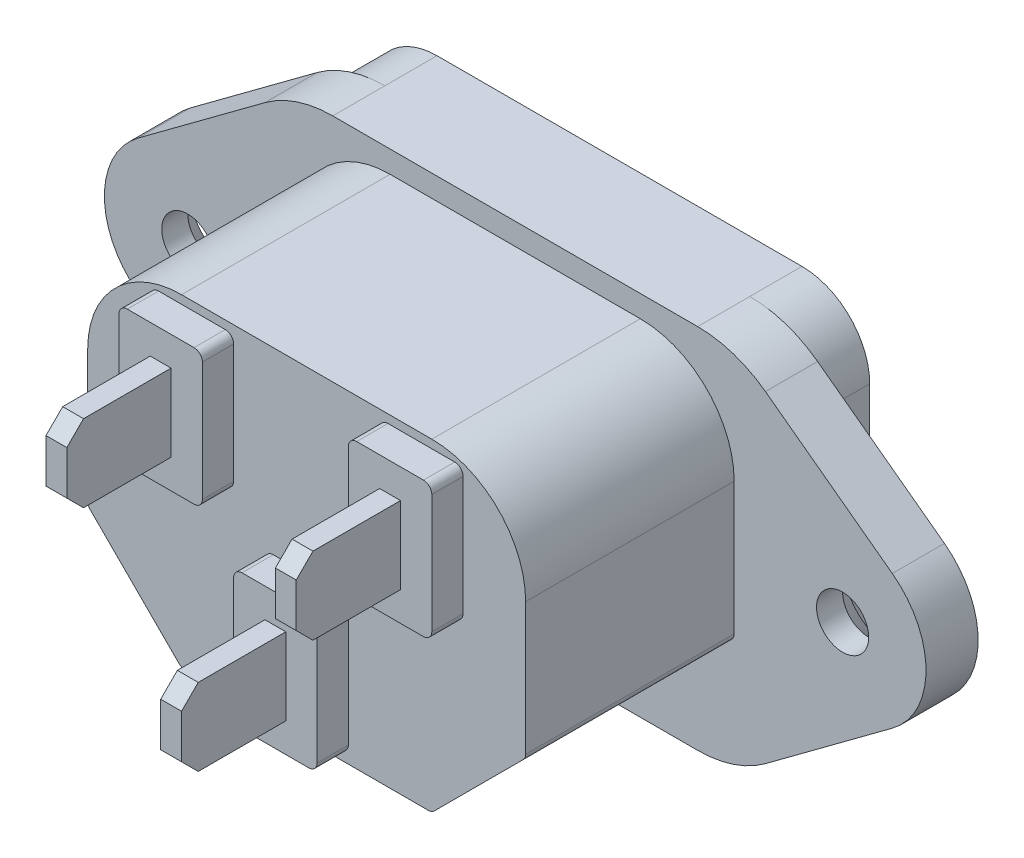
ISO-10303-21;
HEADER;
FILE_DESCRIPTION(('STEP AP214'),'2;1');
FILE_NAME('part.step','',(''),(''),'','','');
FILE_SCHEMA(('AUTOMOTIVE_DESIGN { 1 0 10303 214 1 1 1 1 }'));
ENDSEC;
DATA;
#1=APPLICATION_CONTEXT('core data for automotive mechanical design processes');
#2=APPLICATION_PROTOCOL_DEFINITION('international standard','automotive_design',2000,#1);
#3=PRODUCT_CONTEXT('',#1,'mechanical');
#4=PRODUCT('Part','Part','',(#3));
#5=PRODUCT_RELATED_PRODUCT_CATEGORY('part','',(#4));
#6=PRODUCT_DEFINITION_FORMATION('','',#4);
#7=PRODUCT_DEFINITION_CONTEXT('part definition',#1,'design');
#8=PRODUCT_DEFINITION('design','',#6,#7);
#9=PRODUCT_DEFINITION_SHAPE('','',#8);
#10=(LENGTH_UNIT() NAMED_UNIT(*) SI_UNIT(.MILLI.,.METRE.));
#11=(NAMED_UNIT(*) PLANE_ANGLE_UNIT() SI_UNIT($,.RADIAN.));
#12=(NAMED_UNIT(*) SI_UNIT($,.STERADIAN.) SOLID_ANGLE_UNIT());
#13=UNCERTAINTY_MEASURE_WITH_UNIT(LENGTH_MEASURE(1.E-05),#10,'distance_accuracy_value','');
#14=(GEOMETRIC_REPRESENTATION_CONTEXT(3) GLOBAL_UNCERTAINTY_ASSIGNED_CONTEXT((#13)) GLOBAL_UNIT_ASSIGNED_CONTEXT((#10,
#11,#12)) REPRESENTATION_CONTEXT('',''));
#15=CARTESIAN_POINT('',(0.,0.,0.));
#16=DIRECTION('',(0.,0.,1.));
#17=DIRECTION('',(1.,0.,0.));
#18=AXIS2_PLACEMENT_3D('',#15,#16,#17);
#19=CARTESIAN_POINT('',(-2.54000000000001,-1.07950000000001,17.78));
#20=DIRECTION('',(0.,0.,1.));
#21=DIRECTION('',(1.,0.,0.));
#22=AXIS2_PLACEMENT_3D('',#19,#20,#21);
#23=PLANE('',#22);
#24=DIRECTION('',(0.,-1.,0.));
#25=VECTOR('',#24,1.);
#26=CARTESIAN_POINT('',(-2.54000000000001,-1.07950000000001,17.78));
#27=LINE('',#26,#25);
#28=CARTESIAN_POINT('',(-2.54000000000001,-1.58750000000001,17.78));
#29=VERTEX_POINT('',#28);
#30=CARTESIAN_POINT('',(-2.54000000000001,-8.82650000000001,17.78));
#31=VERTEX_POINT('',#30);
#32=EDGE_CURVE('E881',#29,#31,#27,.T.);
#33=ORIENTED_EDGE('',*,*,#32,.T.);
#34=CARTESIAN_POINT('',(-2.03200000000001,-8.82650000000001,17.78));
#35=DIRECTION('',(0.,0.,1.));
#36=DIRECTION('',(1.,0.,0.));
#37=AXIS2_PLACEMENT_3D('',#34,#35,#36);
#38=CIRCLE('',#37,0.508);
#39=CARTESIAN_POINT('',(-2.03200000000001,-9.33450000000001,17.78));
#40=VERTEX_POINT('',#39);
#41=EDGE_CURVE('E1190',#31,#40,#38,.T.);
#42=ORIENTED_EDGE('',*,*,#41,.T.);
#43=DIRECTION('',(-1.,0.,0.));
#44=VECTOR('',#43,1.);
#45=CARTESIAN_POINT('',(2.53999999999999,-9.33450000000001,17.78));
#46=LINE('',#45,#44);
#47=CARTESIAN_POINT('',(2.03199999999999,-9.33450000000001,17.78));
#48=VERTEX_POINT('',#47);
#49=EDGE_CURVE('E884',#48,#40,#46,.T.);
#50=ORIENTED_EDGE('',*,*,#49,.F.);
#51=CARTESIAN_POINT('',(2.03199999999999,-8.82650000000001,17.78));
#52=DIRECTION('',(0.,0.,1.));
#53=DIRECTION('',(1.,0.,0.));
#54=AXIS2_PLACEMENT_3D('',#51,#52,#53);
#55=CIRCLE('',#54,0.508);
#56=CARTESIAN_POINT('',(2.53999999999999,-8.82650000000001,17.78));
#57=VERTEX_POINT('',#56);
#58=EDGE_CURVE('E1186',#48,#57,#55,.T.);
#59=ORIENTED_EDGE('',*,*,#58,.T.);
#60=DIRECTION('',(0.,1.,0.));
#61=VECTOR('',#60,1.);
#62=CARTESIAN_POINT('',(2.53999999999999,-9.33450000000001,17.78));
#63=LINE('',#62,#61);
#64=CARTESIAN_POINT('',(2.53999999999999,-1.58750000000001,17.78));
#65=VERTEX_POINT('',#64);
#66=EDGE_CURVE('E888',#57,#65,#63,.T.);
#67=ORIENTED_EDGE('',*,*,#66,.T.);
#68=CARTESIAN_POINT('',(2.03199999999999,-1.58750000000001,17.78));
#69=DIRECTION('',(0.,0.,1.));
#70=DIRECTION('',(1.,0.,0.));
#71=AXIS2_PLACEMENT_3D('',#68,#69,#70);
#72=CIRCLE('',#71,0.508);
#73=CARTESIAN_POINT('',(2.03199999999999,-1.07950000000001,17.78));
#74=VERTEX_POINT('',#73);
#75=EDGE_CURVE('E1184',#65,#74,#72,.T.);
#76=ORIENTED_EDGE('',*,*,#75,.T.);
#77=DIRECTION('',(1.,0.,0.));
#78=VECTOR('',#77,1.);
#79=CARTESIAN_POINT('',(-2.54000000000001,-1.07950000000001,17.78));
#80=LINE('',#79,#78);
#81=CARTESIAN_POINT('',(-2.03200000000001,-1.07950000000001,17.78));
#82=VERTEX_POINT('',#81);
#83=EDGE_CURVE('E891',#82,#74,#80,.T.);
#84=ORIENTED_EDGE('',*,*,#83,.F.);
#85=CARTESIAN_POINT('',(-2.03200000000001,-1.58750000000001,17.78));
#86=DIRECTION('',(0.,0.,1.));
#87=DIRECTION('',(1.,0.,0.));
#88=AXIS2_PLACEMENT_3D('',#85,#86,#87);
#89=CIRCLE('',#88,0.508);
#90=EDGE_CURVE('E1188',#82,#29,#89,.T.);
#91=ORIENTED_EDGE('',*,*,#90,.T.);
#92=EDGE_LOOP('',(#33,#42,#50,#59,#67,#76,#84,#91));
#93=FACE_BOUND('',#92,.T.);
#94=DIRECTION('',(-1.,0.,0.));
#95=VECTOR('',#94,1.);
#96=CARTESIAN_POINT('',(0.634999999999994,-7.55650000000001,17.78));
#97=LINE('',#96,#95);
#98=CARTESIAN_POINT('',(0.634999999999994,-7.55650000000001,17.78));
#99=VERTEX_POINT('',#98);
#100=CARTESIAN_POINT('',(-0.635000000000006,-7.55650000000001,17.78));
#101=VERTEX_POINT('',#100);
#102=EDGE_CURVE('E758',#99,#101,#97,.T.);
#103=ORIENTED_EDGE('',*,*,#102,.T.);
#104=DIRECTION('',(0.,-1.,0.));
#105=VECTOR('',#104,1.);
#106=CARTESIAN_POINT('',(-0.635000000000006,-2.85750000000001,17.78));
#107=LINE('',#106,#105);
#108=CARTESIAN_POINT('',(-0.635000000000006,-2.85750000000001,17.78));
#109=VERTEX_POINT('',#108);
#110=EDGE_CURVE('E742',#109,#101,#107,.T.);
#111=ORIENTED_EDGE('',*,*,#110,.F.);
#112=DIRECTION('',(1.,0.,0.));
#113=VECTOR('',#112,1.);
#114=CARTESIAN_POINT('',(-0.635000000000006,-2.85750000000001,17.78));
#115=LINE('',#114,#113);
#116=CARTESIAN_POINT('',(0.634999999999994,-2.85750000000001,17.78));
#117=VERTEX_POINT('',#116);
#118=EDGE_CURVE('E752',#109,#117,#115,.T.);
#119=ORIENTED_EDGE('',*,*,#118,.T.);
#120=DIRECTION('',(0.,1.,0.));
#121=VECTOR('',#120,1.);
#122=CARTESIAN_POINT('',(0.634999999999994,-7.55650000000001,17.78));
#123=LINE('',#122,#121);
#124=EDGE_CURVE('E761',#99,#117,#123,.T.);
#125=ORIENTED_EDGE('',*,*,#124,.F.);
#126=EDGE_LOOP('',(#103,#111,#119,#125));
#127=FACE_BOUND('',#126,.T.);
#128=ADVANCED_FACE('F37',(#93,#127),#23,.T.);
#129=CARTESIAN_POINT('',(-9.525,1.0795,17.78));
#130=DIRECTION('',(0.,0.,-1.));
#131=DIRECTION('',(-1.,0.,0.));
#132=AXIS2_PLACEMENT_3D('',#129,#130,#131);
#133=PLANE('',#132);
#134=DIRECTION('',(0.,-1.,0.));
#135=VECTOR('',#134,1.);
#136=CARTESIAN_POINT('',(-9.525,9.3345,17.78));
#137=LINE('',#136,#135);
#138=CARTESIAN_POINT('',(-9.525,8.8265,17.78));
#139=VERTEX_POINT('',#138);
#140=CARTESIAN_POINT('',(-9.525,1.5875,17.78));
#141=VERTEX_POINT('',#140);
#142=EDGE_CURVE('E929',#139,#141,#137,.T.);
#143=ORIENTED_EDGE('',*,*,#142,.T.);
#144=CARTESIAN_POINT('',(-9.017,1.5875,17.78));
#145=DIRECTION('',(0.,0.,-1.));
#146=DIRECTION('',(-1.,0.,0.));
#147=AXIS2_PLACEMENT_3D('',#144,#145,#146);
#148=CIRCLE('',#147,0.508);
#149=CARTESIAN_POINT('',(-9.017,1.0795,17.78));
#150=VERTEX_POINT('',#149);
#151=EDGE_CURVE('E1246',#141,#150,#148,.F.);
#152=ORIENTED_EDGE('',*,*,#151,.T.);
#153=DIRECTION('',(-1.,0.,0.));
#154=VECTOR('',#153,1.);
#155=CARTESIAN_POINT('',(-4.445,1.0795,17.78));
#156=LINE('',#155,#154);
#157=CARTESIAN_POINT('',(-4.953,1.0795,17.78));
#158=VERTEX_POINT('',#157);
#159=EDGE_CURVE('E932',#158,#150,#156,.T.);
#160=ORIENTED_EDGE('',*,*,#159,.F.);
#161=CARTESIAN_POINT('',(-4.953,1.5875,17.78));
#162=DIRECTION('',(0.,0.,-1.));
#163=DIRECTION('',(-1.,0.,0.));
#164=AXIS2_PLACEMENT_3D('',#161,#162,#163);
#165=CIRCLE('',#164,0.508);
#166=CARTESIAN_POINT('',(-4.445,1.5875,17.78));
#167=VERTEX_POINT('',#166);
#168=EDGE_CURVE('E1242',#158,#167,#165,.F.);
#169=ORIENTED_EDGE('',*,*,#168,.T.);
#170=DIRECTION('',(0.,1.,0.));
#171=VECTOR('',#170,1.);
#172=CARTESIAN_POINT('',(-4.445,1.0795,17.78));
#173=LINE('',#172,#171);
#174=CARTESIAN_POINT('',(-4.445,8.8265,17.78));
#175=VERTEX_POINT('',#174);
#176=EDGE_CURVE('E936',#167,#175,#173,.T.);
#177=ORIENTED_EDGE('',*,*,#176,.T.);
#178=CARTESIAN_POINT('',(-4.953,8.8265,17.78));
#179=DIRECTION('',(0.,0.,-1.));
#180=DIRECTION('',(-1.,0.,0.));
#181=AXIS2_PLACEMENT_3D('',#178,#179,#180);
#182=CIRCLE('',#181,0.508);
#183=CARTESIAN_POINT('',(-4.953,9.33449999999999,17.78));
#184=VERTEX_POINT('',#183);
#185=EDGE_CURVE('E1240',#175,#184,#182,.F.);
#186=ORIENTED_EDGE('',*,*,#185,.T.);
#187=DIRECTION('',(1.,0.,0.));
#188=VECTOR('',#187,1.);
#189=CARTESIAN_POINT('',(-9.525,9.3345,17.78));
#190=LINE('',#189,#188);
#191=CARTESIAN_POINT('',(-9.017,9.3345,17.78));
#192=VERTEX_POINT('',#191);
#193=EDGE_CURVE('E939',#192,#184,#190,.T.);
#194=ORIENTED_EDGE('',*,*,#193,.F.);
#195=CARTESIAN_POINT('',(-9.017,8.8265,17.78));
#196=DIRECTION('',(0.,0.,-1.));
#197=DIRECTION('',(-1.,0.,0.));
#198=AXIS2_PLACEMENT_3D('',#195,#196,#197);
#199=CIRCLE('',#198,0.508);
#200=EDGE_CURVE('E1244',#192,#139,#199,.F.);
#201=ORIENTED_EDGE('',*,*,#200,.T.);
#202=EDGE_LOOP('',(#143,#152,#160,#169,#177,#186,#194,#201));
#203=FACE_BOUND('',#202,.T.);
#204=DIRECTION('',(0.,-1.,0.));
#205=VECTOR('',#204,1.);
#206=CARTESIAN_POINT('',(-7.62,7.5565,17.78));
#207=LINE('',#206,#205);
#208=CARTESIAN_POINT('',(-7.62,7.5565,17.78));
#209=VERTEX_POINT('',#208);
#210=CARTESIAN_POINT('',(-7.62,2.8575,17.78));
#211=VERTEX_POINT('',#210);
#212=EDGE_CURVE('E773',#209,#211,#207,.T.);
#213=ORIENTED_EDGE('',*,*,#212,.F.);
#214=DIRECTION('',(1.,0.,0.));
#215=VECTOR('',#214,1.);
#216=CARTESIAN_POINT('',(-7.62,7.5565,17.78));
#217=LINE('',#216,#215);
#218=CARTESIAN_POINT('',(-6.35,7.5565,17.78));
#219=VERTEX_POINT('',#218);
#220=EDGE_CURVE('E778',#209,#219,#217,.T.);
#221=ORIENTED_EDGE('',*,*,#220,.T.);
#222=DIRECTION('',(0.,1.,0.));
#223=VECTOR('',#222,1.);
#224=CARTESIAN_POINT('',(-6.35,2.8575,17.78));
#225=LINE('',#224,#223);
#226=CARTESIAN_POINT('',(-6.35,2.8575,17.78));
#227=VERTEX_POINT('',#226);
#228=EDGE_CURVE('E787',#227,#219,#225,.T.);
#229=ORIENTED_EDGE('',*,*,#228,.F.);
#230=DIRECTION('',(-1.,0.,0.));
#231=VECTOR('',#230,1.);
#232=CARTESIAN_POINT('',(-6.35,2.8575,17.78));
#233=LINE('',#232,#231);
#234=EDGE_CURVE('E784',#227,#211,#233,.T.);
#235=ORIENTED_EDGE('',*,*,#234,.T.);
#236=EDGE_LOOP('',(#213,#221,#229,#235));
#237=FACE_BOUND('',#236,.T.);
#238=ADVANCED_FACE('F1524',(#203,#237),#133,.F.);
#239=CARTESIAN_POINT('',(4.44499999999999,1.0795,17.78));
#240=DIRECTION('',(0.,0.,-1.));
#241=DIRECTION('',(-1.,0.,0.));
#242=AXIS2_PLACEMENT_3D('',#239,#240,#241);
#243=PLANE('',#242);
#244=DIRECTION('',(0.,-1.,0.));
#245=VECTOR('',#244,1.);
#246=CARTESIAN_POINT('',(4.445,9.3345,17.78));
#247=LINE('',#246,#245);
#248=CARTESIAN_POINT('',(4.445,8.8265,17.78));
#249=VERTEX_POINT('',#248);
#250=CARTESIAN_POINT('',(4.44499999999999,1.5875,17.78));
#251=VERTEX_POINT('',#250);
#252=EDGE_CURVE('E905',#249,#251,#247,.T.);
#253=ORIENTED_EDGE('',*,*,#252,.T.);
#254=CARTESIAN_POINT('',(4.953,1.5875,17.78));
#255=DIRECTION('',(0.,0.,-1.));
#256=DIRECTION('',(-1.,0.,0.));
#257=AXIS2_PLACEMENT_3D('',#254,#255,#256);
#258=CIRCLE('',#257,0.508);
#259=CARTESIAN_POINT('',(4.953,1.0795,17.78));
#260=VERTEX_POINT('',#259);
#261=EDGE_CURVE('E1218',#251,#260,#258,.F.);
#262=ORIENTED_EDGE('',*,*,#261,.T.);
#263=DIRECTION('',(-1.,0.,0.));
#264=VECTOR('',#263,1.);
#265=CARTESIAN_POINT('',(9.525,1.0795,17.78));
#266=LINE('',#265,#264);
#267=CARTESIAN_POINT('',(9.017,1.0795,17.78));
#268=VERTEX_POINT('',#267);
#269=EDGE_CURVE('E908',#268,#260,#266,.T.);
#270=ORIENTED_EDGE('',*,*,#269,.F.);
#271=CARTESIAN_POINT('',(9.017,1.5875,17.78));
#272=DIRECTION('',(0.,0.,-1.));
#273=DIRECTION('',(-1.,0.,0.));
#274=AXIS2_PLACEMENT_3D('',#271,#272,#273);
#275=CIRCLE('',#274,0.508);
#276=CARTESIAN_POINT('',(9.525,1.5875,17.78));
#277=VERTEX_POINT('',#276);
#278=EDGE_CURVE('E1214',#268,#277,#275,.F.);
#279=ORIENTED_EDGE('',*,*,#278,.T.);
#280=DIRECTION('',(0.,1.,0.));
#281=VECTOR('',#280,1.);
#282=CARTESIAN_POINT('',(9.525,1.0795,17.78));
#283=LINE('',#282,#281);
#284=CARTESIAN_POINT('',(9.525,8.8265,17.78));
#285=VERTEX_POINT('',#284);
#286=EDGE_CURVE('E912',#277,#285,#283,.T.);
#287=ORIENTED_EDGE('',*,*,#286,.T.);
#288=CARTESIAN_POINT('',(9.01699999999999,8.8265,17.78));
#289=DIRECTION('',(0.,0.,-1.));
#290=DIRECTION('',(-1.,0.,0.));
#291=AXIS2_PLACEMENT_3D('',#288,#289,#290);
#292=CIRCLE('',#291,0.508);
#293=CARTESIAN_POINT('',(9.01699999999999,9.3345,17.78));
#294=VERTEX_POINT('',#293);
#295=EDGE_CURVE('E1212',#285,#294,#292,.F.);
#296=ORIENTED_EDGE('',*,*,#295,.T.);
#297=DIRECTION('',(1.,0.,0.));
#298=VECTOR('',#297,1.);
#299=CARTESIAN_POINT('',(4.445,9.3345,17.78));
#300=LINE('',#299,#298);
#301=CARTESIAN_POINT('',(4.953,9.3345,17.78));
#302=VERTEX_POINT('',#301);
#303=EDGE_CURVE('E915',#302,#294,#300,.T.);
#304=ORIENTED_EDGE('',*,*,#303,.F.);
#305=CARTESIAN_POINT('',(4.953,8.8265,17.78));
#306=DIRECTION('',(0.,0.,-1.));
#307=DIRECTION('',(-1.,0.,0.));
#308=AXIS2_PLACEMENT_3D('',#305,#306,#307);
#309=CIRCLE('',#308,0.508);
#310=EDGE_CURVE('E1216',#302,#249,#309,.F.);
#311=ORIENTED_EDGE('',*,*,#310,.T.);
#312=EDGE_LOOP('',(#253,#262,#270,#279,#287,#296,#304,#311));
#313=FACE_BOUND('',#312,.T.);
#314=DIRECTION('',(0.,-1.,0.));
#315=VECTOR('',#314,1.);
#316=CARTESIAN_POINT('',(6.35,7.5565,17.78));
#317=LINE('',#316,#315);
#318=CARTESIAN_POINT('',(6.35,7.5565,17.78));
#319=VERTEX_POINT('',#318);
#320=CARTESIAN_POINT('',(6.35,2.8575,17.78));
#321=VERTEX_POINT('',#320);
#322=EDGE_CURVE('E799',#319,#321,#317,.T.);
#323=ORIENTED_EDGE('',*,*,#322,.F.);
#324=DIRECTION('',(1.,0.,0.));
#325=VECTOR('',#324,1.);
#326=CARTESIAN_POINT('',(6.35,7.5565,17.78));
#327=LINE('',#326,#325);
#328=CARTESIAN_POINT('',(7.61999999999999,7.5565,17.78));
#329=VERTEX_POINT('',#328);
#330=EDGE_CURVE('E804',#319,#329,#327,.T.);
#331=ORIENTED_EDGE('',*,*,#330,.T.);
#332=DIRECTION('',(0.,1.,0.));
#333=VECTOR('',#332,1.);
#334=CARTESIAN_POINT('',(7.61999999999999,2.8575,17.78));
#335=LINE('',#334,#333);
#336=CARTESIAN_POINT('',(7.61999999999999,2.8575,17.78));
#337=VERTEX_POINT('',#336);
#338=EDGE_CURVE('E813',#337,#329,#335,.T.);
#339=ORIENTED_EDGE('',*,*,#338,.F.);
#340=DIRECTION('',(-1.,0.,0.));
#341=VECTOR('',#340,1.);
#342=CARTESIAN_POINT('',(7.61999999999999,2.8575,17.78));
#343=LINE('',#342,#341);
#344=EDGE_CURVE('E810',#337,#321,#343,.T.);
#345=ORIENTED_EDGE('',*,*,#344,.T.);
#346=EDGE_LOOP('',(#323,#331,#339,#345));
#347=FACE_BOUND('',#346,.T.);
#348=ADVANCED_FACE('F1530',(#313,#347),#243,.F.);
#349=CARTESIAN_POINT('',(-7.62000000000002,4.12750000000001,15.875));
#350=DIRECTION('',(0.,0.,1.));
#351=DIRECTION('',(1.,0.,0.));
#352=AXIS2_PLACEMENT_3D('',#349,#350,#351);
#353=PLANE('',#352);
#354=DIRECTION('',(0.,1.,0.));
#355=VECTOR('',#354,1.);
#356=CARTESIAN_POINT('',(9.525,1.0795,15.875));
#357=LINE('',#356,#355);
#358=CARTESIAN_POINT('',(9.525,1.5875,15.875));
#359=VERTEX_POINT('',#358);
#360=CARTESIAN_POINT('',(9.525,8.8265,15.875));
#361=VERTEX_POINT('',#360);
#362=EDGE_CURVE('E924',#359,#361,#357,.T.);
#363=ORIENTED_EDGE('',*,*,#362,.F.);
#364=CARTESIAN_POINT('',(9.017,1.5875,15.875));
#365=DIRECTION('',(0.,0.,1.));
#366=DIRECTION('',(1.,0.,0.));
#367=AXIS2_PLACEMENT_3D('',#364,#365,#366);
#368=CIRCLE('',#367,0.508);
#369=CARTESIAN_POINT('',(9.017,1.0795,15.875));
#370=VERTEX_POINT('',#369);
#371=EDGE_CURVE('E1270',#359,#370,#368,.F.);
#372=ORIENTED_EDGE('',*,*,#371,.T.);
#373=DIRECTION('',(-1.,0.,0.));
#374=VECTOR('',#373,1.);
#375=CARTESIAN_POINT('',(9.525,1.0795,15.875));
#376=LINE('',#375,#374);
#377=CARTESIAN_POINT('',(4.953,1.0795,15.875));
#378=VERTEX_POINT('',#377);
#379=EDGE_CURVE('E921',#370,#378,#376,.T.);
#380=ORIENTED_EDGE('',*,*,#379,.T.);
#381=CARTESIAN_POINT('',(4.953,1.5875,15.875));
#382=DIRECTION('',(0.,0.,1.));
#383=DIRECTION('',(1.,0.,0.));
#384=AXIS2_PLACEMENT_3D('',#381,#382,#383);
#385=CIRCLE('',#384,0.508);
#386=CARTESIAN_POINT('',(4.44499999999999,1.5875,15.875));
#387=VERTEX_POINT('',#386);
#388=EDGE_CURVE('E1266',#378,#387,#385,.F.);
#389=ORIENTED_EDGE('',*,*,#388,.T.);
#390=DIRECTION('',(0.,-1.,0.));
#391=VECTOR('',#390,1.);
#392=CARTESIAN_POINT('',(4.445,9.3345,15.875));
#393=LINE('',#392,#391);
#394=CARTESIAN_POINT('',(4.445,8.8265,15.875));
#395=VERTEX_POINT('',#394);
#396=EDGE_CURVE('E894',#395,#387,#393,.T.);
#397=ORIENTED_EDGE('',*,*,#396,.F.);
#398=CARTESIAN_POINT('',(4.953,8.8265,15.875));
#399=DIRECTION('',(0.,0.,1.));
#400=DIRECTION('',(1.,0.,0.));
#401=AXIS2_PLACEMENT_3D('',#398,#399,#400);
#402=CIRCLE('',#401,0.508);
#403=CARTESIAN_POINT('',(4.953,9.3345,15.875));
#404=VERTEX_POINT('',#403);
#405=EDGE_CURVE('E1268',#395,#404,#402,.F.);
#406=ORIENTED_EDGE('',*,*,#405,.T.);
#407=DIRECTION('',(1.,0.,0.));
#408=VECTOR('',#407,1.);
#409=CARTESIAN_POINT('',(4.445,9.3345,15.875));
#410=LINE('',#409,#408);
#411=CARTESIAN_POINT('',(9.01699999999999,9.3345,15.875));
#412=VERTEX_POINT('',#411);
#413=EDGE_CURVE('E909',#404,#412,#410,.T.);
#414=ORIENTED_EDGE('',*,*,#413,.T.);
#415=CARTESIAN_POINT('',(9.01699999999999,8.8265,15.875));
#416=DIRECTION('',(0.,0.,1.));
#417=DIRECTION('',(1.,0.,0.));
#418=AXIS2_PLACEMENT_3D('',#415,#416,#417);
#419=CIRCLE('',#418,0.508);
#420=EDGE_CURVE('E1272',#412,#361,#419,.F.);
#421=ORIENTED_EDGE('',*,*,#420,.T.);
#422=EDGE_LOOP('',(#363,#372,#380,#389,#397,#406,#414,#421));
#423=FACE_BOUND('',#422,.T.);
#424=DIRECTION('',(0.707106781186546,0.707106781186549,0.));
#425=VECTOR('',#424,1.);
#426=CARTESIAN_POINT('',(7.62000000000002,-9.84250000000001,15.875));
#427=LINE('',#426,#425);
#428=CARTESIAN_POINT('',(7.76878975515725,-9.69371024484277,15.875));
#429=VERTEX_POINT('',#428);
#430=CARTESIAN_POINT('',(13.1862102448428,-4.27628975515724,15.875));
#431=VERTEX_POINT('',#430);
#432=EDGE_CURVE('E966',#429,#431,#427,.T.);
#433=ORIENTED_EDGE('',*,*,#432,.T.);
#434=CARTESIAN_POINT('',(12.827,-3.91707951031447,15.875));
#435=DIRECTION('',(0.,0.,1.));
#436=DIRECTION('',(1.,0.,0.));
#437=AXIS2_PLACEMENT_3D('',#434,#435,#436);
#438=CIRCLE('',#437,0.508);
#439=CARTESIAN_POINT('',(13.335,-3.91707951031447,15.875));
#440=VERTEX_POINT('',#439);
#441=EDGE_CURVE('E1296',#431,#440,#438,.T.);
#442=ORIENTED_EDGE('',*,*,#441,.T.);
#443=DIRECTION('',(0.,-1.,0.));
#444=VECTOR('',#443,1.);
#445=CARTESIAN_POINT('',(13.335,4.12750000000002,15.875));
#446=LINE('',#445,#444);
#447=CARTESIAN_POINT('',(13.335,4.12750000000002,15.875));
#448=VERTEX_POINT('',#447);
#449=EDGE_CURVE('E969',#448,#440,#446,.T.);
#450=ORIENTED_EDGE('',*,*,#449,.F.);
#451=CARTESIAN_POINT('',(7.62000000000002,4.12750000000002,15.875));
#452=DIRECTION('',(0.,0.,-1.));
#453=DIRECTION('',(-1.,0.,0.));
#454=AXIS2_PLACEMENT_3D('',#451,#452,#453);
#455=CIRCLE('',#454,5.71499999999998);
#456=CARTESIAN_POINT('',(7.62000000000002,9.8425,15.875));
#457=VERTEX_POINT('',#456);
#458=EDGE_CURVE('E972',#457,#448,#455,.T.);
#459=ORIENTED_EDGE('',*,*,#458,.F.);
#460=DIRECTION('',(1.,0.,0.));
#461=VECTOR('',#460,1.);
#462=CARTESIAN_POINT('',(-7.62000000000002,9.8425,15.875));
#463=LINE('',#462,#461);
#464=CARTESIAN_POINT('',(-7.62000000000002,9.8425,15.875));
#465=VERTEX_POINT('',#464);
#466=EDGE_CURVE('E975',#465,#457,#463,.T.);
#467=ORIENTED_EDGE('',*,*,#466,.F.);
#468=CARTESIAN_POINT('',(-7.62000000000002,4.12750000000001,15.875));
#469=DIRECTION('',(0.,0.,1.));
#470=DIRECTION('',(1.,0.,0.));
#471=AXIS2_PLACEMENT_3D('',#468,#469,#470);
#472=CIRCLE('',#471,5.71499999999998);
#473=CARTESIAN_POINT('',(-13.335,4.12750000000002,15.875));
#474=VERTEX_POINT('',#473);
#475=EDGE_CURVE('E953',#465,#474,#472,.T.);
#476=ORIENTED_EDGE('',*,*,#475,.T.);
#477=DIRECTION('',(0.,-1.,0.));
#478=VECTOR('',#477,1.);
#479=CARTESIAN_POINT('',(-13.335,4.12750000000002,15.875));
#480=LINE('',#479,#478);
#481=CARTESIAN_POINT('',(-13.335,-3.91707951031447,15.875));
#482=VERTEX_POINT('',#481);
#483=EDGE_CURVE('E956',#474,#482,#480,.T.);
#484=ORIENTED_EDGE('',*,*,#483,.T.);
#485=CARTESIAN_POINT('',(-12.827,-3.91707951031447,15.875));
#486=DIRECTION('',(0.,0.,1.));
#487=DIRECTION('',(1.,0.,0.));
#488=AXIS2_PLACEMENT_3D('',#485,#486,#487);
#489=CIRCLE('',#488,0.508);
#490=CARTESIAN_POINT('',(-13.1862102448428,-4.27628975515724,15.875));
#491=VERTEX_POINT('',#490);
#492=EDGE_CURVE('E1290',#482,#491,#489,.T.);
#493=ORIENTED_EDGE('',*,*,#492,.T.);
#494=DIRECTION('',(-0.707106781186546,0.707106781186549,0.));
#495=VECTOR('',#494,1.);
#496=CARTESIAN_POINT('',(-7.62000000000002,-9.84250000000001,15.875));
#497=LINE('',#496,#495);
#498=CARTESIAN_POINT('',(-7.76878975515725,-9.69371024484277,15.875));
#499=VERTEX_POINT('',#498);
#500=EDGE_CURVE('E960',#499,#491,#497,.T.);
#501=ORIENTED_EDGE('',*,*,#500,.F.);
#502=CARTESIAN_POINT('',(-7.40957951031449,-9.33450000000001,15.875));
#503=DIRECTION('',(0.,0.,1.));
#504=DIRECTION('',(1.,0.,0.));
#505=AXIS2_PLACEMENT_3D('',#502,#503,#504);
#506=CIRCLE('',#505,0.508);
#507=CARTESIAN_POINT('',(-7.40957951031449,-9.84250000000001,15.875));
#508=VERTEX_POINT('',#507);
#509=EDGE_CURVE('E1292',#499,#508,#506,.T.);
#510=ORIENTED_EDGE('',*,*,#509,.T.);
#511=DIRECTION('',(1.,0.,0.));
#512=VECTOR('',#511,1.);
#513=CARTESIAN_POINT('',(-7.62000000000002,-9.84250000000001,15.875));
#514=LINE('',#513,#512);
#515=CARTESIAN_POINT('',(7.40957951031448,-9.84250000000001,15.875));
#516=VERTEX_POINT('',#515);
#517=EDGE_CURVE('E963',#508,#516,#514,.T.);
#518=ORIENTED_EDGE('',*,*,#517,.T.);
#519=CARTESIAN_POINT('',(7.40957951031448,-9.33450000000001,15.875));
#520=DIRECTION('',(0.,0.,1.));
#521=DIRECTION('',(1.,0.,0.));
#522=AXIS2_PLACEMENT_3D('',#519,#520,#521);
#523=CIRCLE('',#522,0.508);
#524=EDGE_CURVE('E1294',#516,#429,#523,.T.);
#525=ORIENTED_EDGE('',*,*,#524,.T.);
#526=EDGE_LOOP('',(#433,#442,#450,#459,#467,#476,#484,#493,#501,#510,#518,#525));
#527=FACE_BOUND('',#526,.T.);
#528=DIRECTION('',(0.,1.,0.));
#529=VECTOR('',#528,1.);
#530=CARTESIAN_POINT('',(-4.445,1.0795,15.875));
#531=LINE('',#530,#529);
#532=CARTESIAN_POINT('',(-4.445,1.5875,15.875));
#533=VERTEX_POINT('',#532);
#534=CARTESIAN_POINT('',(-4.445,8.8265,15.875));
#535=VERTEX_POINT('',#534);
#536=EDGE_CURVE('E948',#533,#535,#531,.T.);
#537=ORIENTED_EDGE('',*,*,#536,.F.);
#538=CARTESIAN_POINT('',(-4.953,1.5875,15.875));
#539=DIRECTION('',(0.,0.,1.));
#540=DIRECTION('',(1.,0.,0.));
#541=AXIS2_PLACEMENT_3D('',#538,#539,#540);
#542=CIRCLE('',#541,0.508);
#543=CARTESIAN_POINT('',(-4.953,1.0795,15.875));
#544=VERTEX_POINT('',#543);
#545=EDGE_CURVE('E1278',#533,#544,#542,.F.);
#546=ORIENTED_EDGE('',*,*,#545,.T.);
#547=DIRECTION('',(-1.,0.,0.));
#548=VECTOR('',#547,1.);
#549=CARTESIAN_POINT('',(-4.445,1.0795,15.875));
#550=LINE('',#549,#548);
#551=CARTESIAN_POINT('',(-9.017,1.0795,15.875));
#552=VERTEX_POINT('',#551);
#553=EDGE_CURVE('E945',#544,#552,#550,.T.);
#554=ORIENTED_EDGE('',*,*,#553,.T.);
#555=CARTESIAN_POINT('',(-9.017,1.5875,15.875));
#556=DIRECTION('',(0.,0.,1.));
#557=DIRECTION('',(1.,0.,0.));
#558=AXIS2_PLACEMENT_3D('',#555,#556,#557);
#559=CIRCLE('',#558,0.508);
#560=CARTESIAN_POINT('',(-9.525,1.5875,15.875));
#561=VERTEX_POINT('',#560);
#562=EDGE_CURVE('E1274',#552,#561,#559,.F.);
#563=ORIENTED_EDGE('',*,*,#562,.T.);
#564=DIRECTION('',(0.,-1.,0.));
#565=VECTOR('',#564,1.);
#566=CARTESIAN_POINT('',(-9.525,9.3345,15.875));
#567=LINE('',#566,#565);
#568=CARTESIAN_POINT('',(-9.525,8.8265,15.875));
#569=VERTEX_POINT('',#568);
#570=EDGE_CURVE('E918',#569,#561,#567,.T.);
#571=ORIENTED_EDGE('',*,*,#570,.F.);
#572=CARTESIAN_POINT('',(-9.017,8.8265,15.875));
#573=DIRECTION('',(0.,0.,1.));
#574=DIRECTION('',(1.,0.,0.));
#575=AXIS2_PLACEMENT_3D('',#572,#573,#574);
#576=CIRCLE('',#575,0.508);
#577=CARTESIAN_POINT('',(-9.017,9.3345,15.875));
#578=VERTEX_POINT('',#577);
#579=EDGE_CURVE('E1276',#569,#578,#576,.F.);
#580=ORIENTED_EDGE('',*,*,#579,.T.);
#581=DIRECTION('',(1.,0.,0.));
#582=VECTOR('',#581,1.);
#583=CARTESIAN_POINT('',(-9.525,9.3345,15.875));
#584=LINE('',#583,#582);
#585=CARTESIAN_POINT('',(-4.953,9.33449999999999,15.875));
#586=VERTEX_POINT('',#585);
#587=EDGE_CURVE('E933',#578,#586,#584,.T.);
#588=ORIENTED_EDGE('',*,*,#587,.T.);
#589=CARTESIAN_POINT('',(-4.953,8.8265,15.875));
#590=DIRECTION('',(0.,0.,1.));
#591=DIRECTION('',(1.,0.,0.));
#592=AXIS2_PLACEMENT_3D('',#589,#590,#591);
#593=CIRCLE('',#592,0.508);
#594=EDGE_CURVE('E1280',#586,#535,#593,.F.);
#595=ORIENTED_EDGE('',*,*,#594,.T.);
#596=EDGE_LOOP('',(#537,#546,#554,#563,#571,#580,#588,#595));
#597=FACE_BOUND('',#596,.T.);
#598=DIRECTION('',(0.,1.,0.));
#599=VECTOR('',#598,1.);
#600=CARTESIAN_POINT('',(2.53999999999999,-9.33450000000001,15.875));
#601=LINE('',#600,#599);
#602=CARTESIAN_POINT('',(2.53999999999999,-8.82650000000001,15.875));
#603=VERTEX_POINT('',#602);
#604=CARTESIAN_POINT('',(2.53999999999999,-1.58750000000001,15.875));
#605=VERTEX_POINT('',#604);
#606=EDGE_CURVE('E900',#603,#605,#601,.T.);
#607=ORIENTED_EDGE('',*,*,#606,.F.);
#608=CARTESIAN_POINT('',(2.03199999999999,-8.82650000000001,15.875));
#609=DIRECTION('',(0.,0.,1.));
#610=DIRECTION('',(1.,0.,0.));
#611=AXIS2_PLACEMENT_3D('',#608,#609,#610);
#612=CIRCLE('',#611,0.508);
#613=CARTESIAN_POINT('',(2.03199999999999,-9.33450000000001,15.875));
#614=VERTEX_POINT('',#613);
#615=EDGE_CURVE('E1262',#603,#614,#612,.F.);
#616=ORIENTED_EDGE('',*,*,#615,.T.);
#617=DIRECTION('',(-1.,0.,0.));
#618=VECTOR('',#617,1.);
#619=CARTESIAN_POINT('',(2.53999999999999,-9.33450000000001,15.875));
#620=LINE('',#619,#618);
#621=CARTESIAN_POINT('',(-2.03200000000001,-9.33450000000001,15.875));
#622=VERTEX_POINT('',#621);
#623=EDGE_CURVE('E897',#614,#622,#620,.T.);
#624=ORIENTED_EDGE('',*,*,#623,.T.);
#625=CARTESIAN_POINT('',(-2.03200000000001,-8.82650000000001,15.875));
#626=DIRECTION('',(0.,0.,1.));
#627=DIRECTION('',(1.,0.,0.));
#628=AXIS2_PLACEMENT_3D('',#625,#626,#627);
#629=CIRCLE('',#628,0.508);
#630=CARTESIAN_POINT('',(-2.54000000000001,-8.82650000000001,15.875));
#631=VERTEX_POINT('',#630);
#632=EDGE_CURVE('E1258',#622,#631,#629,.F.);
#633=ORIENTED_EDGE('',*,*,#632,.T.);
#634=DIRECTION('',(0.,-1.,0.));
#635=VECTOR('',#634,1.);
#636=CARTESIAN_POINT('',(-2.54000000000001,-1.07950000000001,15.875));
#637=LINE('',#636,#635);
#638=CARTESIAN_POINT('',(-2.54000000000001,-1.58750000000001,15.875));
#639=VERTEX_POINT('',#638);
#640=EDGE_CURVE('E874',#639,#631,#637,.T.);
#641=ORIENTED_EDGE('',*,*,#640,.F.);
#642=CARTESIAN_POINT('',(-2.03200000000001,-1.58750000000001,15.875));
#643=DIRECTION('',(0.,0.,1.));
#644=DIRECTION('',(1.,0.,0.));
#645=AXIS2_PLACEMENT_3D('',#642,#643,#644);
#646=CIRCLE('',#645,0.508);
#647=CARTESIAN_POINT('',(-2.03200000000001,-1.07950000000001,15.875));
#648=VERTEX_POINT('',#647);
#649=EDGE_CURVE('E1260',#639,#648,#646,.F.);
#650=ORIENTED_EDGE('',*,*,#649,.T.);
#651=DIRECTION('',(1.,0.,0.));
#652=VECTOR('',#651,1.);
#653=CARTESIAN_POINT('',(-2.54000000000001,-1.07950000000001,15.875));
#654=LINE('',#653,#652);
#655=CARTESIAN_POINT('',(2.03199999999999,-1.07950000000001,15.875));
#656=VERTEX_POINT('',#655);
#657=EDGE_CURVE('E885',#648,#656,#654,.T.);
#658=ORIENTED_EDGE('',*,*,#657,.T.);
#659=CARTESIAN_POINT('',(2.03199999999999,-1.58750000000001,15.875));
#660=DIRECTION('',(0.,0.,1.));
#661=DIRECTION('',(1.,0.,0.));
#662=AXIS2_PLACEMENT_3D('',#659,#660,#661);
#663=CIRCLE('',#662,0.508);
#664=EDGE_CURVE('E1264',#656,#605,#663,.F.);
#665=ORIENTED_EDGE('',*,*,#664,.T.);
#666=EDGE_LOOP('',(#607,#616,#624,#633,#641,#650,#658,#665));
#667=FACE_BOUND('',#666,.T.);
#668=ADVANCED_FACE('F1558',(#423,#527,#597,#667),#353,.T.);
#669=CARTESIAN_POINT('',(-11.1125,4.24900198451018,3.175));
#670=DIRECTION('',(0.,0.,1.));
#671=DIRECTION('',(1.,0.,0.));
#672=AXIS2_PLACEMENT_3D('',#669,#670,#671);
#673=PLANE('',#672);
#674=CARTESIAN_POINT('',(-11.1125,4.24900198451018,3.175));
#675=DIRECTION('',(0.,0.,1.));
#676=DIRECTION('',(1.,0.,0.));
#677=AXIS2_PLACEMENT_3D('',#674,#675,#676);
#678=CIRCLE('',#677,6.92699801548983);
#679=CARTESIAN_POINT('',(-11.1125,11.176,3.175));
#680=VERTEX_POINT('',#679);
#681=CARTESIAN_POINT('',(-15.24,9.81200883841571,3.175));
#682=VERTEX_POINT('',#681);
#683=EDGE_CURVE('E1077',#680,#682,#678,.T.);
#684=ORIENTED_EDGE('',*,*,#683,.T.);
#685=DIRECTION('',(-0.803090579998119,-0.595856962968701,0.));
#686=VECTOR('',#685,1.);
#687=CARTESIAN_POINT('',(-15.24,9.81200883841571,3.175));
#688=LINE('',#687,#686);
#689=CARTESIAN_POINT('',(-22.965953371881,4.07970014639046,3.175));
#690=VERTEX_POINT('',#689);
#691=EDGE_CURVE('E1080',#682,#690,#688,.T.);
#692=ORIENTED_EDGE('',*,*,#691,.T.);
#693=CARTESIAN_POINT('',(-19.939,0.,3.175));
#694=DIRECTION('',(0.,0.,1.));
#695=DIRECTION('',(1.,0.,0.));
#696=AXIS2_PLACEMENT_3D('',#693,#694,#695);
#697=CIRCLE('',#696,5.08000000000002);
#698=CARTESIAN_POINT('',(-22.965953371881,-4.07970014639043,3.175));
#699=VERTEX_POINT('',#698);
#700=EDGE_CURVE('E1083',#690,#699,#697,.T.);
#701=ORIENTED_EDGE('',*,*,#700,.T.);
#702=DIRECTION('',(-0.803090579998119,0.595856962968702,0.));
#703=VECTOR('',#702,1.);
#704=CARTESIAN_POINT('',(-15.24,-9.81200883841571,3.175));
#705=LINE('',#704,#703);
#706=CARTESIAN_POINT('',(-15.24,-9.81200883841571,3.175));
#707=VERTEX_POINT('',#706);
#708=EDGE_CURVE('E1085',#707,#699,#705,.T.);
#709=ORIENTED_EDGE('',*,*,#708,.F.);
#710=CARTESIAN_POINT('',(-11.1125,-4.24900198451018,3.175));
#711=DIRECTION('',(0.,0.,1.));
#712=DIRECTION('',(1.,0.,0.));
#713=AXIS2_PLACEMENT_3D('',#710,#711,#712);
#714=CIRCLE('',#713,6.92699801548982);
#715=CARTESIAN_POINT('',(-11.1125,-11.176,3.175));
#716=VERTEX_POINT('',#715);
#717=EDGE_CURVE('E1088',#707,#716,#714,.T.);
#718=ORIENTED_EDGE('',*,*,#717,.T.);
#719=DIRECTION('',(-1.,0.,0.));
#720=VECTOR('',#719,1.);
#721=CARTESIAN_POINT('',(11.1125,-11.176,3.175));
#722=LINE('',#721,#720);
#723=CARTESIAN_POINT('',(11.1125,-11.176,3.175));
#724=VERTEX_POINT('',#723);
#725=EDGE_CURVE('E1090',#724,#716,#722,.T.);
#726=ORIENTED_EDGE('',*,*,#725,.F.);
#727=CARTESIAN_POINT('',(11.1125,-4.24900198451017,3.175));
#728=DIRECTION('',(0.,0.,1.));
#729=DIRECTION('',(1.,0.,0.));
#730=AXIS2_PLACEMENT_3D('',#727,#728,#729);
#731=CIRCLE('',#730,6.92699801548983);
#732=CARTESIAN_POINT('',(15.24,-9.81200883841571,3.175));
#733=VERTEX_POINT('',#732);
#734=EDGE_CURVE('E1093',#724,#733,#731,.T.);
#735=ORIENTED_EDGE('',*,*,#734,.T.);
#736=DIRECTION('',(0.803090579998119,0.595856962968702,0.));
#737=VECTOR('',#736,1.);
#738=CARTESIAN_POINT('',(15.24,-9.81200883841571,3.175));
#739=LINE('',#738,#737);
#740=CARTESIAN_POINT('',(22.965953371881,-4.07970014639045,3.175));
#741=VERTEX_POINT('',#740);
#742=EDGE_CURVE('E1095',#733,#741,#739,.T.);
#743=ORIENTED_EDGE('',*,*,#742,.T.);
#744=CARTESIAN_POINT('',(19.939,0.,3.175));
#745=DIRECTION('',(0.,0.,-1.));
#746=DIRECTION('',(-1.,0.,0.));
#747=AXIS2_PLACEMENT_3D('',#744,#745,#746);
#748=CIRCLE('',#747,5.08000000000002);
#749=CARTESIAN_POINT('',(22.965953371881,4.07970014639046,3.175));
#750=VERTEX_POINT('',#749);
#751=EDGE_CURVE('E1097',#750,#741,#748,.T.);
#752=ORIENTED_EDGE('',*,*,#751,.F.);
#753=DIRECTION('',(0.803090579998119,-0.595856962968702,0.));
#754=VECTOR('',#753,1.);
#755=CARTESIAN_POINT('',(15.24,9.81200883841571,3.175));
#756=LINE('',#755,#754);
#757=CARTESIAN_POINT('',(15.24,9.81200883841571,3.175));
#758=VERTEX_POINT('',#757);
#759=EDGE_CURVE('E1100',#758,#750,#756,.T.);
#760=ORIENTED_EDGE('',*,*,#759,.F.);
#761=CARTESIAN_POINT('',(11.1125,4.24900198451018,3.175));
#762=DIRECTION('',(0.,0.,1.));
#763=DIRECTION('',(1.,0.,0.));
#764=AXIS2_PLACEMENT_3D('',#761,#762,#763);
#765=CIRCLE('',#764,6.92699801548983);
#766=CARTESIAN_POINT('',(11.1125,11.176,3.175));
#767=VERTEX_POINT('',#766);
#768=EDGE_CURVE('E1103',#758,#767,#765,.T.);
#769=ORIENTED_EDGE('',*,*,#768,.T.);
#770=DIRECTION('',(-1.,0.,0.));
#771=VECTOR('',#770,1.);
#772=CARTESIAN_POINT('',(11.1125,11.176,3.175));
#773=LINE('',#772,#771);
#774=EDGE_CURVE('E1105',#767,#680,#773,.T.);
#775=ORIENTED_EDGE('',*,*,#774,.T.);
#776=EDGE_LOOP('',(#684,#692,#701,#709,#718,#726,#735,#743,#752,#760,#769,#775));
#777=FACE_BOUND('',#776,.T.);
#778=CARTESIAN_POINT('',(-19.939,0.,3.175));
#779=DIRECTION('',(0.,0.,-1.));
#780=DIRECTION('',(-1.,0.,0.));
#781=AXIS2_PLACEMENT_3D('',#778,#779,#780);
#782=CIRCLE('',#781,1.5875);
#783=CARTESIAN_POINT('',(-21.5265,0.,3.175));
#784=VERTEX_POINT('',#783);
#785=EDGE_CURVE('E1073',#784,#784,#782,.T.);
#786=ORIENTED_EDGE('',*,*,#785,.T.);
#787=EDGE_LOOP('',(#786));
#788=FACE_BOUND('',#787,.T.);
#789=CARTESIAN_POINT('',(19.939,0.,3.175));
#790=DIRECTION('',(0.,0.,-1.));
#791=DIRECTION('',(-1.,0.,0.));
#792=AXIS2_PLACEMENT_3D('',#789,#790,#791);
#793=CIRCLE('',#792,1.5875);
#794=CARTESIAN_POINT('',(18.3515,0.,3.175));
#795=VERTEX_POINT('',#794);
#796=EDGE_CURVE('E1070',#795,#795,#793,.T.);
#797=ORIENTED_EDGE('',*,*,#796,.T.);
#798=EDGE_LOOP('',(#797));
#799=FACE_BOUND('',#798,.T.);
#800=DIRECTION('',(0.,-1.,0.));
#801=VECTOR('',#800,1.);
#802=CARTESIAN_POINT('',(-13.335,4.12750000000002,3.175));
#803=LINE('',#802,#801);
#804=CARTESIAN_POINT('',(-13.335,4.12750000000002,3.175));
#805=VERTEX_POINT('',#804);
#806=CARTESIAN_POINT('',(-13.335,-3.91707951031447,3.175));
#807=VERTEX_POINT('',#806);
#808=EDGE_CURVE('E981',#805,#807,#803,.T.);
#809=ORIENTED_EDGE('',*,*,#808,.F.);
#810=CARTESIAN_POINT('',(-7.62000000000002,4.12750000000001,3.175));
#811=DIRECTION('',(0.,0.,1.));
#812=DIRECTION('',(1.,0.,0.));
#813=AXIS2_PLACEMENT_3D('',#810,#811,#812);
#814=CIRCLE('',#813,5.71499999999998);
#815=CARTESIAN_POINT('',(-7.62000000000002,9.8425,3.175));
#816=VERTEX_POINT('',#815);
#817=EDGE_CURVE('E942',#816,#805,#814,.T.);
#818=ORIENTED_EDGE('',*,*,#817,.F.);
#819=DIRECTION('',(1.,0.,0.));
#820=VECTOR('',#819,1.);
#821=CARTESIAN_POINT('',(-7.62000000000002,9.8425,3.175));
#822=LINE('',#821,#820);
#823=CARTESIAN_POINT('',(7.62000000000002,9.8425,3.175));
#824=VERTEX_POINT('',#823);
#825=EDGE_CURVE('E957',#816,#824,#822,.T.);
#826=ORIENTED_EDGE('',*,*,#825,.T.);
#827=CARTESIAN_POINT('',(7.62000000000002,4.12750000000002,3.175));
#828=DIRECTION('',(0.,0.,-1.));
#829=DIRECTION('',(-1.,0.,0.));
#830=AXIS2_PLACEMENT_3D('',#827,#828,#829);
#831=CIRCLE('',#830,5.71499999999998);
#832=CARTESIAN_POINT('',(13.335,4.12750000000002,3.175));
#833=VERTEX_POINT('',#832);
#834=EDGE_CURVE('E996',#824,#833,#831,.T.);
#835=ORIENTED_EDGE('',*,*,#834,.T.);
#836=DIRECTION('',(0.,-1.,0.));
#837=VECTOR('',#836,1.);
#838=CARTESIAN_POINT('',(13.335,4.12750000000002,3.175));
#839=LINE('',#838,#837);
#840=CARTESIAN_POINT('',(13.335,-3.91707951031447,3.175));
#841=VERTEX_POINT('',#840);
#842=EDGE_CURVE('E993',#833,#841,#839,.T.);
#843=ORIENTED_EDGE('',*,*,#842,.T.);
#844=CARTESIAN_POINT('',(12.827,-3.91707951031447,3.175));
#845=DIRECTION('',(0.,0.,1.));
#846=DIRECTION('',(1.,0.,0.));
#847=AXIS2_PLACEMENT_3D('',#844,#845,#846);
#848=CIRCLE('',#847,0.508);
#849=CARTESIAN_POINT('',(13.1862102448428,-4.27628975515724,3.175));
#850=VERTEX_POINT('',#849);
#851=EDGE_CURVE('E1338',#841,#850,#848,.F.);
#852=ORIENTED_EDGE('',*,*,#851,.T.);
#853=DIRECTION('',(0.707106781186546,0.707106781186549,0.));
#854=VECTOR('',#853,1.);
#855=CARTESIAN_POINT('',(7.62000000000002,-9.84250000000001,3.175));
#856=LINE('',#855,#854);
#857=CARTESIAN_POINT('',(7.76878975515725,-9.69371024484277,3.175));
#858=VERTEX_POINT('',#857);
#859=EDGE_CURVE('E990',#858,#850,#856,.T.);
#860=ORIENTED_EDGE('',*,*,#859,.F.);
#861=CARTESIAN_POINT('',(7.40957951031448,-9.33450000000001,3.175));
#862=DIRECTION('',(0.,0.,1.));
#863=DIRECTION('',(1.,0.,0.));
#864=AXIS2_PLACEMENT_3D('',#861,#862,#863);
#865=CIRCLE('',#864,0.508);
#866=CARTESIAN_POINT('',(7.40957951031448,-9.84250000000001,3.175));
#867=VERTEX_POINT('',#866);
#868=EDGE_CURVE('E1340',#858,#867,#865,.F.);
#869=ORIENTED_EDGE('',*,*,#868,.T.);
#870=DIRECTION('',(1.,0.,0.));
#871=VECTOR('',#870,1.);
#872=CARTESIAN_POINT('',(-7.62000000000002,-9.84250000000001,3.175));
#873=LINE('',#872,#871);
#874=CARTESIAN_POINT('',(-7.40957951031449,-9.84250000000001,3.175));
#875=VERTEX_POINT('',#874);
#876=EDGE_CURVE('E987',#875,#867,#873,.T.);
#877=ORIENTED_EDGE('',*,*,#876,.F.);
#878=CARTESIAN_POINT('',(-7.40957951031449,-9.33450000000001,3.175));
#879=DIRECTION('',(0.,0.,1.));
#880=DIRECTION('',(1.,0.,0.));
#881=AXIS2_PLACEMENT_3D('',#878,#879,#880);
#882=CIRCLE('',#881,0.508);
#883=CARTESIAN_POINT('',(-7.76878975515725,-9.69371024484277,3.175));
#884=VERTEX_POINT('',#883);
#885=EDGE_CURVE('E1342',#875,#884,#882,.F.);
#886=ORIENTED_EDGE('',*,*,#885,.T.);
#887=DIRECTION('',(-0.707106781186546,0.707106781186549,0.));
#888=VECTOR('',#887,1.);
#889=CARTESIAN_POINT('',(-7.62000000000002,-9.84250000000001,3.175));
#890=LINE('',#889,#888);
#891=CARTESIAN_POINT('',(-13.1862102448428,-4.27628975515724,3.175));
#892=VERTEX_POINT('',#891);
#893=EDGE_CURVE('E984',#884,#892,#890,.T.);
#894=ORIENTED_EDGE('',*,*,#893,.T.);
#895=CARTESIAN_POINT('',(-12.827,-3.91707951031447,3.175));
#896=DIRECTION('',(0.,0.,1.));
#897=DIRECTION('',(1.,0.,0.));
#898=AXIS2_PLACEMENT_3D('',#895,#896,#897);
#899=CIRCLE('',#898,0.508);
#900=EDGE_CURVE('E1344',#892,#807,#899,.F.);
#901=ORIENTED_EDGE('',*,*,#900,.T.);
#902=EDGE_LOOP('',(#809,#818,#826,#835,#843,#852,#860,#869,#877,#886,#894,#901));
#903=FACE_BOUND('',#902,.T.);
#904=ADVANCED_FACE('F1594',(#777,#788,#799,#903),#673,.T.);
#905=CARTESIAN_POINT('',(-11.1125,4.24900198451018,0.));
#906=DIRECTION('',(0.,0.,1.));
#907=DIRECTION('',(1.,0.,0.));
#908=AXIS2_PLACEMENT_3D('',#905,#906,#907);
#909=PLANE('',#908);
#910=CARTESIAN_POINT('',(19.939,0.,0.));
#911=DIRECTION('',(0.,0.,1.));
#912=DIRECTION('',(1.,0.,0.));
#913=AXIS2_PLACEMENT_3D('',#910,#911,#912);
#914=CIRCLE('',#913,3.17500000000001);
#915=CARTESIAN_POINT('',(23.114,0.,0.));
#916=VERTEX_POINT('',#915);
#917=EDGE_CURVE('E1168',#916,#916,#914,.T.);
#918=ORIENTED_EDGE('',*,*,#917,.T.);
#919=EDGE_LOOP('',(#918));
#920=FACE_BOUND('',#919,.T.);
#921=CARTESIAN_POINT('',(11.1125,7.0485,0.));
#922=DIRECTION('',(0.,0.,-1.));
#923=DIRECTION('',(-1.,0.,0.));
#924=AXIS2_PLACEMENT_3D('',#921,#922,#923);
#925=CIRCLE('',#924,4.1275);
#926=CARTESIAN_POINT('',(11.1125,11.176,0.));
#927=VERTEX_POINT('',#926);
#928=CARTESIAN_POINT('',(15.24,7.0485,0.));
#929=VERTEX_POINT('',#928);
#930=EDGE_CURVE('E1010',#927,#929,#925,.T.);
#931=ORIENTED_EDGE('',*,*,#930,.F.);
#932=CARTESIAN_POINT('',(11.1125,4.24900198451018,0.));
#933=DIRECTION('',(0.,0.,1.));
#934=DIRECTION('',(1.,0.,0.));
#935=AXIS2_PLACEMENT_3D('',#932,#933,#934);
#936=CIRCLE('',#935,6.92699801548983);
#937=CARTESIAN_POINT('',(15.24,9.81200883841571,0.));
#938=VERTEX_POINT('',#937);
#939=EDGE_CURVE('E1081',#938,#927,#936,.T.);
#940=ORIENTED_EDGE('',*,*,#939,.F.);
#941=DIRECTION('',(0.803090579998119,-0.595856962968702,0.));
#942=VECTOR('',#941,1.);
#943=CARTESIAN_POINT('',(15.24,9.81200883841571,0.));
#944=LINE('',#943,#942);
#945=CARTESIAN_POINT('',(22.965953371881,4.07970014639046,0.));
#946=VERTEX_POINT('',#945);
#947=EDGE_CURVE('E1129',#938,#946,#944,.T.);
#948=ORIENTED_EDGE('',*,*,#947,.T.);
#949=CARTESIAN_POINT('',(19.939,0.,0.));
#950=DIRECTION('',(0.,0.,-1.));
#951=DIRECTION('',(-1.,0.,0.));
#952=AXIS2_PLACEMENT_3D('',#949,#950,#951);
#953=CIRCLE('',#952,5.08000000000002);
#954=CARTESIAN_POINT('',(22.965953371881,-4.07970014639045,0.));
#955=VERTEX_POINT('',#954);
#956=EDGE_CURVE('E1126',#946,#955,#953,.T.);
#957=ORIENTED_EDGE('',*,*,#956,.T.);
#958=DIRECTION('',(0.803090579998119,0.595856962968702,0.));
#959=VECTOR('',#958,1.);
#960=CARTESIAN_POINT('',(15.24,-9.81200883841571,0.));
#961=LINE('',#960,#959);
#962=CARTESIAN_POINT('',(15.24,-9.81200883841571,0.));
#963=VERTEX_POINT('',#962);
#964=EDGE_CURVE('E1123',#963,#955,#961,.T.);
#965=ORIENTED_EDGE('',*,*,#964,.F.);
#966=CARTESIAN_POINT('',(11.1125,-4.24900198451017,0.));
#967=DIRECTION('',(0.,0.,1.));
#968=DIRECTION('',(1.,0.,0.));
#969=AXIS2_PLACEMENT_3D('',#966,#967,#968);
#970=CIRCLE('',#969,6.92699801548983);
#971=CARTESIAN_POINT('',(11.1125,-11.176,0.));
#972=VERTEX_POINT('',#971);
#973=EDGE_CURVE('E1121',#972,#963,#970,.T.);
#974=ORIENTED_EDGE('',*,*,#973,.F.);
#975=CARTESIAN_POINT('',(11.1125,-7.0485,0.));
#976=DIRECTION('',(0.,0.,1.));
#977=DIRECTION('',(1.,0.,0.));
#978=AXIS2_PLACEMENT_3D('',#975,#976,#977);
#979=CIRCLE('',#978,4.1275);
#980=CARTESIAN_POINT('',(15.24,-7.04849999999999,0.));
#981=VERTEX_POINT('',#980);
#982=EDGE_CURVE('E1039',#972,#981,#979,.T.);
#983=ORIENTED_EDGE('',*,*,#982,.T.);
#984=DIRECTION('',(0.,-1.,0.));
#985=VECTOR('',#984,1.);
#986=CARTESIAN_POINT('',(15.24,7.0485,0.));
#987=LINE('',#986,#985);
#988=EDGE_CURVE('E1036',#929,#981,#987,.T.);
#989=ORIENTED_EDGE('',*,*,#988,.F.);
#990=EDGE_LOOP('',(#931,#940,#948,#957,#965,#974,#983,#989));
#991=FACE_BOUND('',#990,.T.);
#992=ADVANCED_FACE('F1668',(#920,#991),#909,.F.);
#993=CARTESIAN_POINT('',(-11.1125,4.24900198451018,3.175));
#994=DIRECTION('',(0.,0.,-1.));
#995=DIRECTION('',(-1.,0.,0.));
#996=AXIS2_PLACEMENT_3D('',#993,#994,#995);
#997=CYLINDRICAL_SURFACE('',#996,6.92699801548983);
#998=CARTESIAN_POINT('',(-11.1125,4.24900198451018,0.));
#999=DIRECTION('',(0.,0.,1.));
#1000=DIRECTION('',(1.,0.,0.));
#1001=AXIS2_PLACEMENT_3D('',#998,#999,#1000);
#1002=CIRCLE('',#1001,6.92699801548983);
#1003=CARTESIAN_POINT('',(-11.1125,11.176,0.));
#1004=VERTEX_POINT('',#1003);
#1005=CARTESIAN_POINT('',(-15.24,9.81200883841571,0.));
#1006=VERTEX_POINT('',#1005);
#1007=EDGE_CURVE('E1076',#1004,#1006,#1002,.T.);
#1008=ORIENTED_EDGE('',*,*,#1007,.T.);
#1009=DIRECTION('',(0.,0.,-1.));
#1010=VECTOR('',#1009,1.);
#1011=CARTESIAN_POINT('',(-15.24,9.81200883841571,3.175));
#1012=LINE('',#1011,#1010);
#1013=EDGE_CURVE('E1159',#682,#1006,#1012,.T.);
#1014=ORIENTED_EDGE('',*,*,#1013,.F.);
#1015=ORIENTED_EDGE('',*,*,#683,.F.);
#1016=DIRECTION('',(0.,0.,-1.));
#1017=VECTOR('',#1016,1.);
#1018=CARTESIAN_POINT('',(-11.1125,11.176,3.175));
#1019=LINE('',#1018,#1017);
#1020=EDGE_CURVE('E1107',#680,#1004,#1019,.T.);
#1021=ORIENTED_EDGE('',*,*,#1020,.T.);
#1022=EDGE_LOOP('',(#1008,#1014,#1015,#1021));
#1023=FACE_BOUND('',#1022,.T.);
#1024=ADVANCED_FACE('F1716',(#1023),#997,.T.);
#1025=CARTESIAN_POINT('',(-15.24,9.81200883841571,3.175));
#1026=DIRECTION('',(0.595856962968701,-0.803090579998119,0.));
#1027=DIRECTION('',(0.803090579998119,0.595856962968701,0.));
#1028=AXIS2_PLACEMENT_3D('',#1025,#1026,#1027);
#1029=PLANE('',#1028);
#1030=DIRECTION('',(-0.803090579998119,-0.595856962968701,0.));
#1031=VECTOR('',#1030,1.);
#1032=CARTESIAN_POINT('',(-15.24,9.81200883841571,0.));
#1033=LINE('',#1032,#1031);
#1034=CARTESIAN_POINT('',(-22.965953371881,4.07970014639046,0.));
#1035=VERTEX_POINT('',#1034);
#1036=EDGE_CURVE('E1110',#1006,#1035,#1033,.T.);
#1037=ORIENTED_EDGE('',*,*,#1036,.T.);
#1038=DIRECTION('',(0.,0.,-1.));
#1039=VECTOR('',#1038,1.);
#1040=CARTESIAN_POINT('',(-22.965953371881,4.07970014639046,3.175));
#1041=LINE('',#1040,#1039);
#1042=EDGE_CURVE('E1156',#690,#1035,#1041,.T.);
#1043=ORIENTED_EDGE('',*,*,#1042,.F.);
#1044=ORIENTED_EDGE('',*,*,#691,.F.);
#1045=ORIENTED_EDGE('',*,*,#1013,.T.);
#1046=EDGE_LOOP('',(#1037,#1043,#1044,#1045));
#1047=FACE_BOUND('',#1046,.T.);
#1048=ADVANCED_FACE('F1712',(#1047),#1029,.F.);
#1049=CARTESIAN_POINT('',(-19.939,0.,3.175));
#1050=DIRECTION('',(0.,0.,-1.));
#1051=DIRECTION('',(-1.,0.,0.));
#1052=AXIS2_PLACEMENT_3D('',#1049,#1050,#1051);
#1053=CYLINDRICAL_SURFACE('',#1052,5.08000000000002);
#1054=CARTESIAN_POINT('',(-19.939,0.,0.));
#1055=DIRECTION('',(0.,0.,1.));
#1056=DIRECTION('',(1.,0.,0.));
#1057=AXIS2_PLACEMENT_3D('',#1054,#1055,#1056);
#1058=CIRCLE('',#1057,5.08000000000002);
#1059=CARTESIAN_POINT('',(-22.965953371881,-4.07970014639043,0.));
#1060=VERTEX_POINT('',#1059);
#1061=EDGE_CURVE('E1112',#1035,#1060,#1058,.T.);
#1062=ORIENTED_EDGE('',*,*,#1061,.T.);
#1063=DIRECTION('',(0.,0.,-1.));
#1064=VECTOR('',#1063,1.);
#1065=CARTESIAN_POINT('',(-22.965953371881,-4.07970014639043,3.175));
#1066=LINE('',#1065,#1064);
#1067=EDGE_CURVE('E1154',#699,#1060,#1066,.T.);
#1068=ORIENTED_EDGE('',*,*,#1067,.F.);
#1069=ORIENTED_EDGE('',*,*,#700,.F.);
#1070=ORIENTED_EDGE('',*,*,#1042,.T.);
#1071=EDGE_LOOP('',(#1062,#1068,#1069,#1070));
#1072=FACE_BOUND('',#1071,.T.);
#1073=ADVANCED_FACE('F1708',(#1072),#1053,.T.);
#1074=CARTESIAN_POINT('',(-15.24,-9.81200883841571,3.175));
#1075=DIRECTION('',(-0.595856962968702,-0.803090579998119,0.));
#1076=DIRECTION('',(0.803090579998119,-0.595856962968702,0.));
#1077=AXIS2_PLACEMENT_3D('',#1074,#1075,#1076);
#1078=PLANE('',#1077);
#1079=DIRECTION('',(-0.803090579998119,0.595856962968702,0.));
#1080=VECTOR('',#1079,1.);
#1081=CARTESIAN_POINT('',(-15.24,-9.81200883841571,0.));
#1082=LINE('',#1081,#1080);
#1083=CARTESIAN_POINT('',(-15.24,-9.81200883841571,0.));
#1084=VERTEX_POINT('',#1083);
#1085=EDGE_CURVE('E1115',#1084,#1060,#1082,.T.);
#1086=ORIENTED_EDGE('',*,*,#1085,.F.);
#1087=DIRECTION('',(0.,0.,-1.));
#1088=VECTOR('',#1087,1.);
#1089=CARTESIAN_POINT('',(-15.24,-9.81200883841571,3.175));
#1090=LINE('',#1089,#1088);
#1091=EDGE_CURVE('E1152',#707,#1084,#1090,.T.);
#1092=ORIENTED_EDGE('',*,*,#1091,.F.);
#1093=ORIENTED_EDGE('',*,*,#708,.T.);
#1094=ORIENTED_EDGE('',*,*,#1067,.T.);
#1095=EDGE_LOOP('',(#1086,#1092,#1093,#1094));
#1096=FACE_BOUND('',#1095,.T.);
#1097=ADVANCED_FACE('F1704',(#1096),#1078,.T.);
#1098=CARTESIAN_POINT('',(-11.1125,-4.24900198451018,3.175));
#1099=DIRECTION('',(0.,0.,-1.));
#1100=DIRECTION('',(-1.,0.,0.));
#1101=AXIS2_PLACEMENT_3D('',#1098,#1099,#1100);
#1102=CYLINDRICAL_SURFACE('',#1101,6.92699801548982);
#1103=CARTESIAN_POINT('',(-11.1125,-4.24900198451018,0.));
#1104=DIRECTION('',(0.,0.,1.));
#1105=DIRECTION('',(1.,0.,0.));
#1106=AXIS2_PLACEMENT_3D('',#1103,#1104,#1105);
#1107=CIRCLE('',#1106,6.92699801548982);
#1108=CARTESIAN_POINT('',(-11.1125,-11.176,0.));
#1109=VERTEX_POINT('',#1108);
#1110=EDGE_CURVE('E1118',#1084,#1109,#1107,.T.);
#1111=ORIENTED_EDGE('',*,*,#1110,.T.);
#1112=DIRECTION('',(0.,0.,-1.));
#1113=VECTOR('',#1112,1.);
#1114=CARTESIAN_POINT('',(-11.1125,-11.176,3.175));
#1115=LINE('',#1114,#1113);
#1116=EDGE_CURVE('E1149',#716,#1109,#1115,.T.);
#1117=ORIENTED_EDGE('',*,*,#1116,.F.);
#1118=ORIENTED_EDGE('',*,*,#717,.F.);
#1119=ORIENTED_EDGE('',*,*,#1091,.T.);
#1120=EDGE_LOOP('',(#1111,#1117,#1118,#1119));
#1121=FACE_BOUND('',#1120,.T.);
#1122=ADVANCED_FACE('F1700',(#1121),#1102,.T.);
#1123=CARTESIAN_POINT('',(11.1125,-11.176,3.175));
#1124=DIRECTION('',(0.,-1.,0.));
#1125=DIRECTION('',(1.,0.,0.));
#1126=AXIS2_PLACEMENT_3D('',#1123,#1124,#1125);
#1127=PLANE('',#1126);
#1128=ORIENTED_EDGE('',*,*,#1116,.T.);
#1129=DIRECTION('',(0.,0.,1.));
#1130=VECTOR('',#1129,1.);
#1131=CARTESIAN_POINT('',(-11.1125,-11.176,-3.175));
#1132=LINE('',#1131,#1130);
#1133=CARTESIAN_POINT('',(-11.1125,-11.176,-3.175));
#1134=VERTEX_POINT('',#1133);
#1135=EDGE_CURVE('E1058',#1134,#1109,#1132,.T.);
#1136=ORIENTED_EDGE('',*,*,#1135,.F.);
#1137=DIRECTION('',(-1.,0.,0.));
#1138=VECTOR('',#1137,1.);
#1139=CARTESIAN_POINT('',(11.1125,-11.176,-3.175));
#1140=LINE('',#1139,#1138);
#1141=CARTESIAN_POINT('',(11.1125,-11.176,-3.175));
#1142=VERTEX_POINT('',#1141);
#1143=EDGE_CURVE('E1020',#1142,#1134,#1140,.T.);
#1144=ORIENTED_EDGE('',*,*,#1143,.F.);
#1145=DIRECTION('',(0.,0.,1.));
#1146=VECTOR('',#1145,1.);
#1147=CARTESIAN_POINT('',(11.1125,-11.176,-3.175));
#1148=LINE('',#1147,#1146);
#1149=EDGE_CURVE('E1061',#1142,#972,#1148,.T.);
#1150=ORIENTED_EDGE('',*,*,#1149,.T.);
#1151=DIRECTION('',(0.,0.,-1.));
#1152=VECTOR('',#1151,1.);
#1153=CARTESIAN_POINT('',(11.1125,-11.176,3.175));
#1154=LINE('',#1153,#1152);
#1155=EDGE_CURVE('E1147',#724,#972,#1154,.T.);
#1156=ORIENTED_EDGE('',*,*,#1155,.F.);
#1157=ORIENTED_EDGE('',*,*,#725,.T.);
#1158=EDGE_LOOP('',(#1128,#1136,#1144,#1150,#1156,#1157));
#1159=FACE_BOUND('',#1158,.T.);
#1160=ADVANCED_FACE('F1696',(#1159),#1127,.T.);
#1161=CARTESIAN_POINT('',(11.1125,-4.24900198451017,3.175));
#1162=DIRECTION('',(0.,0.,-1.));
#1163=DIRECTION('',(-1.,0.,0.));
#1164=AXIS2_PLACEMENT_3D('',#1161,#1162,#1163);
#1165=CYLINDRICAL_SURFACE('',#1164,6.92699801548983);
#1166=ORIENTED_EDGE('',*,*,#973,.T.);
#1167=DIRECTION('',(0.,0.,-1.));
#1168=VECTOR('',#1167,1.);
#1169=CARTESIAN_POINT('',(15.24,-9.81200883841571,3.175));
#1170=LINE('',#1169,#1168);
#1171=EDGE_CURVE('E1144',#733,#963,#1170,.T.);
#1172=ORIENTED_EDGE('',*,*,#1171,.F.);
#1173=ORIENTED_EDGE('',*,*,#734,.F.);
#1174=ORIENTED_EDGE('',*,*,#1155,.T.);
#1175=EDGE_LOOP('',(#1166,#1172,#1173,#1174));
#1176=FACE_BOUND('',#1175,.T.);
#1177=ADVANCED_FACE('F1692',(#1176),#1165,.T.);
#1178=CARTESIAN_POINT('',(15.24,-9.81200883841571,3.175));
#1179=DIRECTION('',(-0.595856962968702,0.803090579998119,0.));
#1180=DIRECTION('',(-0.803090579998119,-0.595856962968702,0.));
#1181=AXIS2_PLACEMENT_3D('',#1178,#1179,#1180);
#1182=PLANE('',#1181);
#1183=ORIENTED_EDGE('',*,*,#964,.T.);
#1184=DIRECTION('',(0.,0.,-1.));
#1185=VECTOR('',#1184,1.);
#1186=CARTESIAN_POINT('',(22.965953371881,-4.07970014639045,3.175));
#1187=LINE('',#1186,#1185);
#1188=EDGE_CURVE('E1142',#741,#955,#1187,.T.);
#1189=ORIENTED_EDGE('',*,*,#1188,.F.);
#1190=ORIENTED_EDGE('',*,*,#742,.F.);
#1191=ORIENTED_EDGE('',*,*,#1171,.T.);
#1192=EDGE_LOOP('',(#1183,#1189,#1190,#1191));
#1193=FACE_BOUND('',#1192,.T.);
#1194=ADVANCED_FACE('F1688',(#1193),#1182,.F.);
#1195=CARTESIAN_POINT('',(19.939,0.,3.175));
#1196=DIRECTION('',(0.,0.,-1.));
#1197=DIRECTION('',(-1.,0.,0.));
#1198=AXIS2_PLACEMENT_3D('',#1195,#1196,#1197);
#1199=CYLINDRICAL_SURFACE('',#1198,5.08000000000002);
#1200=ORIENTED_EDGE('',*,*,#956,.F.);
#1201=DIRECTION('',(0.,0.,-1.));
#1202=VECTOR('',#1201,1.);
#1203=CARTESIAN_POINT('',(22.965953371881,4.07970014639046,3.175));
#1204=LINE('',#1203,#1202);
#1205=EDGE_CURVE('E1140',#750,#946,#1204,.T.);
#1206=ORIENTED_EDGE('',*,*,#1205,.F.);
#1207=ORIENTED_EDGE('',*,*,#751,.T.);
#1208=ORIENTED_EDGE('',*,*,#1188,.T.);
#1209=EDGE_LOOP('',(#1200,#1206,#1207,#1208));
#1210=FACE_BOUND('',#1209,.T.);
#1211=ADVANCED_FACE('F1684',(#1210),#1199,.T.);
#1212=CARTESIAN_POINT('',(15.24,9.81200883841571,3.175));
#1213=DIRECTION('',(0.595856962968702,0.803090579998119,0.));
#1214=DIRECTION('',(-0.803090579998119,0.595856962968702,0.));
#1215=AXIS2_PLACEMENT_3D('',#1212,#1213,#1214);
#1216=PLANE('',#1215);
#1217=ORIENTED_EDGE('',*,*,#947,.F.);
#1218=DIRECTION('',(0.,0.,-1.));
#1219=VECTOR('',#1218,1.);
#1220=CARTESIAN_POINT('',(15.24,9.81200883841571,3.175));
#1221=LINE('',#1220,#1219);
#1222=EDGE_CURVE('E1138',#758,#938,#1221,.T.);
#1223=ORIENTED_EDGE('',*,*,#1222,.F.);
#1224=ORIENTED_EDGE('',*,*,#759,.T.);
#1225=ORIENTED_EDGE('',*,*,#1205,.T.);
#1226=EDGE_LOOP('',(#1217,#1223,#1224,#1225));
#1227=FACE_BOUND('',#1226,.T.);
#1228=ADVANCED_FACE('F1680',(#1227),#1216,.T.);
#1229=CARTESIAN_POINT('',(11.1125,4.24900198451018,3.175));
#1230=DIRECTION('',(0.,0.,-1.));
#1231=DIRECTION('',(-1.,0.,0.));
#1232=AXIS2_PLACEMENT_3D('',#1229,#1230,#1231);
#1233=CYLINDRICAL_SURFACE('',#1232,6.92699801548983);
#1234=ORIENTED_EDGE('',*,*,#939,.T.);
#1235=DIRECTION('',(0.,0.,-1.));
#1236=VECTOR('',#1235,1.);
#1237=CARTESIAN_POINT('',(11.1125,11.176,3.175));
#1238=LINE('',#1237,#1236);
#1239=EDGE_CURVE('E1135',#767,#927,#1238,.T.);
#1240=ORIENTED_EDGE('',*,*,#1239,.F.);
#1241=ORIENTED_EDGE('',*,*,#768,.F.);
#1242=ORIENTED_EDGE('',*,*,#1222,.T.);
#1243=EDGE_LOOP('',(#1234,#1240,#1241,#1242));
#1244=FACE_BOUND('',#1243,.T.);
#1245=ADVANCED_FACE('F1676',(#1244),#1233,.T.);
#1246=CARTESIAN_POINT('',(11.1125,11.176,3.175));
#1247=DIRECTION('',(0.,-1.,0.));
#1248=DIRECTION('',(1.,0.,0.));
#1249=AXIS2_PLACEMENT_3D('',#1246,#1247,#1248);
#1250=PLANE('',#1249);
#1251=ORIENTED_EDGE('',*,*,#1239,.T.);
#1252=DIRECTION('',(0.,0.,1.));
#1253=VECTOR('',#1252,1.);
#1254=CARTESIAN_POINT('',(11.1125,11.176,-3.175));
#1255=LINE('',#1254,#1253);
#1256=CARTESIAN_POINT('',(11.1125,11.176,-3.175));
#1257=VERTEX_POINT('',#1256);
#1258=EDGE_CURVE('E1033',#1257,#927,#1255,.T.);
#1259=ORIENTED_EDGE('',*,*,#1258,.F.);
#1260=DIRECTION('',(-1.,0.,0.));
#1261=VECTOR('',#1260,1.);
#1262=CARTESIAN_POINT('',(11.1125,11.176,-3.175));
#1263=LINE('',#1262,#1261);
#1264=CARTESIAN_POINT('',(-11.1125,11.176,-3.175));
#1265=VERTEX_POINT('',#1264);
#1266=EDGE_CURVE('E1030',#1257,#1265,#1263,.T.);
#1267=ORIENTED_EDGE('',*,*,#1266,.T.);
#1268=DIRECTION('',(0.,0.,1.));
#1269=VECTOR('',#1268,1.);
#1270=CARTESIAN_POINT('',(-11.1125,11.176,-3.175));
#1271=LINE('',#1270,#1269);
#1272=EDGE_CURVE('E1049',#1265,#1004,#1271,.T.);
#1273=ORIENTED_EDGE('',*,*,#1272,.T.);
#1274=ORIENTED_EDGE('',*,*,#1020,.F.);
#1275=ORIENTED_EDGE('',*,*,#774,.F.);
#1276=EDGE_LOOP('',(#1251,#1259,#1267,#1273,#1274,#1275));
#1277=FACE_BOUND('',#1276,.T.);
#1278=ADVANCED_FACE('F1672',(#1277),#1250,.F.);
#1279=CARTESIAN_POINT('',(-19.939,0.,0.));
#1280=DIRECTION('',(0.,0.,1.));
#1281=DIRECTION('',(1.,0.,0.));
#1282=AXIS2_PLACEMENT_3D('',#1279,#1280,#1281);
#1283=CIRCLE('',#1282,3.17500000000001);
#1284=CARTESIAN_POINT('',(-16.764,0.,0.));
#1285=VERTEX_POINT('',#1284);
#1286=EDGE_CURVE('E1165',#1285,#1285,#1283,.T.);
#1287=ORIENTED_EDGE('',*,*,#1286,.T.);
#1288=EDGE_LOOP('',(#1287));
#1289=FACE_BOUND('',#1288,.T.);
#1290=ORIENTED_EDGE('',*,*,#1007,.F.);
#1291=CARTESIAN_POINT('',(-11.1125,7.0485,0.));
#1292=DIRECTION('',(0.,0.,1.));
#1293=DIRECTION('',(1.,0.,0.));
#1294=AXIS2_PLACEMENT_3D('',#1291,#1292,#1293);
#1295=CIRCLE('',#1294,4.1275);
#1296=CARTESIAN_POINT('',(-15.24,7.0485,0.));
#1297=VERTEX_POINT('',#1296);
#1298=EDGE_CURVE('E1015',#1004,#1297,#1295,.T.);
#1299=ORIENTED_EDGE('',*,*,#1298,.T.);
#1300=DIRECTION('',(0.,-1.,0.));
#1301=VECTOR('',#1300,1.);
#1302=CARTESIAN_POINT('',(-15.24,7.0485,0.));
#1303=LINE('',#1302,#1301);
#1304=CARTESIAN_POINT('',(-15.24,-7.0485,0.));
#1305=VERTEX_POINT('',#1304);
#1306=EDGE_CURVE('E1044',#1297,#1305,#1303,.T.);
#1307=ORIENTED_EDGE('',*,*,#1306,.T.);
#1308=CARTESIAN_POINT('',(-11.1125,-7.0485,0.));
#1309=DIRECTION('',(0.,0.,-1.));
#1310=DIRECTION('',(-1.,0.,0.));
#1311=AXIS2_PLACEMENT_3D('',#1308,#1309,#1310);
#1312=CIRCLE('',#1311,4.12750000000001);
#1313=EDGE_CURVE('E1041',#1109,#1305,#1312,.T.);
#1314=ORIENTED_EDGE('',*,*,#1313,.F.);
#1315=ORIENTED_EDGE('',*,*,#1110,.F.);
#1316=ORIENTED_EDGE('',*,*,#1085,.T.);
#1317=ORIENTED_EDGE('',*,*,#1061,.F.);
#1318=ORIENTED_EDGE('',*,*,#1036,.F.);
#1319=EDGE_LOOP('',(#1290,#1299,#1307,#1314,#1315,#1316,#1317,#1318));
#1320=FACE_BOUND('',#1319,.T.);
#1321=ADVANCED_FACE('F1664',(#1289,#1320),#909,.F.);
#1322=CARTESIAN_POINT('',(-19.939,0.,3.175));
#1323=DIRECTION('',(0.,0.,-1.));
#1324=DIRECTION('',(-1.,0.,0.));
#1325=AXIS2_PLACEMENT_3D('',#1322,#1323,#1324);
#1326=CYLINDRICAL_SURFACE('',#1325,1.5875);
#1327=CARTESIAN_POINT('',(-19.939,0.,1.58750000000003));
#1328=DIRECTION('',(0.,0.,1.));
#1329=DIRECTION('',(1.,0.,0.));
#1330=AXIS2_PLACEMENT_3D('',#1327,#1328,#1329);
#1331=CIRCLE('',#1330,1.5875);
#1332=CARTESIAN_POINT('',(-18.3515,0.,1.58750000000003));
#1333=VERTEX_POINT('',#1332);
#1334=EDGE_CURVE('E1171',#1333,#1333,#1331,.F.);
#1335=ORIENTED_EDGE('',*,*,#1334,.T.);
#1336=EDGE_LOOP('',(#1335));
#1337=FACE_BOUND('',#1336,.T.);
#1338=ORIENTED_EDGE('',*,*,#785,.F.);
#1339=EDGE_LOOP('',(#1338));
#1340=FACE_BOUND('',#1339,.T.);
#1341=ADVANCED_FACE('F1660',(#1337,#1340),#1326,.F.);
#1342=CARTESIAN_POINT('',(19.939,0.,3.175));
#1343=DIRECTION('',(0.,0.,-1.));
#1344=DIRECTION('',(-1.,0.,0.));
#1345=AXIS2_PLACEMENT_3D('',#1342,#1343,#1344);
#1346=CYLINDRICAL_SURFACE('',#1345,1.5875);
#1347=CARTESIAN_POINT('',(19.939,0.,1.58750000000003));
#1348=DIRECTION('',(0.,0.,1.));
#1349=DIRECTION('',(1.,0.,0.));
#1350=AXIS2_PLACEMENT_3D('',#1347,#1348,#1349);
#1351=CIRCLE('',#1350,1.5875);
#1352=CARTESIAN_POINT('',(21.5265,0.,1.58750000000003));
#1353=VERTEX_POINT('',#1352);
#1354=EDGE_CURVE('E1162',#1353,#1353,#1351,.F.);
#1355=ORIENTED_EDGE('',*,*,#1354,.T.);
#1356=EDGE_LOOP('',(#1355));
#1357=FACE_BOUND('',#1356,.T.);
#1358=ORIENTED_EDGE('',*,*,#796,.F.);
#1359=EDGE_LOOP('',(#1358));
#1360=FACE_BOUND('',#1359,.T.);
#1361=ADVANCED_FACE('F1656',(#1357,#1360),#1346,.F.);
#1362=CARTESIAN_POINT('',(19.939,0.,1.58750000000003));
#1363=DIRECTION('',(0.,0.,-1.));
#1364=DIRECTION('',(-1.,0.,0.));
#1365=AXIS2_PLACEMENT_3D('',#1362,#1363,#1364);
#1366=CONICAL_SURFACE('',#1365,1.5875,0.785398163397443);
#1367=ORIENTED_EDGE('',*,*,#917,.F.);
#1368=EDGE_LOOP('',(#1367));
#1369=FACE_BOUND('',#1368,.T.);
#1370=ORIENTED_EDGE('',*,*,#1354,.F.);
#1371=EDGE_LOOP('',(#1370));
#1372=FACE_BOUND('',#1371,.T.);
#1373=ADVANCED_FACE('F1659',(#1369,#1372),#1366,.F.);
#1374=CARTESIAN_POINT('',(-19.939,0.,1.58750000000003));
#1375=DIRECTION('',(0.,0.,-1.));
#1376=DIRECTION('',(-1.,0.,0.));
#1377=AXIS2_PLACEMENT_3D('',#1374,#1375,#1376);
#1378=CONICAL_SURFACE('',#1377,1.5875,0.785398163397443);
#1379=ORIENTED_EDGE('',*,*,#1286,.F.);
#1380=EDGE_LOOP('',(#1379));
#1381=FACE_BOUND('',#1380,.T.);
#1382=ORIENTED_EDGE('',*,*,#1334,.F.);
#1383=EDGE_LOOP('',(#1382));
#1384=FACE_BOUND('',#1383,.T.);
#1385=ADVANCED_FACE('F1654',(#1381,#1384),#1378,.F.);
#1386=CARTESIAN_POINT('',(11.1125,7.0485,-3.175));
#1387=DIRECTION('',(0.,0.,1.));
#1388=DIRECTION('',(1.,0.,0.));
#1389=AXIS2_PLACEMENT_3D('',#1386,#1387,#1388);
#1390=CYLINDRICAL_SURFACE('',#1389,4.1275);
#1391=ORIENTED_EDGE('',*,*,#930,.T.);
#1392=DIRECTION('',(0.,0.,1.));
#1393=VECTOR('',#1392,1.);
#1394=CARTESIAN_POINT('',(15.24,7.0485,-3.175));
#1395=LINE('',#1394,#1393);
#1396=CARTESIAN_POINT('',(15.24,7.0485,-3.175));
#1397=VERTEX_POINT('',#1396);
#1398=EDGE_CURVE('E1067',#1397,#929,#1395,.T.);
#1399=ORIENTED_EDGE('',*,*,#1398,.F.);
#1400=CARTESIAN_POINT('',(11.1125,7.0485,-3.175));
#1401=DIRECTION('',(0.,0.,-1.));
#1402=DIRECTION('',(-1.,0.,0.));
#1403=AXIS2_PLACEMENT_3D('',#1400,#1401,#1402);
#1404=CIRCLE('',#1403,4.1275);
#1405=EDGE_CURVE('E1011',#1257,#1397,#1404,.T.);
#1406=ORIENTED_EDGE('',*,*,#1405,.F.);
#1407=ORIENTED_EDGE('',*,*,#1258,.T.);
#1408=EDGE_LOOP('',(#1391,#1399,#1406,#1407));
#1409=FACE_BOUND('',#1408,.T.);
#1410=ADVANCED_FACE('F1650',(#1409),#1390,.T.);
#1411=CARTESIAN_POINT('',(15.24,7.0485,-3.175));
#1412=DIRECTION('',(-1.,0.,0.));
#1413=DIRECTION('',(0.,-1.,0.));
#1414=AXIS2_PLACEMENT_3D('',#1411,#1412,#1413);
#1415=PLANE('',#1414);
#1416=ORIENTED_EDGE('',*,*,#988,.T.);
#1417=DIRECTION('',(0.,0.,1.));
#1418=VECTOR('',#1417,1.);
#1419=CARTESIAN_POINT('',(15.24,-7.04849999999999,-3.175));
#1420=LINE('',#1419,#1418);
#1421=CARTESIAN_POINT('',(15.24,-7.04849999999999,-3.175));
#1422=VERTEX_POINT('',#1421);
#1423=EDGE_CURVE('E1064',#1422,#981,#1420,.T.);
#1424=ORIENTED_EDGE('',*,*,#1423,.F.);
#1425=DIRECTION('',(0.,-1.,0.));
#1426=VECTOR('',#1425,1.);
#1427=CARTESIAN_POINT('',(15.24,7.0485,-3.175));
#1428=LINE('',#1427,#1426);
#1429=EDGE_CURVE('E1014',#1397,#1422,#1428,.T.);
#1430=ORIENTED_EDGE('',*,*,#1429,.F.);
#1431=ORIENTED_EDGE('',*,*,#1398,.T.);
#1432=EDGE_LOOP('',(#1416,#1424,#1430,#1431));
#1433=FACE_BOUND('',#1432,.T.);
#1434=ADVANCED_FACE('F1646',(#1433),#1415,.F.);
#1435=CARTESIAN_POINT('',(11.1125,-7.0485,-3.175));
#1436=DIRECTION('',(0.,0.,1.));
#1437=DIRECTION('',(1.,0.,0.));
#1438=AXIS2_PLACEMENT_3D('',#1435,#1436,#1437);
#1439=CYLINDRICAL_SURFACE('',#1438,4.1275);
#1440=ORIENTED_EDGE('',*,*,#982,.F.);
#1441=ORIENTED_EDGE('',*,*,#1149,.F.);
#1442=CARTESIAN_POINT('',(11.1125,-7.0485,-3.175));
#1443=DIRECTION('',(0.,0.,1.));
#1444=DIRECTION('',(1.,0.,0.));
#1445=AXIS2_PLACEMENT_3D('',#1442,#1443,#1444);
#1446=CIRCLE('',#1445,4.1275);
#1447=EDGE_CURVE('E1017',#1142,#1422,#1446,.T.);
#1448=ORIENTED_EDGE('',*,*,#1447,.T.);
#1449=ORIENTED_EDGE('',*,*,#1423,.T.);
#1450=EDGE_LOOP('',(#1440,#1441,#1448,#1449));
#1451=FACE_BOUND('',#1450,.T.);
#1452=ADVANCED_FACE('F1642',(#1451),#1439,.T.);
#1453=CARTESIAN_POINT('',(-11.1125,-7.0485,-3.175));
#1454=DIRECTION('',(0.,0.,1.));
#1455=DIRECTION('',(1.,0.,0.));
#1456=AXIS2_PLACEMENT_3D('',#1453,#1454,#1455);
#1457=CYLINDRICAL_SURFACE('',#1456,4.12750000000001);
#1458=ORIENTED_EDGE('',*,*,#1313,.T.);
#1459=DIRECTION('',(0.,0.,1.));
#1460=VECTOR('',#1459,1.);
#1461=CARTESIAN_POINT('',(-15.24,-7.0485,-3.175));
#1462=LINE('',#1461,#1460);
#1463=CARTESIAN_POINT('',(-15.24,-7.0485,-3.175));
#1464=VERTEX_POINT('',#1463);
#1465=EDGE_CURVE('E1055',#1464,#1305,#1462,.T.);
#1466=ORIENTED_EDGE('',*,*,#1465,.F.);
#1467=CARTESIAN_POINT('',(-11.1125,-7.0485,-3.175));
#1468=DIRECTION('',(0.,0.,-1.));
#1469=DIRECTION('',(-1.,0.,0.));
#1470=AXIS2_PLACEMENT_3D('',#1467,#1468,#1469);
#1471=CIRCLE('',#1470,4.12750000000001);
#1472=EDGE_CURVE('E1022',#1134,#1464,#1471,.T.);
#1473=ORIENTED_EDGE('',*,*,#1472,.F.);
#1474=ORIENTED_EDGE('',*,*,#1135,.T.);
#1475=EDGE_LOOP('',(#1458,#1466,#1473,#1474));
#1476=FACE_BOUND('',#1475,.T.);
#1477=ADVANCED_FACE('F1638',(#1476),#1457,.T.);
#1478=CARTESIAN_POINT('',(-15.24,7.0485,-3.175));
#1479=DIRECTION('',(-1.,0.,0.));
#1480=DIRECTION('',(0.,-1.,0.));
#1481=AXIS2_PLACEMENT_3D('',#1478,#1479,#1480);
#1482=PLANE('',#1481);
#1483=ORIENTED_EDGE('',*,*,#1306,.F.);
#1484=DIRECTION('',(0.,0.,1.));
#1485=VECTOR('',#1484,1.);
#1486=CARTESIAN_POINT('',(-15.24,7.0485,-3.175));
#1487=LINE('',#1486,#1485);
#1488=CARTESIAN_POINT('',(-15.24,7.0485,-3.175));
#1489=VERTEX_POINT('',#1488);
#1490=EDGE_CURVE('E1052',#1489,#1297,#1487,.T.);
#1491=ORIENTED_EDGE('',*,*,#1490,.F.);
#1492=DIRECTION('',(0.,-1.,0.));
#1493=VECTOR('',#1492,1.);
#1494=CARTESIAN_POINT('',(-15.24,7.0485,-3.175));
#1495=LINE('',#1494,#1493);
#1496=EDGE_CURVE('E1024',#1489,#1464,#1495,.T.);
#1497=ORIENTED_EDGE('',*,*,#1496,.T.);
#1498=ORIENTED_EDGE('',*,*,#1465,.T.);
#1499=EDGE_LOOP('',(#1483,#1491,#1497,#1498));
#1500=FACE_BOUND('',#1499,.T.);
#1501=ADVANCED_FACE('F1634',(#1500),#1482,.T.);
#1502=CARTESIAN_POINT('',(-11.1125,7.0485,-3.175));
#1503=DIRECTION('',(0.,0.,1.));
#1504=DIRECTION('',(1.,0.,0.));
#1505=AXIS2_PLACEMENT_3D('',#1502,#1503,#1504);
#1506=CYLINDRICAL_SURFACE('',#1505,4.1275);
#1507=ORIENTED_EDGE('',*,*,#1298,.F.);
#1508=ORIENTED_EDGE('',*,*,#1272,.F.);
#1509=CARTESIAN_POINT('',(-11.1125,7.0485,-3.175));
#1510=DIRECTION('',(0.,0.,1.));
#1511=DIRECTION('',(1.,0.,0.));
#1512=AXIS2_PLACEMENT_3D('',#1509,#1510,#1511);
#1513=CIRCLE('',#1512,4.1275);
#1514=EDGE_CURVE('E1027',#1265,#1489,#1513,.T.);
#1515=ORIENTED_EDGE('',*,*,#1514,.T.);
#1516=ORIENTED_EDGE('',*,*,#1490,.T.);
#1517=EDGE_LOOP('',(#1507,#1508,#1515,#1516));
#1518=FACE_BOUND('',#1517,.T.);
#1519=ADVANCED_FACE('F1630',(#1518),#1506,.T.);
#1520=CARTESIAN_POINT('',(11.1125,7.0485,-3.175));
#1521=DIRECTION('',(0.,0.,-1.));
#1522=DIRECTION('',(-1.,0.,0.));
#1523=AXIS2_PLACEMENT_3D('',#1520,#1521,#1522);
#1524=PLANE('',#1523);
#1525=CARTESIAN_POINT('',(8.50899999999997,4.44499999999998,-3.175));
#1526=DIRECTION('',(0.,0.,-1.));
#1527=DIRECTION('',(-1.,0.,0.));
#1528=AXIS2_PLACEMENT_3D('',#1525,#1526,#1527);
#1529=CIRCLE('',#1528,3.68300000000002);
#1530=CARTESIAN_POINT('',(8.50899999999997,8.128,-3.175));
#1531=VERTEX_POINT('',#1530);
#1532=CARTESIAN_POINT('',(12.192,4.44499999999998,-3.175));
#1533=VERTEX_POINT('',#1532);
#1534=EDGE_CURVE('E825',#1531,#1533,#1529,.T.);
#1535=ORIENTED_EDGE('',*,*,#1534,.F.);
#1536=DIRECTION('',(-1.,0.,0.));
#1537=VECTOR('',#1536,1.);
#1538=CARTESIAN_POINT('',(8.50899999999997,8.128,-3.175));
#1539=LINE('',#1538,#1537);
#1540=CARTESIAN_POINT('',(-8.50899999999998,8.128,-3.175));
#1541=VERTEX_POINT('',#1540);
#1542=EDGE_CURVE('E830',#1531,#1541,#1539,.T.);
#1543=ORIENTED_EDGE('',*,*,#1542,.T.);
#1544=CARTESIAN_POINT('',(-8.50899999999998,4.44499999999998,-3.175));
#1545=DIRECTION('',(0.,0.,-1.));
#1546=DIRECTION('',(-1.,0.,0.));
#1547=AXIS2_PLACEMENT_3D('',#1544,#1545,#1546);
#1548=CIRCLE('',#1547,3.68300000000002);
#1549=CARTESIAN_POINT('',(-12.192,4.44499999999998,-3.175));
#1550=VERTEX_POINT('',#1549);
#1551=EDGE_CURVE('E867',#1550,#1541,#1548,.T.);
#1552=ORIENTED_EDGE('',*,*,#1551,.F.);
#1553=DIRECTION('',(0.,-1.,0.));
#1554=VECTOR('',#1553,1.);
#1555=CARTESIAN_POINT('',(-12.192,4.44499999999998,-3.175));
#1556=LINE('',#1555,#1554);
#1557=CARTESIAN_POINT('',(-12.192,-4.23457951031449,-3.175));
#1558=VERTEX_POINT('',#1557);
#1559=EDGE_CURVE('E864',#1550,#1558,#1556,.T.);
#1560=ORIENTED_EDGE('',*,*,#1559,.T.);
#1561=CARTESIAN_POINT('',(-11.684,-4.23457951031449,-3.175));
#1562=DIRECTION('',(0.,0.,-1.));
#1563=DIRECTION('',(-1.,0.,0.));
#1564=AXIS2_PLACEMENT_3D('',#1561,#1562,#1563);
#1565=CIRCLE('',#1564,0.508);
#1566=CARTESIAN_POINT('',(-12.0432102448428,-4.59378975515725,-3.175));
#1567=VERTEX_POINT('',#1566);
#1568=EDGE_CURVE('E1350',#1558,#1567,#1565,.F.);
#1569=ORIENTED_EDGE('',*,*,#1568,.T.);
#1570=DIRECTION('',(0.707106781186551,-0.707106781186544,0.));
#1571=VECTOR('',#1570,1.);
#1572=CARTESIAN_POINT('',(-12.192,-4.44500000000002,-3.175));
#1573=LINE('',#1572,#1571);
#1574=CARTESIAN_POINT('',(-8.65778975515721,-7.97921024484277,-3.175));
#1575=VERTEX_POINT('',#1574);
#1576=EDGE_CURVE('E861',#1567,#1575,#1573,.T.);
#1577=ORIENTED_EDGE('',*,*,#1576,.T.);
#1578=CARTESIAN_POINT('',(-8.29857951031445,-7.62000000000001,-3.175));
#1579=DIRECTION('',(0.,0.,-1.));
#1580=DIRECTION('',(-1.,0.,0.));
#1581=AXIS2_PLACEMENT_3D('',#1578,#1579,#1580);
#1582=CIRCLE('',#1581,0.508);
#1583=CARTESIAN_POINT('',(-8.29857951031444,-8.12800000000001,-3.175));
#1584=VERTEX_POINT('',#1583);
#1585=EDGE_CURVE('E1352',#1575,#1584,#1582,.F.);
#1586=ORIENTED_EDGE('',*,*,#1585,.T.);
#1587=DIRECTION('',(-1.,0.,0.));
#1588=VECTOR('',#1587,1.);
#1589=CARTESIAN_POINT('',(8.50899999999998,-8.12800000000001,-3.175));
#1590=LINE('',#1589,#1588);
#1591=CARTESIAN_POINT('',(8.29857951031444,-8.12800000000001,-3.175));
#1592=VERTEX_POINT('',#1591);
#1593=EDGE_CURVE('E858',#1592,#1584,#1590,.T.);
#1594=ORIENTED_EDGE('',*,*,#1593,.F.);
#1595=CARTESIAN_POINT('',(8.29857951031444,-7.62000000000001,-3.175));
#1596=DIRECTION('',(0.,0.,-1.));
#1597=DIRECTION('',(-1.,0.,0.));
#1598=AXIS2_PLACEMENT_3D('',#1595,#1596,#1597);
#1599=CIRCLE('',#1598,0.508);
#1600=CARTESIAN_POINT('',(8.65778975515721,-7.97921024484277,-3.175));
#1601=VERTEX_POINT('',#1600);
#1602=EDGE_CURVE('E1348',#1592,#1601,#1599,.F.);
#1603=ORIENTED_EDGE('',*,*,#1602,.T.);
#1604=DIRECTION('',(-0.707106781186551,-0.707106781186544,0.));
#1605=VECTOR('',#1604,1.);
#1606=CARTESIAN_POINT('',(12.192,-4.44500000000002,-3.175));
#1607=LINE('',#1606,#1605);
#1608=CARTESIAN_POINT('',(12.0432102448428,-4.59378975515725,-3.175));
#1609=VERTEX_POINT('',#1608);
#1610=EDGE_CURVE('E855',#1609,#1601,#1607,.T.);
#1611=ORIENTED_EDGE('',*,*,#1610,.F.);
#1612=CARTESIAN_POINT('',(11.684,-4.23457951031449,-3.175));
#1613=DIRECTION('',(0.,0.,-1.));
#1614=DIRECTION('',(-1.,0.,0.));
#1615=AXIS2_PLACEMENT_3D('',#1612,#1613,#1614);
#1616=CIRCLE('',#1615,0.508);
#1617=CARTESIAN_POINT('',(12.192,-4.23457951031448,-3.175));
#1618=VERTEX_POINT('',#1617);
#1619=EDGE_CURVE('E1346',#1609,#1618,#1616,.F.);
#1620=ORIENTED_EDGE('',*,*,#1619,.T.);
#1621=DIRECTION('',(0.,-1.,0.));
#1622=VECTOR('',#1621,1.);
#1623=CARTESIAN_POINT('',(12.192,4.44499999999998,-3.175));
#1624=LINE('',#1623,#1622);
#1625=EDGE_CURVE('E852',#1533,#1618,#1624,.T.);
#1626=ORIENTED_EDGE('',*,*,#1625,.F.);
#1627=EDGE_LOOP('',(#1535,#1543,#1552,#1560,#1569,#1577,#1586,#1594,#1603,#1611,#1620,#1626));
#1628=FACE_BOUND('',#1627,.T.);
#1629=ORIENTED_EDGE('',*,*,#1405,.T.);
#1630=ORIENTED_EDGE('',*,*,#1429,.T.);
#1631=ORIENTED_EDGE('',*,*,#1447,.F.);
#1632=ORIENTED_EDGE('',*,*,#1143,.T.);
#1633=ORIENTED_EDGE('',*,*,#1472,.T.);
#1634=ORIENTED_EDGE('',*,*,#1496,.F.);
#1635=ORIENTED_EDGE('',*,*,#1514,.F.);
#1636=ORIENTED_EDGE('',*,*,#1266,.F.);
#1637=EDGE_LOOP('',(#1629,#1630,#1631,#1632,#1633,#1634,#1635,#1636));
#1638=FACE_BOUND('',#1637,.T.);
#1639=ADVANCED_FACE('F1626',(#1628,#1638),#1524,.T.);
#1640=CARTESIAN_POINT('',(-7.62000000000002,4.12750000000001,15.875));
#1641=DIRECTION('',(0.,0.,-1.));
#1642=DIRECTION('',(-1.,0.,0.));
#1643=AXIS2_PLACEMENT_3D('',#1640,#1641,#1642);
#1644=CYLINDRICAL_SURFACE('',#1643,5.71499999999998);
#1645=ORIENTED_EDGE('',*,*,#817,.T.);
#1646=DIRECTION('',(0.,0.,-1.));
#1647=VECTOR('',#1646,1.);
#1648=CARTESIAN_POINT('',(-13.335,4.12750000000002,15.875));
#1649=LINE('',#1648,#1647);
#1650=EDGE_CURVE('E1007',#474,#805,#1649,.T.);
#1651=ORIENTED_EDGE('',*,*,#1650,.F.);
#1652=ORIENTED_EDGE('',*,*,#475,.F.);
#1653=DIRECTION('',(0.,0.,-1.));
#1654=VECTOR('',#1653,1.);
#1655=CARTESIAN_POINT('',(-7.62000000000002,9.8425,15.875));
#1656=LINE('',#1655,#1654);
#1657=EDGE_CURVE('E978',#465,#816,#1656,.T.);
#1658=ORIENTED_EDGE('',*,*,#1657,.T.);
#1659=EDGE_LOOP('',(#1645,#1651,#1652,#1658));
#1660=FACE_BOUND('',#1659,.T.);
#1661=ADVANCED_FACE('F1622',(#1660),#1644,.T.);
#1662=CARTESIAN_POINT('',(-13.335,4.12750000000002,15.875));
#1663=DIRECTION('',(1.,0.,0.));
#1664=DIRECTION('',(0.,1.,0.));
#1665=AXIS2_PLACEMENT_3D('',#1662,#1663,#1664);
#1666=PLANE('',#1665);
#1667=ORIENTED_EDGE('',*,*,#808,.T.);
#1668=DIRECTION('',(0.,0.,-1.));
#1669=VECTOR('',#1668,1.);
#1670=CARTESIAN_POINT('',(-13.335,-3.91707951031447,15.875));
#1671=LINE('',#1670,#1669);
#1672=EDGE_CURVE('E1308',#807,#482,#1671,.F.);
#1673=ORIENTED_EDGE('',*,*,#1672,.T.);
#1674=ORIENTED_EDGE('',*,*,#483,.F.);
#1675=ORIENTED_EDGE('',*,*,#1650,.T.);
#1676=EDGE_LOOP('',(#1667,#1673,#1674,#1675));
#1677=FACE_BOUND('',#1676,.T.);
#1678=ADVANCED_FACE('F1618',(#1677),#1666,.F.);
#1679=CARTESIAN_POINT('',(-7.62000000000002,-9.84250000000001,15.875));
#1680=DIRECTION('',(-0.707106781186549,-0.707106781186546,0.));
#1681=DIRECTION('',(0.707106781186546,-0.707106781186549,0.));
#1682=AXIS2_PLACEMENT_3D('',#1679,#1680,#1681);
#1683=PLANE('',#1682);
#1684=ORIENTED_EDGE('',*,*,#893,.F.);
#1685=DIRECTION('',(0.,0.,-1.));
#1686=VECTOR('',#1685,1.);
#1687=CARTESIAN_POINT('',(-7.76878975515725,-9.69371024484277,15.875));
#1688=LINE('',#1687,#1686);
#1689=EDGE_CURVE('E1306',#884,#499,#1688,.F.);
#1690=ORIENTED_EDGE('',*,*,#1689,.T.);
#1691=ORIENTED_EDGE('',*,*,#500,.T.);
#1692=DIRECTION('',(0.,0.,-1.));
#1693=VECTOR('',#1692,1.);
#1694=CARTESIAN_POINT('',(-13.1862102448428,-4.27628975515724,3.175));
#1695=LINE('',#1694,#1693);
#1696=EDGE_CURVE('E1303',#491,#892,#1695,.T.);
#1697=ORIENTED_EDGE('',*,*,#1696,.T.);
#1698=EDGE_LOOP('',(#1684,#1690,#1691,#1697));
#1699=FACE_BOUND('',#1698,.T.);
#1700=ADVANCED_FACE('F1614',(#1699),#1683,.T.);
#1701=CARTESIAN_POINT('',(-7.62000000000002,-9.84250000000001,15.875));
#1702=DIRECTION('',(0.,1.,0.));
#1703=DIRECTION('',(0.,0.,1.));
#1704=AXIS2_PLACEMENT_3D('',#1701,#1702,#1703);
#1705=PLANE('',#1704);
#1706=ORIENTED_EDGE('',*,*,#876,.T.);
#1707=DIRECTION('',(0.,0.,-1.));
#1708=VECTOR('',#1707,1.);
#1709=CARTESIAN_POINT('',(7.40957951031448,-9.84250000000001,15.875));
#1710=LINE('',#1709,#1708);
#1711=EDGE_CURVE('E1301',#867,#516,#1710,.F.);
#1712=ORIENTED_EDGE('',*,*,#1711,.T.);
#1713=ORIENTED_EDGE('',*,*,#517,.F.);
#1714=DIRECTION('',(0.,0.,-1.));
#1715=VECTOR('',#1714,1.);
#1716=CARTESIAN_POINT('',(-7.40957951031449,-9.84250000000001,3.175));
#1717=LINE('',#1716,#1715);
#1718=EDGE_CURVE('E1298',#508,#875,#1717,.T.);
#1719=ORIENTED_EDGE('',*,*,#1718,.T.);
#1720=EDGE_LOOP('',(#1706,#1712,#1713,#1719));
#1721=FACE_BOUND('',#1720,.T.);
#1722=ADVANCED_FACE('F1610',(#1721),#1705,.F.);
#1723=CARTESIAN_POINT('',(7.62000000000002,-9.84250000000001,15.875));
#1724=DIRECTION('',(-0.707106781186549,0.707106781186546,0.));
#1725=DIRECTION('',(-0.707106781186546,-0.707106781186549,0.));
#1726=AXIS2_PLACEMENT_3D('',#1723,#1724,#1725);
#1727=PLANE('',#1726);
#1728=ORIENTED_EDGE('',*,*,#859,.T.);
#1729=DIRECTION('',(0.,0.,-1.));
#1730=VECTOR('',#1729,1.);
#1731=CARTESIAN_POINT('',(13.1862102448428,-4.27628975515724,15.875));
#1732=LINE('',#1731,#1730);
#1733=EDGE_CURVE('E1288',#850,#431,#1732,.F.);
#1734=ORIENTED_EDGE('',*,*,#1733,.T.);
#1735=ORIENTED_EDGE('',*,*,#432,.F.);
#1736=DIRECTION('',(0.,0.,-1.));
#1737=VECTOR('',#1736,1.);
#1738=CARTESIAN_POINT('',(7.76878975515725,-9.69371024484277,15.875));
#1739=LINE('',#1738,#1737);
#1740=EDGE_CURVE('E1285',#429,#858,#1739,.T.);
#1741=ORIENTED_EDGE('',*,*,#1740,.T.);
#1742=EDGE_LOOP('',(#1728,#1734,#1735,#1741));
#1743=FACE_BOUND('',#1742,.T.);
#1744=ADVANCED_FACE('F1606',(#1743),#1727,.F.);
#1745=CARTESIAN_POINT('',(13.335,4.12750000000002,15.875));
#1746=DIRECTION('',(1.,0.,0.));
#1747=DIRECTION('',(0.,1.,0.));
#1748=AXIS2_PLACEMENT_3D('',#1745,#1746,#1747);
#1749=PLANE('',#1748);
#1750=ORIENTED_EDGE('',*,*,#449,.T.);
#1751=DIRECTION('',(0.,0.,-1.));
#1752=VECTOR('',#1751,1.);
#1753=CARTESIAN_POINT('',(13.335,-3.91707951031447,3.175));
#1754=LINE('',#1753,#1752);
#1755=EDGE_CURVE('E1282',#440,#841,#1754,.T.);
#1756=ORIENTED_EDGE('',*,*,#1755,.T.);
#1757=ORIENTED_EDGE('',*,*,#842,.F.);
#1758=DIRECTION('',(0.,0.,-1.));
#1759=VECTOR('',#1758,1.);
#1760=CARTESIAN_POINT('',(13.335,4.12750000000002,15.875));
#1761=LINE('',#1760,#1759);
#1762=EDGE_CURVE('E1004',#448,#833,#1761,.T.);
#1763=ORIENTED_EDGE('',*,*,#1762,.F.);
#1764=EDGE_LOOP('',(#1750,#1756,#1757,#1763));
#1765=FACE_BOUND('',#1764,.T.);
#1766=ADVANCED_FACE('F1602',(#1765),#1749,.T.);
#1767=CARTESIAN_POINT('',(7.62000000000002,4.12750000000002,15.875));
#1768=DIRECTION('',(0.,0.,-1.));
#1769=DIRECTION('',(-1.,0.,0.));
#1770=AXIS2_PLACEMENT_3D('',#1767,#1768,#1769);
#1771=CYLINDRICAL_SURFACE('',#1770,5.71499999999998);
#1772=ORIENTED_EDGE('',*,*,#834,.F.);
#1773=DIRECTION('',(0.,0.,-1.));
#1774=VECTOR('',#1773,1.);
#1775=CARTESIAN_POINT('',(7.62000000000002,9.8425,15.875));
#1776=LINE('',#1775,#1774);
#1777=EDGE_CURVE('E1001',#457,#824,#1776,.T.);
#1778=ORIENTED_EDGE('',*,*,#1777,.F.);
#1779=ORIENTED_EDGE('',*,*,#458,.T.);
#1780=ORIENTED_EDGE('',*,*,#1762,.T.);
#1781=EDGE_LOOP('',(#1772,#1778,#1779,#1780));
#1782=FACE_BOUND('',#1781,.T.);
#1783=ADVANCED_FACE('F1598',(#1782),#1771,.T.);
#1784=CARTESIAN_POINT('',(-7.62000000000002,9.8425,15.875));
#1785=DIRECTION('',(0.,1.,0.));
#1786=DIRECTION('',(-1.,0.,0.));
#1787=AXIS2_PLACEMENT_3D('',#1784,#1785,#1786);
#1788=PLANE('',#1787);
#1789=ORIENTED_EDGE('',*,*,#825,.F.);
#1790=ORIENTED_EDGE('',*,*,#1657,.F.);
#1791=ORIENTED_EDGE('',*,*,#466,.T.);
#1792=ORIENTED_EDGE('',*,*,#1777,.T.);
#1793=EDGE_LOOP('',(#1789,#1790,#1791,#1792));
#1794=FACE_BOUND('',#1793,.T.);
#1795=ADVANCED_FACE('F1590',(#1794),#1788,.T.);
#1796=CARTESIAN_POINT('',(-9.525,9.3345,17.78));
#1797=DIRECTION('',(1.,0.,0.));
#1798=DIRECTION('',(0.,1.,0.));
#1799=AXIS2_PLACEMENT_3D('',#1796,#1797,#1798);
#1800=PLANE('',#1799);
#1801=ORIENTED_EDGE('',*,*,#570,.T.);
#1802=DIRECTION('',(0.,0.,-1.));
#1803=VECTOR('',#1802,1.);
#1804=CARTESIAN_POINT('',(-9.525,1.5875,17.78));
#1805=LINE('',#1804,#1803);
#1806=EDGE_CURVE('E1238',#561,#141,#1805,.F.);
#1807=ORIENTED_EDGE('',*,*,#1806,.T.);
#1808=ORIENTED_EDGE('',*,*,#142,.F.);
#1809=DIRECTION('',(0.,0.,-1.));
#1810=VECTOR('',#1809,1.);
#1811=CARTESIAN_POINT('',(-9.525,8.8265,15.875));
#1812=LINE('',#1811,#1810);
#1813=EDGE_CURVE('E1235',#139,#569,#1812,.T.);
#1814=ORIENTED_EDGE('',*,*,#1813,.T.);
#1815=EDGE_LOOP('',(#1801,#1807,#1808,#1814));
#1816=FACE_BOUND('',#1815,.T.);
#1817=ADVANCED_FACE('F1586',(#1816),#1800,.F.);
#1818=CARTESIAN_POINT('',(-4.445,1.0795,17.78));
#1819=DIRECTION('',(0.,-1.,0.));
#1820=DIRECTION('',(1.,0.,0.));
#1821=AXIS2_PLACEMENT_3D('',#1818,#1819,#1820);
#1822=PLANE('',#1821);
#1823=ORIENTED_EDGE('',*,*,#159,.T.);
#1824=DIRECTION('',(0.,0.,-1.));
#1825=VECTOR('',#1824,1.);
#1826=CARTESIAN_POINT('',(-9.017,1.0795,15.875));
#1827=LINE('',#1826,#1825);
#1828=EDGE_CURVE('E1232',#150,#552,#1827,.T.);
#1829=ORIENTED_EDGE('',*,*,#1828,.T.);
#1830=ORIENTED_EDGE('',*,*,#553,.F.);
#1831=DIRECTION('',(0.,0.,-1.));
#1832=VECTOR('',#1831,1.);
#1833=CARTESIAN_POINT('',(-4.953,1.0795,17.78));
#1834=LINE('',#1833,#1832);
#1835=EDGE_CURVE('E1230',#544,#158,#1834,.F.);
#1836=ORIENTED_EDGE('',*,*,#1835,.T.);
#1837=EDGE_LOOP('',(#1823,#1829,#1830,#1836));
#1838=FACE_BOUND('',#1837,.T.);
#1839=ADVANCED_FACE('F1582',(#1838),#1822,.T.);
#1840=CARTESIAN_POINT('',(-4.445,1.0795,17.78));
#1841=DIRECTION('',(-1.,0.,0.));
#1842=DIRECTION('',(0.,0.,1.));
#1843=AXIS2_PLACEMENT_3D('',#1840,#1841,#1842);
#1844=PLANE('',#1843);
#1845=ORIENTED_EDGE('',*,*,#176,.F.);
#1846=DIRECTION('',(0.,0.,-1.));
#1847=VECTOR('',#1846,1.);
#1848=CARTESIAN_POINT('',(-4.445,1.5875,15.875));
#1849=LINE('',#1848,#1847);
#1850=EDGE_CURVE('E1255',#167,#533,#1849,.T.);
#1851=ORIENTED_EDGE('',*,*,#1850,.T.);
#1852=ORIENTED_EDGE('',*,*,#536,.T.);
#1853=DIRECTION('',(0.,0.,-1.));
#1854=VECTOR('',#1853,1.);
#1855=CARTESIAN_POINT('',(-4.445,8.8265,17.78));
#1856=LINE('',#1855,#1854);
#1857=EDGE_CURVE('E1253',#535,#175,#1856,.F.);
#1858=ORIENTED_EDGE('',*,*,#1857,.T.);
#1859=EDGE_LOOP('',(#1845,#1851,#1852,#1858));
#1860=FACE_BOUND('',#1859,.T.);
#1861=ADVANCED_FACE('F1578',(#1860),#1844,.F.);
#1862=CARTESIAN_POINT('',(-9.525,9.3345,17.78));
#1863=DIRECTION('',(0.,1.,0.));
#1864=DIRECTION('',(-1.,0.,0.));
#1865=AXIS2_PLACEMENT_3D('',#1862,#1863,#1864);
#1866=PLANE('',#1865);
#1867=ORIENTED_EDGE('',*,*,#587,.F.);
#1868=DIRECTION('',(0.,0.,-1.));
#1869=VECTOR('',#1868,1.);
#1870=CARTESIAN_POINT('',(-9.017,9.3345,17.78));
#1871=LINE('',#1870,#1869);
#1872=EDGE_CURVE('E1251',#578,#192,#1871,.F.);
#1873=ORIENTED_EDGE('',*,*,#1872,.T.);
#1874=ORIENTED_EDGE('',*,*,#193,.T.);
#1875=DIRECTION('',(0.,0.,-1.));
#1876=VECTOR('',#1875,1.);
#1877=CARTESIAN_POINT('',(-4.953,9.33449999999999,15.875));
#1878=LINE('',#1877,#1876);
#1879=EDGE_CURVE('E1248',#184,#586,#1878,.T.);
#1880=ORIENTED_EDGE('',*,*,#1879,.T.);
#1881=EDGE_LOOP('',(#1867,#1873,#1874,#1880));
#1882=FACE_BOUND('',#1881,.T.);
#1883=ADVANCED_FACE('F1573',(#1882),#1866,.T.);
#1884=CARTESIAN_POINT('',(4.445,9.3345,17.78));
#1885=DIRECTION('',(1.,0.,0.));
#1886=DIRECTION('',(0.,1.,0.));
#1887=AXIS2_PLACEMENT_3D('',#1884,#1885,#1886);
#1888=PLANE('',#1887);
#1889=ORIENTED_EDGE('',*,*,#396,.T.);
#1890=DIRECTION('',(0.,0.,-1.));
#1891=VECTOR('',#1890,1.);
#1892=CARTESIAN_POINT('',(4.44499999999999,1.5875,17.78));
#1893=LINE('',#1892,#1891);
#1894=EDGE_CURVE('E1210',#387,#251,#1893,.F.);
#1895=ORIENTED_EDGE('',*,*,#1894,.T.);
#1896=ORIENTED_EDGE('',*,*,#252,.F.);
#1897=DIRECTION('',(0.,0.,-1.));
#1898=VECTOR('',#1897,1.);
#1899=CARTESIAN_POINT('',(4.445,8.8265,15.875));
#1900=LINE('',#1899,#1898);
#1901=EDGE_CURVE('E1207',#249,#395,#1900,.T.);
#1902=ORIENTED_EDGE('',*,*,#1901,.T.);
#1903=EDGE_LOOP('',(#1889,#1895,#1896,#1902));
#1904=FACE_BOUND('',#1903,.T.);
#1905=ADVANCED_FACE('F1570',(#1904),#1888,.F.);
#1906=CARTESIAN_POINT('',(9.525,1.0795,17.78));
#1907=DIRECTION('',(0.,-1.,0.));
#1908=DIRECTION('',(1.,0.,0.));
#1909=AXIS2_PLACEMENT_3D('',#1906,#1907,#1908);
#1910=PLANE('',#1909);
#1911=ORIENTED_EDGE('',*,*,#269,.T.);
#1912=DIRECTION('',(0.,0.,-1.));
#1913=VECTOR('',#1912,1.);
#1914=CARTESIAN_POINT('',(4.953,1.0795,15.875));
#1915=LINE('',#1914,#1913);
#1916=EDGE_CURVE('E1204',#260,#378,#1915,.T.);
#1917=ORIENTED_EDGE('',*,*,#1916,.T.);
#1918=ORIENTED_EDGE('',*,*,#379,.F.);
#1919=DIRECTION('',(0.,0.,-1.));
#1920=VECTOR('',#1919,1.);
#1921=CARTESIAN_POINT('',(9.017,1.0795,17.78));
#1922=LINE('',#1921,#1920);
#1923=EDGE_CURVE('E1202',#370,#268,#1922,.F.);
#1924=ORIENTED_EDGE('',*,*,#1923,.T.);
#1925=EDGE_LOOP('',(#1911,#1917,#1918,#1924));
#1926=FACE_BOUND('',#1925,.T.);
#1927=ADVANCED_FACE('F1566',(#1926),#1910,.T.);
#1928=CARTESIAN_POINT('',(9.525,1.0795,17.78));
#1929=DIRECTION('',(-1.,0.,0.));
#1930=DIRECTION('',(0.,0.,1.));
#1931=AXIS2_PLACEMENT_3D('',#1928,#1929,#1930);
#1932=PLANE('',#1931);
#1933=ORIENTED_EDGE('',*,*,#286,.F.);
#1934=DIRECTION('',(0.,0.,-1.));
#1935=VECTOR('',#1934,1.);
#1936=CARTESIAN_POINT('',(9.525,1.5875,15.875));
#1937=LINE('',#1936,#1935);
#1938=EDGE_CURVE('E1227',#277,#359,#1937,.T.);
#1939=ORIENTED_EDGE('',*,*,#1938,.T.);
#1940=ORIENTED_EDGE('',*,*,#362,.T.);
#1941=DIRECTION('',(0.,0.,-1.));
#1942=VECTOR('',#1941,1.);
#1943=CARTESIAN_POINT('',(9.525,8.8265,17.78));
#1944=LINE('',#1943,#1942);
#1945=EDGE_CURVE('E1225',#361,#285,#1944,.F.);
#1946=ORIENTED_EDGE('',*,*,#1945,.T.);
#1947=EDGE_LOOP('',(#1933,#1939,#1940,#1946));
#1948=FACE_BOUND('',#1947,.T.);
#1949=ADVANCED_FACE('F1562',(#1948),#1932,.F.);
#1950=CARTESIAN_POINT('',(4.445,9.3345,17.78));
#1951=DIRECTION('',(0.,1.,0.));
#1952=DIRECTION('',(0.,0.,1.));
#1953=AXIS2_PLACEMENT_3D('',#1950,#1951,#1952);
#1954=PLANE('',#1953);
#1955=ORIENTED_EDGE('',*,*,#413,.F.);
#1956=DIRECTION('',(0.,0.,-1.));
#1957=VECTOR('',#1956,1.);
#1958=CARTESIAN_POINT('',(4.953,9.3345,17.78));
#1959=LINE('',#1958,#1957);
#1960=EDGE_CURVE('E1223',#404,#302,#1959,.F.);
#1961=ORIENTED_EDGE('',*,*,#1960,.T.);
#1962=ORIENTED_EDGE('',*,*,#303,.T.);
#1963=DIRECTION('',(0.,0.,-1.));
#1964=VECTOR('',#1963,1.);
#1965=CARTESIAN_POINT('',(9.01699999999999,9.3345,15.875));
#1966=LINE('',#1965,#1964);
#1967=EDGE_CURVE('E1220',#294,#412,#1966,.T.);
#1968=ORIENTED_EDGE('',*,*,#1967,.T.);
#1969=EDGE_LOOP('',(#1955,#1961,#1962,#1968));
#1970=FACE_BOUND('',#1969,.T.);
#1971=ADVANCED_FACE('F1554',(#1970),#1954,.T.);
#1972=CARTESIAN_POINT('',(-2.54000000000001,-1.07950000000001,17.78));
#1973=DIRECTION('',(1.,0.,0.));
#1974=DIRECTION('',(0.,1.,0.));
#1975=AXIS2_PLACEMENT_3D('',#1972,#1973,#1974);
#1976=PLANE('',#1975);
#1977=ORIENTED_EDGE('',*,*,#640,.T.);
#1978=DIRECTION('',(0.,0.,-1.));
#1979=VECTOR('',#1978,1.);
#1980=CARTESIAN_POINT('',(-2.54000000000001,-8.82650000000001,17.78));
#1981=LINE('',#1980,#1979);
#1982=EDGE_CURVE('E1182',#631,#31,#1981,.F.);
#1983=ORIENTED_EDGE('',*,*,#1982,.T.);
#1984=ORIENTED_EDGE('',*,*,#32,.F.);
#1985=DIRECTION('',(0.,0.,-1.));
#1986=VECTOR('',#1985,1.);
#1987=CARTESIAN_POINT('',(-2.54000000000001,-1.58750000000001,15.875));
#1988=LINE('',#1987,#1986);
#1989=EDGE_CURVE('E1179',#29,#639,#1988,.T.);
#1990=ORIENTED_EDGE('',*,*,#1989,.T.);
#1991=EDGE_LOOP('',(#1977,#1983,#1984,#1990));
#1992=FACE_BOUND('',#1991,.T.);
#1993=ADVANCED_FACE('F1550',(#1992),#1976,.F.);
#1994=CARTESIAN_POINT('',(2.53999999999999,-9.33450000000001,17.78));
#1995=DIRECTION('',(0.,-1.,0.));
#1996=DIRECTION('',(0.,0.,-1.));
#1997=AXIS2_PLACEMENT_3D('',#1994,#1995,#1996);
#1998=PLANE('',#1997);
#1999=ORIENTED_EDGE('',*,*,#49,.T.);
#2000=DIRECTION('',(0.,0.,-1.));
#2001=VECTOR('',#2000,1.);
#2002=CARTESIAN_POINT('',(-2.03200000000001,-9.33450000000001,15.875));
#2003=LINE('',#2002,#2001);
#2004=EDGE_CURVE('E1176',#40,#622,#2003,.T.);
#2005=ORIENTED_EDGE('',*,*,#2004,.T.);
#2006=ORIENTED_EDGE('',*,*,#623,.F.);
#2007=DIRECTION('',(0.,0.,-1.));
#2008=VECTOR('',#2007,1.);
#2009=CARTESIAN_POINT('',(2.03199999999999,-9.33450000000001,17.78));
#2010=LINE('',#2009,#2008);
#2011=EDGE_CURVE('E1174',#614,#48,#2010,.F.);
#2012=ORIENTED_EDGE('',*,*,#2011,.T.);
#2013=EDGE_LOOP('',(#1999,#2005,#2006,#2012));
#2014=FACE_BOUND('',#2013,.T.);
#2015=ADVANCED_FACE('F1546',(#2014),#1998,.T.);
#2016=CARTESIAN_POINT('',(2.53999999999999,-9.33450000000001,17.78));
#2017=DIRECTION('',(-1.,0.,0.));
#2018=DIRECTION('',(0.,0.,1.));
#2019=AXIS2_PLACEMENT_3D('',#2016,#2017,#2018);
#2020=PLANE('',#2019);
#2021=ORIENTED_EDGE('',*,*,#66,.F.);
#2022=DIRECTION('',(0.,0.,-1.));
#2023=VECTOR('',#2022,1.);
#2024=CARTESIAN_POINT('',(2.53999999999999,-8.82650000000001,15.875));
#2025=LINE('',#2024,#2023);
#2026=EDGE_CURVE('E1199',#57,#603,#2025,.T.);
#2027=ORIENTED_EDGE('',*,*,#2026,.T.);
#2028=ORIENTED_EDGE('',*,*,#606,.T.);
#2029=DIRECTION('',(0.,0.,-1.));
#2030=VECTOR('',#2029,1.);
#2031=CARTESIAN_POINT('',(2.53999999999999,-1.58750000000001,17.78));
#2032=LINE('',#2031,#2030);
#2033=EDGE_CURVE('E1197',#605,#65,#2032,.F.);
#2034=ORIENTED_EDGE('',*,*,#2033,.T.);
#2035=EDGE_LOOP('',(#2021,#2027,#2028,#2034));
#2036=FACE_BOUND('',#2035,.T.);
#2037=ADVANCED_FACE('F1542',(#2036),#2020,.F.);
#2038=CARTESIAN_POINT('',(-2.54000000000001,-1.07950000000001,17.78));
#2039=DIRECTION('',(0.,1.,0.));
#2040=DIRECTION('',(-1.,0.,0.));
#2041=AXIS2_PLACEMENT_3D('',#2038,#2039,#2040);
#2042=PLANE('',#2041);
#2043=ORIENTED_EDGE('',*,*,#657,.F.);
#2044=DIRECTION('',(0.,0.,-1.));
#2045=VECTOR('',#2044,1.);
#2046=CARTESIAN_POINT('',(-2.03200000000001,-1.07950000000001,17.78));
#2047=LINE('',#2046,#2045);
#2048=EDGE_CURVE('E1195',#648,#82,#2047,.F.);
#2049=ORIENTED_EDGE('',*,*,#2048,.T.);
#2050=ORIENTED_EDGE('',*,*,#83,.T.);
#2051=DIRECTION('',(0.,0.,-1.));
#2052=VECTOR('',#2051,1.);
#2053=CARTESIAN_POINT('',(2.03199999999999,-1.07950000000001,15.875));
#2054=LINE('',#2053,#2052);
#2055=EDGE_CURVE('E1192',#74,#656,#2054,.T.);
#2056=ORIENTED_EDGE('',*,*,#2055,.T.);
#2057=EDGE_LOOP('',(#2043,#2049,#2050,#2056));
#2058=FACE_BOUND('',#2057,.T.);
#2059=ADVANCED_FACE('F1538',(#2058),#2042,.T.);
#2060=CARTESIAN_POINT('',(-2.03200000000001,-8.82650000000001,17.78));
#2061=DIRECTION('',(0.,0.,1.));
#2062=DIRECTION('',(1.,0.,0.));
#2063=AXIS2_PLACEMENT_3D('',#2060,#2061,#2062);
#2064=CYLINDRICAL_SURFACE('',#2063,0.508);
#2065=ORIENTED_EDGE('',*,*,#41,.F.);
#2066=ORIENTED_EDGE('',*,*,#1982,.F.);
#2067=ORIENTED_EDGE('',*,*,#632,.F.);
#2068=ORIENTED_EDGE('',*,*,#2004,.F.);
#2069=EDGE_LOOP('',(#2065,#2066,#2067,#2068));
#2070=FACE_BOUND('',#2069,.T.);
#2071=ADVANCED_FACE('F1541',(#2070),#2064,.T.);
#2072=CARTESIAN_POINT('',(-2.03200000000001,-1.58750000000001,17.78));
#2073=DIRECTION('',(0.,0.,1.));
#2074=DIRECTION('',(1.,0.,0.));
#2075=AXIS2_PLACEMENT_3D('',#2072,#2073,#2074);
#2076=CYLINDRICAL_SURFACE('',#2075,0.508);
#2077=ORIENTED_EDGE('',*,*,#90,.F.);
#2078=ORIENTED_EDGE('',*,*,#2048,.F.);
#2079=ORIENTED_EDGE('',*,*,#649,.F.);
#2080=ORIENTED_EDGE('',*,*,#1989,.F.);
#2081=EDGE_LOOP('',(#2077,#2078,#2079,#2080));
#2082=FACE_BOUND('',#2081,.T.);
#2083=ADVANCED_FACE('F1729',(#2082),#2076,.T.);
#2084=CARTESIAN_POINT('',(2.03199999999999,-8.82650000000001,17.78));
#2085=DIRECTION('',(0.,0.,1.));
#2086=DIRECTION('',(1.,0.,0.));
#2087=AXIS2_PLACEMENT_3D('',#2084,#2085,#2086);
#2088=CYLINDRICAL_SURFACE('',#2087,0.508);
#2089=ORIENTED_EDGE('',*,*,#58,.F.);
#2090=ORIENTED_EDGE('',*,*,#2011,.F.);
#2091=ORIENTED_EDGE('',*,*,#615,.F.);
#2092=ORIENTED_EDGE('',*,*,#2026,.F.);
#2093=EDGE_LOOP('',(#2089,#2090,#2091,#2092));
#2094=FACE_BOUND('',#2093,.T.);
#2095=ADVANCED_FACE('F1733',(#2094),#2088,.T.);
#2096=CARTESIAN_POINT('',(2.03199999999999,-1.58750000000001,17.78));
#2097=DIRECTION('',(0.,0.,1.));
#2098=DIRECTION('',(1.,0.,0.));
#2099=AXIS2_PLACEMENT_3D('',#2096,#2097,#2098);
#2100=CYLINDRICAL_SURFACE('',#2099,0.508);
#2101=ORIENTED_EDGE('',*,*,#75,.F.);
#2102=ORIENTED_EDGE('',*,*,#2033,.F.);
#2103=ORIENTED_EDGE('',*,*,#664,.F.);
#2104=ORIENTED_EDGE('',*,*,#2055,.F.);
#2105=EDGE_LOOP('',(#2101,#2102,#2103,#2104));
#2106=FACE_BOUND('',#2105,.T.);
#2107=ADVANCED_FACE('F1737',(#2106),#2100,.T.);
#2108=CARTESIAN_POINT('',(4.953,1.5875,17.78));
#2109=DIRECTION('',(0.,0.,1.));
#2110=DIRECTION('',(1.,0.,0.));
#2111=AXIS2_PLACEMENT_3D('',#2108,#2109,#2110);
#2112=CYLINDRICAL_SURFACE('',#2111,0.508);
#2113=ORIENTED_EDGE('',*,*,#261,.F.);
#2114=ORIENTED_EDGE('',*,*,#1894,.F.);
#2115=ORIENTED_EDGE('',*,*,#388,.F.);
#2116=ORIENTED_EDGE('',*,*,#1916,.F.);
#2117=EDGE_LOOP('',(#2113,#2114,#2115,#2116));
#2118=FACE_BOUND('',#2117,.T.);
#2119=ADVANCED_FACE('F1741',(#2118),#2112,.T.);
#2120=CARTESIAN_POINT('',(4.953,8.8265,17.78));
#2121=DIRECTION('',(0.,0.,1.));
#2122=DIRECTION('',(1.,0.,0.));
#2123=AXIS2_PLACEMENT_3D('',#2120,#2121,#2122);
#2124=CYLINDRICAL_SURFACE('',#2123,0.508);
#2125=ORIENTED_EDGE('',*,*,#310,.F.);
#2126=ORIENTED_EDGE('',*,*,#1960,.F.);
#2127=ORIENTED_EDGE('',*,*,#405,.F.);
#2128=ORIENTED_EDGE('',*,*,#1901,.F.);
#2129=EDGE_LOOP('',(#2125,#2126,#2127,#2128));
#2130=FACE_BOUND('',#2129,.T.);
#2131=ADVANCED_FACE('F1745',(#2130),#2124,.T.);
#2132=CARTESIAN_POINT('',(9.017,1.5875,17.78));
#2133=DIRECTION('',(0.,0.,1.));
#2134=DIRECTION('',(1.,0.,0.));
#2135=AXIS2_PLACEMENT_3D('',#2132,#2133,#2134);
#2136=CYLINDRICAL_SURFACE('',#2135,0.508);
#2137=ORIENTED_EDGE('',*,*,#278,.F.);
#2138=ORIENTED_EDGE('',*,*,#1923,.F.);
#2139=ORIENTED_EDGE('',*,*,#371,.F.);
#2140=ORIENTED_EDGE('',*,*,#1938,.F.);
#2141=EDGE_LOOP('',(#2137,#2138,#2139,#2140));
#2142=FACE_BOUND('',#2141,.T.);
#2143=ADVANCED_FACE('F1749',(#2142),#2136,.T.);
#2144=CARTESIAN_POINT('',(9.01699999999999,8.8265,17.78));
#2145=DIRECTION('',(0.,0.,1.));
#2146=DIRECTION('',(1.,0.,0.));
#2147=AXIS2_PLACEMENT_3D('',#2144,#2145,#2146);
#2148=CYLINDRICAL_SURFACE('',#2147,0.508);
#2149=ORIENTED_EDGE('',*,*,#295,.F.);
#2150=ORIENTED_EDGE('',*,*,#1945,.F.);
#2151=ORIENTED_EDGE('',*,*,#420,.F.);
#2152=ORIENTED_EDGE('',*,*,#1967,.F.);
#2153=EDGE_LOOP('',(#2149,#2150,#2151,#2152));
#2154=FACE_BOUND('',#2153,.T.);
#2155=ADVANCED_FACE('F1753',(#2154),#2148,.T.);
#2156=CARTESIAN_POINT('',(-9.017,1.5875,17.78));
#2157=DIRECTION('',(0.,0.,1.));
#2158=DIRECTION('',(1.,0.,0.));
#2159=AXIS2_PLACEMENT_3D('',#2156,#2157,#2158);
#2160=CYLINDRICAL_SURFACE('',#2159,0.508);
#2161=ORIENTED_EDGE('',*,*,#151,.F.);
#2162=ORIENTED_EDGE('',*,*,#1806,.F.);
#2163=ORIENTED_EDGE('',*,*,#562,.F.);
#2164=ORIENTED_EDGE('',*,*,#1828,.F.);
#2165=EDGE_LOOP('',(#2161,#2162,#2163,#2164));
#2166=FACE_BOUND('',#2165,.T.);
#2167=ADVANCED_FACE('F1757',(#2166),#2160,.T.);
#2168=CARTESIAN_POINT('',(-9.017,8.8265,17.78));
#2169=DIRECTION('',(0.,0.,1.));
#2170=DIRECTION('',(1.,0.,0.));
#2171=AXIS2_PLACEMENT_3D('',#2168,#2169,#2170);
#2172=CYLINDRICAL_SURFACE('',#2171,0.508);
#2173=ORIENTED_EDGE('',*,*,#200,.F.);
#2174=ORIENTED_EDGE('',*,*,#1872,.F.);
#2175=ORIENTED_EDGE('',*,*,#579,.F.);
#2176=ORIENTED_EDGE('',*,*,#1813,.F.);
#2177=EDGE_LOOP('',(#2173,#2174,#2175,#2176));
#2178=FACE_BOUND('',#2177,.T.);
#2179=ADVANCED_FACE('F1761',(#2178),#2172,.T.);
#2180=CARTESIAN_POINT('',(-4.953,1.5875,17.78));
#2181=DIRECTION('',(0.,0.,1.));
#2182=DIRECTION('',(1.,0.,0.));
#2183=AXIS2_PLACEMENT_3D('',#2180,#2181,#2182);
#2184=CYLINDRICAL_SURFACE('',#2183,0.508);
#2185=ORIENTED_EDGE('',*,*,#168,.F.);
#2186=ORIENTED_EDGE('',*,*,#1835,.F.);
#2187=ORIENTED_EDGE('',*,*,#545,.F.);
#2188=ORIENTED_EDGE('',*,*,#1850,.F.);
#2189=EDGE_LOOP('',(#2185,#2186,#2187,#2188));
#2190=FACE_BOUND('',#2189,.T.);
#2191=ADVANCED_FACE('F1765',(#2190),#2184,.T.);
#2192=CARTESIAN_POINT('',(-4.953,8.8265,17.78));
#2193=DIRECTION('',(0.,0.,1.));
#2194=DIRECTION('',(1.,0.,0.));
#2195=AXIS2_PLACEMENT_3D('',#2192,#2193,#2194);
#2196=CYLINDRICAL_SURFACE('',#2195,0.508);
#2197=ORIENTED_EDGE('',*,*,#185,.F.);
#2198=ORIENTED_EDGE('',*,*,#1857,.F.);
#2199=ORIENTED_EDGE('',*,*,#594,.F.);
#2200=ORIENTED_EDGE('',*,*,#1879,.F.);
#2201=EDGE_LOOP('',(#2197,#2198,#2199,#2200));
#2202=FACE_BOUND('',#2201,.T.);
#2203=ADVANCED_FACE('F1769',(#2202),#2196,.T.);
#2204=CARTESIAN_POINT('',(8.50899999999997,4.44499999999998,13.335));
#2205=DIRECTION('',(0.,0.,-1.));
#2206=DIRECTION('',(-1.,0.,0.));
#2207=AXIS2_PLACEMENT_3D('',#2204,#2205,#2206);
#2208=CYLINDRICAL_SURFACE('',#2207,3.68300000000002);
#2209=ORIENTED_EDGE('',*,*,#1534,.T.);
#2210=DIRECTION('',(0.,0.,-1.));
#2211=VECTOR('',#2210,1.);
#2212=CARTESIAN_POINT('',(12.192,4.44499999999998,13.335));
#2213=LINE('',#2212,#2211);
#2214=CARTESIAN_POINT('',(12.192,4.44499999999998,13.335));
#2215=VERTEX_POINT('',#2214);
#2216=EDGE_CURVE('E850',#2215,#1533,#2213,.T.);
#2217=ORIENTED_EDGE('',*,*,#2216,.F.);
#2218=CARTESIAN_POINT('',(8.50899999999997,4.44499999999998,13.335));
#2219=DIRECTION('',(0.,0.,-1.));
#2220=DIRECTION('',(-1.,0.,0.));
#2221=AXIS2_PLACEMENT_3D('',#2218,#2219,#2220);
#2222=CIRCLE('',#2221,3.68300000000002);
#2223=CARTESIAN_POINT('',(8.50899999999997,8.128,13.335));
#2224=VERTEX_POINT('',#2223);
#2225=EDGE_CURVE('E826',#2224,#2215,#2222,.T.);
#2226=ORIENTED_EDGE('',*,*,#2225,.F.);
#2227=DIRECTION('',(0.,0.,-1.));
#2228=VECTOR('',#2227,1.);
#2229=CARTESIAN_POINT('',(8.50899999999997,8.128,13.335));
#2230=LINE('',#2229,#2228);
#2231=EDGE_CURVE('E872',#2224,#1531,#2230,.T.);
#2232=ORIENTED_EDGE('',*,*,#2231,.T.);
#2233=EDGE_LOOP('',(#2209,#2217,#2226,#2232));
#2234=FACE_BOUND('',#2233,.T.);
#2235=ADVANCED_FACE('F1536',(#2234),#2208,.F.);
#2236=CARTESIAN_POINT('',(8.50899999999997,8.128,13.335));
#2237=DIRECTION('',(0.,-1.,0.));
#2238=DIRECTION('',(1.,0.,0.));
#2239=AXIS2_PLACEMENT_3D('',#2236,#2237,#2238);
#2240=PLANE('',#2239);
#2241=ORIENTED_EDGE('',*,*,#1542,.F.);
#2242=ORIENTED_EDGE('',*,*,#2231,.F.);
#2243=DIRECTION('',(-1.,0.,0.));
#2244=VECTOR('',#2243,1.);
#2245=CARTESIAN_POINT('',(8.50899999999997,8.128,13.335));
#2246=LINE('',#2245,#2244);
#2247=CARTESIAN_POINT('',(-8.50899999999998,8.128,13.335));
#2248=VERTEX_POINT('',#2247);
#2249=EDGE_CURVE('E848',#2224,#2248,#2246,.T.);
#2250=ORIENTED_EDGE('',*,*,#2249,.T.);
#2251=DIRECTION('',(0.,0.,-1.));
#2252=VECTOR('',#2251,1.);
#2253=CARTESIAN_POINT('',(-8.50899999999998,8.128,13.335));
#2254=LINE('',#2253,#2252);
#2255=EDGE_CURVE('E875',#2248,#1541,#2254,.T.);
#2256=ORIENTED_EDGE('',*,*,#2255,.T.);
#2257=EDGE_LOOP('',(#2241,#2242,#2250,#2256));
#2258=FACE_BOUND('',#2257,.T.);
#2259=ADVANCED_FACE('F2485',(#2258),#2240,.T.);
#2260=CARTESIAN_POINT('',(-8.50899999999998,4.44499999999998,13.335));
#2261=DIRECTION('',(0.,0.,-1.));
#2262=DIRECTION('',(-1.,0.,0.));
#2263=AXIS2_PLACEMENT_3D('',#2260,#2261,#2262);
#2264=CYLINDRICAL_SURFACE('',#2263,3.68300000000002);
#2265=ORIENTED_EDGE('',*,*,#1551,.T.);
#2266=ORIENTED_EDGE('',*,*,#2255,.F.);
#2267=CARTESIAN_POINT('',(-8.50899999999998,4.44499999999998,13.335));
#2268=DIRECTION('',(0.,0.,-1.));
#2269=DIRECTION('',(-1.,0.,0.));
#2270=AXIS2_PLACEMENT_3D('',#2267,#2268,#2269);
#2271=CIRCLE('',#2270,3.68300000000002);
#2272=CARTESIAN_POINT('',(-12.192,4.44499999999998,13.335));
#2273=VERTEX_POINT('',#2272);
#2274=EDGE_CURVE('E845',#2273,#2248,#2271,.T.);
#2275=ORIENTED_EDGE('',*,*,#2274,.F.);
#2276=DIRECTION('',(0.,0.,-1.));
#2277=VECTOR('',#2276,1.);
#2278=CARTESIAN_POINT('',(-12.192,4.44499999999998,13.335));
#2279=LINE('',#2278,#2277);
#2280=EDGE_CURVE('E877',#2273,#1550,#2279,.T.);
#2281=ORIENTED_EDGE('',*,*,#2280,.T.);
#2282=EDGE_LOOP('',(#2265,#2266,#2275,#2281));
#2283=FACE_BOUND('',#2282,.T.);
#2284=ADVANCED_FACE('F2418',(#2283),#2264,.F.);
#2285=CARTESIAN_POINT('',(-12.192,4.44499999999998,13.335));
#2286=DIRECTION('',(1.,0.,0.));
#2287=DIRECTION('',(0.,0.,-1.));
#2288=AXIS2_PLACEMENT_3D('',#2285,#2286,#2287);
#2289=PLANE('',#2288);
#2290=DIRECTION('',(0.,-1.,0.));
#2291=VECTOR('',#2290,1.);
#2292=CARTESIAN_POINT('',(-12.192,4.44499999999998,13.335));
#2293=LINE('',#2292,#2291);
#2294=CARTESIAN_POINT('',(-12.192,-4.23457951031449,13.335));
#2295=VERTEX_POINT('',#2294);
#2296=EDGE_CURVE('E842',#2273,#2295,#2293,.T.);
#2297=ORIENTED_EDGE('',*,*,#2296,.T.);
#2298=DIRECTION('',(0.,0.,-1.));
#2299=VECTOR('',#2298,1.);
#2300=CARTESIAN_POINT('',(-12.192,-4.23457951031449,-3.175));
#2301=LINE('',#2300,#2299);
#2302=EDGE_CURVE('E1330',#2295,#1558,#2301,.T.);
#2303=ORIENTED_EDGE('',*,*,#2302,.T.);
#2304=ORIENTED_EDGE('',*,*,#1559,.F.);
#2305=ORIENTED_EDGE('',*,*,#2280,.F.);
#2306=EDGE_LOOP('',(#2297,#2303,#2304,#2305));
#2307=FACE_BOUND('',#2306,.T.);
#2308=ADVANCED_FACE('F2408',(#2307),#2289,.T.);
#2309=CARTESIAN_POINT('',(-12.192,-4.44500000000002,13.335));
#2310=DIRECTION('',(0.707106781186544,0.707106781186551,0.));
#2311=DIRECTION('',(-0.707106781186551,0.707106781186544,0.));
#2312=AXIS2_PLACEMENT_3D('',#2309,#2310,#2311);
#2313=PLANE('',#2312);
#2314=ORIENTED_EDGE('',*,*,#1576,.F.);
#2315=DIRECTION('',(0.,0.,-1.));
#2316=VECTOR('',#2315,1.);
#2317=CARTESIAN_POINT('',(-12.0432102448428,-4.59378975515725,13.335));
#2318=LINE('',#2317,#2316);
#2319=CARTESIAN_POINT('',(-12.0432102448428,-4.59378975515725,13.335));
#2320=VERTEX_POINT('',#2319);
#2321=EDGE_CURVE('E1336',#1567,#2320,#2318,.F.);
#2322=ORIENTED_EDGE('',*,*,#2321,.T.);
#2323=DIRECTION('',(0.707106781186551,-0.707106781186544,0.));
#2324=VECTOR('',#2323,1.);
#2325=CARTESIAN_POINT('',(-12.192,-4.44500000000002,13.335));
#2326=LINE('',#2325,#2324);
#2327=CARTESIAN_POINT('',(-8.65778975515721,-7.97921024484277,13.335));
#2328=VERTEX_POINT('',#2327);
#2329=EDGE_CURVE('E839',#2320,#2328,#2326,.T.);
#2330=ORIENTED_EDGE('',*,*,#2329,.T.);
#2331=DIRECTION('',(0.,0.,-1.));
#2332=VECTOR('',#2331,1.);
#2333=CARTESIAN_POINT('',(-8.65778975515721,-7.97921024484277,13.335));
#2334=LINE('',#2333,#2332);
#2335=EDGE_CURVE('E1333',#2328,#1575,#2334,.T.);
#2336=ORIENTED_EDGE('',*,*,#2335,.T.);
#2337=EDGE_LOOP('',(#2314,#2322,#2330,#2336));
#2338=FACE_BOUND('',#2337,.T.);
#2339=ADVANCED_FACE('F2398',(#2338),#2313,.T.);
#2340=CARTESIAN_POINT('',(8.50899999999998,-8.12800000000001,13.335));
#2341=DIRECTION('',(0.,-1.,0.));
#2342=DIRECTION('',(1.,0.,0.));
#2343=AXIS2_PLACEMENT_3D('',#2340,#2341,#2342);
#2344=PLANE('',#2343);
#2345=DIRECTION('',(-1.,0.,0.));
#2346=VECTOR('',#2345,1.);
#2347=CARTESIAN_POINT('',(8.50899999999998,-8.12800000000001,13.335));
#2348=LINE('',#2347,#2346);
#2349=CARTESIAN_POINT('',(8.29857951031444,-8.12800000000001,13.335));
#2350=VERTEX_POINT('',#2349);
#2351=CARTESIAN_POINT('',(-8.29857951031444,-8.12800000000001,13.335));
#2352=VERTEX_POINT('',#2351);
#2353=EDGE_CURVE('E836',#2350,#2352,#2348,.T.);
#2354=ORIENTED_EDGE('',*,*,#2353,.F.);
#2355=DIRECTION('',(0.,0.,-1.));
#2356=VECTOR('',#2355,1.);
#2357=CARTESIAN_POINT('',(8.29857951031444,-8.12800000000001,-3.175));
#2358=LINE('',#2357,#2356);
#2359=EDGE_CURVE('E1327',#2350,#1592,#2358,.T.);
#2360=ORIENTED_EDGE('',*,*,#2359,.T.);
#2361=ORIENTED_EDGE('',*,*,#1593,.T.);
#2362=DIRECTION('',(0.,0.,-1.));
#2363=VECTOR('',#2362,1.);
#2364=CARTESIAN_POINT('',(-8.29857951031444,-8.12800000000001,13.335));
#2365=LINE('',#2364,#2363);
#2366=EDGE_CURVE('E1325',#1584,#2352,#2365,.F.);
#2367=ORIENTED_EDGE('',*,*,#2366,.T.);
#2368=EDGE_LOOP('',(#2354,#2360,#2361,#2367));
#2369=FACE_BOUND('',#2368,.T.);
#2370=ADVANCED_FACE('F2388',(#2369),#2344,.F.);
#2371=CARTESIAN_POINT('',(12.192,-4.44500000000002,13.335));
#2372=DIRECTION('',(0.707106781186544,-0.707106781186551,0.));
#2373=DIRECTION('',(0.707106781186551,0.707106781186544,0.));
#2374=AXIS2_PLACEMENT_3D('',#2371,#2372,#2373);
#2375=PLANE('',#2374);
#2376=DIRECTION('',(-0.707106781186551,-0.707106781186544,0.));
#2377=VECTOR('',#2376,1.);
#2378=CARTESIAN_POINT('',(12.192,-4.44500000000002,13.335));
#2379=LINE('',#2378,#2377);
#2380=CARTESIAN_POINT('',(12.0432102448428,-4.59378975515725,13.335));
#2381=VERTEX_POINT('',#2380);
#2382=CARTESIAN_POINT('',(8.65778975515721,-7.97921024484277,13.335));
#2383=VERTEX_POINT('',#2382);
#2384=EDGE_CURVE('E833',#2381,#2383,#2379,.T.);
#2385=ORIENTED_EDGE('',*,*,#2384,.F.);
#2386=DIRECTION('',(0.,0.,-1.));
#2387=VECTOR('',#2386,1.);
#2388=CARTESIAN_POINT('',(12.0432102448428,-4.59378975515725,-3.175));
#2389=LINE('',#2388,#2387);
#2390=EDGE_CURVE('E1312',#2381,#1609,#2389,.T.);
#2391=ORIENTED_EDGE('',*,*,#2390,.T.);
#2392=ORIENTED_EDGE('',*,*,#1610,.T.);
#2393=DIRECTION('',(0.,0.,-1.));
#2394=VECTOR('',#2393,1.);
#2395=CARTESIAN_POINT('',(8.65778975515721,-7.97921024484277,13.335));
#2396=LINE('',#2395,#2394);
#2397=EDGE_CURVE('E1310',#1601,#2383,#2396,.F.);
#2398=ORIENTED_EDGE('',*,*,#2397,.T.);
#2399=EDGE_LOOP('',(#2385,#2391,#2392,#2398));
#2400=FACE_BOUND('',#2399,.T.);
#2401=ADVANCED_FACE('F2379',(#2400),#2375,.F.);
#2402=CARTESIAN_POINT('',(12.192,4.44499999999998,13.335));
#2403=DIRECTION('',(1.,0.,0.));
#2404=DIRECTION('',(0.,1.,0.));
#2405=AXIS2_PLACEMENT_3D('',#2402,#2403,#2404);
#2406=PLANE('',#2405);
#2407=ORIENTED_EDGE('',*,*,#1625,.T.);
#2408=DIRECTION('',(0.,0.,-1.));
#2409=VECTOR('',#2408,1.);
#2410=CARTESIAN_POINT('',(12.192,-4.23457951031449,13.335));
#2411=LINE('',#2410,#2409);
#2412=CARTESIAN_POINT('',(12.192,-4.23457951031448,13.335));
#2413=VERTEX_POINT('',#2412);
#2414=EDGE_CURVE('E1315',#1618,#2413,#2411,.F.);
#2415=ORIENTED_EDGE('',*,*,#2414,.T.);
#2416=DIRECTION('',(0.,-1.,0.));
#2417=VECTOR('',#2416,1.);
#2418=CARTESIAN_POINT('',(12.192,4.44499999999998,13.335));
#2419=LINE('',#2418,#2417);
#2420=EDGE_CURVE('E829',#2215,#2413,#2419,.T.);
#2421=ORIENTED_EDGE('',*,*,#2420,.F.);
#2422=ORIENTED_EDGE('',*,*,#2216,.T.);
#2423=EDGE_LOOP('',(#2407,#2415,#2421,#2422));
#2424=FACE_BOUND('',#2423,.T.);
#2425=ADVANCED_FACE('F2124',(#2424),#2406,.F.);
#2426=CARTESIAN_POINT('',(8.50899999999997,4.44499999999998,13.335));
#2427=DIRECTION('',(0.,0.,-1.));
#2428=DIRECTION('',(-1.,0.,0.));
#2429=AXIS2_PLACEMENT_3D('',#2426,#2427,#2428);
#2430=PLANE('',#2429);
#2431=DIRECTION('',(0.,-1.,0.));
#2432=VECTOR('',#2431,1.);
#2433=CARTESIAN_POINT('',(-0.762000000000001,0.126999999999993,13.335));
#2434=LINE('',#2433,#2432);
#2435=CARTESIAN_POINT('',(-0.762000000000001,0.126999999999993,13.335));
#2436=VERTEX_POINT('',#2435);
#2437=CARTESIAN_POINT('',(-0.762000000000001,-3.93700000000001,13.335));
#2438=VERTEX_POINT('',#2437);
#2439=EDGE_CURVE('E672',#2436,#2438,#2434,.T.);
#2440=ORIENTED_EDGE('',*,*,#2439,.T.);
#2441=DIRECTION('',(-1.,0.,0.));
#2442=VECTOR('',#2441,1.);
#2443=CARTESIAN_POINT('',(1.143,-3.93700000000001,13.335));
#2444=LINE('',#2443,#2442);
#2445=CARTESIAN_POINT('',(1.143,-3.93700000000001,13.335));
#2446=VERTEX_POINT('',#2445);
#2447=EDGE_CURVE('E683',#2446,#2438,#2444,.T.);
#2448=ORIENTED_EDGE('',*,*,#2447,.F.);
#2449=DIRECTION('',(0.,1.,0.));
#2450=VECTOR('',#2449,1.);
#2451=CARTESIAN_POINT('',(1.143,-3.93700000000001,13.335));
#2452=LINE('',#2451,#2450);
#2453=CARTESIAN_POINT('',(1.143,0.126999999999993,13.335));
#2454=VERTEX_POINT('',#2453);
#2455=EDGE_CURVE('E689',#2446,#2454,#2452,.T.);
#2456=ORIENTED_EDGE('',*,*,#2455,.T.);
#2457=DIRECTION('',(1.,0.,0.));
#2458=VECTOR('',#2457,1.);
#2459=CARTESIAN_POINT('',(-0.762000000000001,0.126999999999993,13.335));
#2460=LINE('',#2459,#2458);
#2461=EDGE_CURVE('E680',#2436,#2454,#2460,.T.);
#2462=ORIENTED_EDGE('',*,*,#2461,.F.);
#2463=EDGE_LOOP('',(#2440,#2448,#2456,#2462));
#2464=FACE_BOUND('',#2463,.T.);
#2465=DIRECTION('',(0.,-1.,0.));
#2466=VECTOR('',#2465,1.);
#2467=CARTESIAN_POINT('',(6.09599999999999,4.318,13.335));
#2468=LINE('',#2467,#2466);
#2469=CARTESIAN_POINT('',(6.09599999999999,4.318,13.335));
#2470=VERTEX_POINT('',#2469);
#2471=CARTESIAN_POINT('',(6.096,0.254000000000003,13.335));
#2472=VERTEX_POINT('',#2471);
#2473=EDGE_CURVE('E704',#2470,#2472,#2468,.T.);
#2474=ORIENTED_EDGE('',*,*,#2473,.T.);
#2475=DIRECTION('',(-1.,0.,0.));
#2476=VECTOR('',#2475,1.);
#2477=CARTESIAN_POINT('',(8.00099999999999,0.254000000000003,13.335));
#2478=LINE('',#2477,#2476);
#2479=CARTESIAN_POINT('',(8.00099999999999,0.254000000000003,13.335));
#2480=VERTEX_POINT('',#2479);
#2481=EDGE_CURVE('E710',#2480,#2472,#2478,.T.);
#2482=ORIENTED_EDGE('',*,*,#2481,.F.);
#2483=DIRECTION('',(0.,1.,0.));
#2484=VECTOR('',#2483,1.);
#2485=CARTESIAN_POINT('',(8.00099999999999,0.254000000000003,13.335));
#2486=LINE('',#2485,#2484);
#2487=CARTESIAN_POINT('',(8.00099999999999,4.318,13.335));
#2488=VERTEX_POINT('',#2487);
#2489=EDGE_CURVE('E713',#2480,#2488,#2486,.T.);
#2490=ORIENTED_EDGE('',*,*,#2489,.T.);
#2491=DIRECTION('',(1.,0.,0.));
#2492=VECTOR('',#2491,1.);
#2493=CARTESIAN_POINT('',(6.09599999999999,4.318,13.335));
#2494=LINE('',#2493,#2492);
#2495=EDGE_CURVE('E716',#2470,#2488,#2494,.T.);
#2496=ORIENTED_EDGE('',*,*,#2495,.F.);
#2497=EDGE_LOOP('',(#2474,#2482,#2490,#2496));
#2498=FACE_BOUND('',#2497,.T.);
#2499=DIRECTION('',(0.,-1.,0.));
#2500=VECTOR('',#2499,1.);
#2501=CARTESIAN_POINT('',(-8.001,4.318,13.335));
#2502=LINE('',#2501,#2500);
#2503=CARTESIAN_POINT('',(-8.001,4.318,13.335));
#2504=VERTEX_POINT('',#2503);
#2505=CARTESIAN_POINT('',(-8.001,0.254000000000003,13.335));
#2506=VERTEX_POINT('',#2505);
#2507=EDGE_CURVE('E722',#2504,#2506,#2502,.T.);
#2508=ORIENTED_EDGE('',*,*,#2507,.T.);
#2509=DIRECTION('',(-1.,0.,0.));
#2510=VECTOR('',#2509,1.);
#2511=CARTESIAN_POINT('',(-6.096,0.254000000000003,13.335));
#2512=LINE('',#2511,#2510);
#2513=CARTESIAN_POINT('',(-6.096,0.254000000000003,13.335));
#2514=VERTEX_POINT('',#2513);
#2515=EDGE_CURVE('E730',#2514,#2506,#2512,.T.);
#2516=ORIENTED_EDGE('',*,*,#2515,.F.);
#2517=DIRECTION('',(0.,1.,0.));
#2518=VECTOR('',#2517,1.);
#2519=CARTESIAN_POINT('',(-6.096,0.254000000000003,13.335));
#2520=LINE('',#2519,#2518);
#2521=CARTESIAN_POINT('',(-6.096,4.318,13.335));
#2522=VERTEX_POINT('',#2521);
#2523=EDGE_CURVE('E733',#2514,#2522,#2520,.T.);
#2524=ORIENTED_EDGE('',*,*,#2523,.T.);
#2525=DIRECTION('',(1.,0.,0.));
#2526=VECTOR('',#2525,1.);
#2527=CARTESIAN_POINT('',(-8.001,4.318,13.335));
#2528=LINE('',#2527,#2526);
#2529=EDGE_CURVE('E736',#2504,#2522,#2528,.T.);
#2530=ORIENTED_EDGE('',*,*,#2529,.F.);
#2531=EDGE_LOOP('',(#2508,#2516,#2524,#2530));
#2532=FACE_BOUND('',#2531,.T.);
#2533=ORIENTED_EDGE('',*,*,#2420,.T.);
#2534=CARTESIAN_POINT('',(11.684,-4.23457951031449,13.335));
#2535=DIRECTION('',(0.,0.,-1.));
#2536=DIRECTION('',(-1.,0.,0.));
#2537=AXIS2_PLACEMENT_3D('',#2534,#2535,#2536);
#2538=CIRCLE('',#2537,0.508);
#2539=EDGE_CURVE('E1323',#2413,#2381,#2538,.T.);
#2540=ORIENTED_EDGE('',*,*,#2539,.T.);
#2541=ORIENTED_EDGE('',*,*,#2384,.T.);
#2542=CARTESIAN_POINT('',(8.29857951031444,-7.62000000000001,13.335));
#2543=DIRECTION('',(0.,0.,-1.));
#2544=DIRECTION('',(-1.,0.,0.));
#2545=AXIS2_PLACEMENT_3D('',#2542,#2543,#2544);
#2546=CIRCLE('',#2545,0.508);
#2547=EDGE_CURVE('E1321',#2383,#2350,#2546,.T.);
#2548=ORIENTED_EDGE('',*,*,#2547,.T.);
#2549=ORIENTED_EDGE('',*,*,#2353,.T.);
#2550=CARTESIAN_POINT('',(-8.29857951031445,-7.62000000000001,13.335));
#2551=DIRECTION('',(0.,0.,-1.));
#2552=DIRECTION('',(-1.,0.,0.));
#2553=AXIS2_PLACEMENT_3D('',#2550,#2551,#2552);
#2554=CIRCLE('',#2553,0.508);
#2555=EDGE_CURVE('E1317',#2352,#2328,#2554,.T.);
#2556=ORIENTED_EDGE('',*,*,#2555,.T.);
#2557=ORIENTED_EDGE('',*,*,#2329,.F.);
#2558=CARTESIAN_POINT('',(-11.684,-4.23457951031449,13.335));
#2559=DIRECTION('',(0.,0.,-1.));
#2560=DIRECTION('',(-1.,0.,0.));
#2561=AXIS2_PLACEMENT_3D('',#2558,#2559,#2560);
#2562=CIRCLE('',#2561,0.508);
#2563=EDGE_CURVE('E1319',#2320,#2295,#2562,.T.);
#2564=ORIENTED_EDGE('',*,*,#2563,.T.);
#2565=ORIENTED_EDGE('',*,*,#2296,.F.);
#2566=ORIENTED_EDGE('',*,*,#2274,.T.);
#2567=ORIENTED_EDGE('',*,*,#2249,.F.);
#2568=ORIENTED_EDGE('',*,*,#2225,.T.);
#2569=EDGE_LOOP('',(#2533,#2540,#2541,#2548,#2549,#2556,#2557,#2564,#2565,#2566,#2567,#2568));
#2570=FACE_BOUND('',#2569,.T.);
#2571=ADVANCED_FACE('F691',(#2464,#2498,#2532,#2570),#2430,.T.);
#2572=CARTESIAN_POINT('',(12.827,-3.91707951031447,15.875));
#2573=DIRECTION('',(0.,0.,1.));
#2574=DIRECTION('',(1.,0.,0.));
#2575=AXIS2_PLACEMENT_3D('',#2572,#2573,#2574);
#2576=CYLINDRICAL_SURFACE('',#2575,0.508);
#2577=ORIENTED_EDGE('',*,*,#441,.F.);
#2578=ORIENTED_EDGE('',*,*,#1733,.F.);
#2579=ORIENTED_EDGE('',*,*,#851,.F.);
#2580=ORIENTED_EDGE('',*,*,#1755,.F.);
#2581=EDGE_LOOP('',(#2577,#2578,#2579,#2580));
#2582=FACE_BOUND('',#2581,.T.);
#2583=ADVANCED_FACE('F1774',(#2582),#2576,.T.);
#2584=CARTESIAN_POINT('',(7.40957951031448,-9.33450000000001,15.875));
#2585=DIRECTION('',(0.,0.,-1.));
#2586=DIRECTION('',(-1.,0.,0.));
#2587=AXIS2_PLACEMENT_3D('',#2584,#2585,#2586);
#2588=CYLINDRICAL_SURFACE('',#2587,0.508);
#2589=ORIENTED_EDGE('',*,*,#524,.F.);
#2590=ORIENTED_EDGE('',*,*,#1711,.F.);
#2591=ORIENTED_EDGE('',*,*,#868,.F.);
#2592=ORIENTED_EDGE('',*,*,#1740,.F.);
#2593=EDGE_LOOP('',(#2589,#2590,#2591,#2592));
#2594=FACE_BOUND('',#2593,.T.);
#2595=ADVANCED_FACE('F1777',(#2594),#2588,.T.);
#2596=CARTESIAN_POINT('',(-7.40957951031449,-9.33450000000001,15.875));
#2597=DIRECTION('',(0.,0.,1.));
#2598=DIRECTION('',(1.,0.,0.));
#2599=AXIS2_PLACEMENT_3D('',#2596,#2597,#2598);
#2600=CYLINDRICAL_SURFACE('',#2599,0.508);
#2601=ORIENTED_EDGE('',*,*,#509,.F.);
#2602=ORIENTED_EDGE('',*,*,#1689,.F.);
#2603=ORIENTED_EDGE('',*,*,#885,.F.);
#2604=ORIENTED_EDGE('',*,*,#1718,.F.);
#2605=EDGE_LOOP('',(#2601,#2602,#2603,#2604));
#2606=FACE_BOUND('',#2605,.T.);
#2607=ADVANCED_FACE('F1781',(#2606),#2600,.T.);
#2608=CARTESIAN_POINT('',(-12.827,-3.91707951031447,15.875));
#2609=DIRECTION('',(0.,0.,1.));
#2610=DIRECTION('',(1.,0.,0.));
#2611=AXIS2_PLACEMENT_3D('',#2608,#2609,#2610);
#2612=CYLINDRICAL_SURFACE('',#2611,0.508);
#2613=ORIENTED_EDGE('',*,*,#492,.F.);
#2614=ORIENTED_EDGE('',*,*,#1672,.F.);
#2615=ORIENTED_EDGE('',*,*,#900,.F.);
#2616=ORIENTED_EDGE('',*,*,#1696,.F.);
#2617=EDGE_LOOP('',(#2613,#2614,#2615,#2616));
#2618=FACE_BOUND('',#2617,.T.);
#2619=ADVANCED_FACE('F1785',(#2618),#2612,.T.);
#2620=CARTESIAN_POINT('',(11.684,-4.23457951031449,13.335));
#2621=DIRECTION('',(0.,0.,1.));
#2622=DIRECTION('',(1.,0.,0.));
#2623=AXIS2_PLACEMENT_3D('',#2620,#2621,#2622);
#2624=CYLINDRICAL_SURFACE('',#2623,0.508);
#2625=ORIENTED_EDGE('',*,*,#2539,.F.);
#2626=ORIENTED_EDGE('',*,*,#2414,.F.);
#2627=ORIENTED_EDGE('',*,*,#1619,.F.);
#2628=ORIENTED_EDGE('',*,*,#2390,.F.);
#2629=EDGE_LOOP('',(#2625,#2626,#2627,#2628));
#2630=FACE_BOUND('',#2629,.T.);
#2631=ADVANCED_FACE('F1789',(#2630),#2624,.F.);
#2632=CARTESIAN_POINT('',(8.29857951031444,-7.62000000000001,13.335));
#2633=DIRECTION('',(0.,0.,1.));
#2634=DIRECTION('',(1.,0.,0.));
#2635=AXIS2_PLACEMENT_3D('',#2632,#2633,#2634);
#2636=CYLINDRICAL_SURFACE('',#2635,0.508);
#2637=ORIENTED_EDGE('',*,*,#2547,.F.);
#2638=ORIENTED_EDGE('',*,*,#2397,.F.);
#2639=ORIENTED_EDGE('',*,*,#1602,.F.);
#2640=ORIENTED_EDGE('',*,*,#2359,.F.);
#2641=EDGE_LOOP('',(#2637,#2638,#2639,#2640));
#2642=FACE_BOUND('',#2641,.T.);
#2643=ADVANCED_FACE('F1793',(#2642),#2636,.F.);
#2644=CARTESIAN_POINT('',(-11.684,-4.23457951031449,13.335));
#2645=DIRECTION('',(0.,0.,1.));
#2646=DIRECTION('',(1.,0.,0.));
#2647=AXIS2_PLACEMENT_3D('',#2644,#2645,#2646);
#2648=CYLINDRICAL_SURFACE('',#2647,0.508);
#2649=ORIENTED_EDGE('',*,*,#2563,.F.);
#2650=ORIENTED_EDGE('',*,*,#2321,.F.);
#2651=ORIENTED_EDGE('',*,*,#1568,.F.);
#2652=ORIENTED_EDGE('',*,*,#2302,.F.);
#2653=EDGE_LOOP('',(#2649,#2650,#2651,#2652));
#2654=FACE_BOUND('',#2653,.T.);
#2655=ADVANCED_FACE('F1797',(#2654),#2648,.F.);
#2656=CARTESIAN_POINT('',(-8.29857951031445,-7.62000000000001,13.335));
#2657=DIRECTION('',(0.,0.,-1.));
#2658=DIRECTION('',(-1.,0.,0.));
#2659=AXIS2_PLACEMENT_3D('',#2656,#2657,#2658);
#2660=CYLINDRICAL_SURFACE('',#2659,0.508);
#2661=ORIENTED_EDGE('',*,*,#2555,.F.);
#2662=ORIENTED_EDGE('',*,*,#2366,.F.);
#2663=ORIENTED_EDGE('',*,*,#1585,.F.);
#2664=ORIENTED_EDGE('',*,*,#2335,.F.);
#2665=EDGE_LOOP('',(#2661,#2662,#2663,#2664));
#2666=FACE_BOUND('',#2665,.T.);
#2667=ADVANCED_FACE('F1801',(#2666),#2660,.F.);
#2668=CARTESIAN_POINT('',(6.35,7.5565,24.13));
#2669=DIRECTION('',(1.,0.,0.));
#2670=DIRECTION('',(0.,0.,-1.));
#2671=AXIS2_PLACEMENT_3D('',#2668,#2669,#2670);
#2672=PLANE('',#2671);
#2673=DIRECTION('',(0.,0.,-1.));
#2674=VECTOR('',#2673,1.);
#2675=CARTESIAN_POINT('',(6.35,2.8575,24.13));
#2676=LINE('',#2675,#2674);
#2677=CARTESIAN_POINT('',(6.35,2.8575,23.114));
#2678=VERTEX_POINT('',#2677);
#2679=EDGE_CURVE('E823',#2678,#321,#2676,.T.);
#2680=ORIENTED_EDGE('',*,*,#2679,.F.);
#2681=DIRECTION('',(0.,0.707106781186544,0.707106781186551));
#2682=VECTOR('',#2681,1.);
#2683=CARTESIAN_POINT('',(6.35,2.8575,23.114));
#2684=LINE('',#2683,#2682);
#2685=CARTESIAN_POINT('',(6.35,3.87350000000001,24.13));
#2686=VERTEX_POINT('',#2685);
#2687=EDGE_CURVE('E1377',#2678,#2686,#2684,.T.);
#2688=ORIENTED_EDGE('',*,*,#2687,.T.);
#2689=DIRECTION('',(0.,-1.,0.));
#2690=VECTOR('',#2689,1.);
#2691=CARTESIAN_POINT('',(6.35,7.5565,24.13));
#2692=LINE('',#2691,#2690);
#2693=CARTESIAN_POINT('',(6.35,6.54049999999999,24.13));
#2694=VERTEX_POINT('',#2693);
#2695=EDGE_CURVE('E800',#2694,#2686,#2692,.T.);
#2696=ORIENTED_EDGE('',*,*,#2695,.F.);
#2697=DIRECTION('',(0.,0.707106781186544,-0.707106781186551));
#2698=VECTOR('',#2697,1.);
#2699=CARTESIAN_POINT('',(6.35,7.5565,23.114));
#2700=LINE('',#2699,#2698);
#2701=CARTESIAN_POINT('',(6.35,7.5565,23.114));
#2702=VERTEX_POINT('',#2701);
#2703=EDGE_CURVE('E1375',#2694,#2702,#2700,.T.);
#2704=ORIENTED_EDGE('',*,*,#2703,.T.);
#2705=DIRECTION('',(0.,0.,-1.));
#2706=VECTOR('',#2705,1.);
#2707=CARTESIAN_POINT('',(6.35,7.5565,24.13));
#2708=LINE('',#2707,#2706);
#2709=EDGE_CURVE('E807',#2702,#319,#2708,.T.);
#2710=ORIENTED_EDGE('',*,*,#2709,.T.);
#2711=ORIENTED_EDGE('',*,*,#322,.T.);
#2712=EDGE_LOOP('',(#2680,#2688,#2696,#2704,#2710,#2711));
#2713=FACE_BOUND('',#2712,.T.);
#2714=ADVANCED_FACE('F1805',(#2713),#2672,.F.);
#2715=CARTESIAN_POINT('',(7.61999999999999,2.8575,24.13));
#2716=DIRECTION('',(0.,-1.,0.));
#2717=DIRECTION('',(0.,0.,-1.));
#2718=AXIS2_PLACEMENT_3D('',#2715,#2716,#2717);
#2719=PLANE('',#2718);
#2720=DIRECTION('',(0.,0.,-1.));
#2721=VECTOR('',#2720,1.);
#2722=CARTESIAN_POINT('',(7.61999999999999,2.8575,24.13));
#2723=LINE('',#2722,#2721);
#2724=CARTESIAN_POINT('',(7.61999999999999,2.8575,23.114));
#2725=VERTEX_POINT('',#2724);
#2726=EDGE_CURVE('E821',#2725,#337,#2723,.T.);
#2727=ORIENTED_EDGE('',*,*,#2726,.F.);
#2728=DIRECTION('',(-1.,0.,0.));
#2729=VECTOR('',#2728,1.);
#2730=CARTESIAN_POINT('',(6.35,2.8575,23.114));
#2731=LINE('',#2730,#2729);
#2732=EDGE_CURVE('E1372',#2725,#2678,#2731,.T.);
#2733=ORIENTED_EDGE('',*,*,#2732,.T.);
#2734=ORIENTED_EDGE('',*,*,#2679,.T.);
#2735=ORIENTED_EDGE('',*,*,#344,.F.);
#2736=EDGE_LOOP('',(#2727,#2733,#2734,#2735));
#2737=FACE_BOUND('',#2736,.T.);
#2738=ADVANCED_FACE('F2290',(#2737),#2719,.T.);
#2739=CARTESIAN_POINT('',(7.61999999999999,2.8575,24.13));
#2740=DIRECTION('',(-1.,0.,0.));
#2741=DIRECTION('',(0.,-1.,0.));
#2742=AXIS2_PLACEMENT_3D('',#2739,#2740,#2741);
#2743=PLANE('',#2742);
#2744=DIRECTION('',(0.,1.,0.));
#2745=VECTOR('',#2744,1.);
#2746=CARTESIAN_POINT('',(7.61999999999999,2.8575,24.13));
#2747=LINE('',#2746,#2745);
#2748=CARTESIAN_POINT('',(7.61999999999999,3.87350000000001,24.13));
#2749=VERTEX_POINT('',#2748);
#2750=CARTESIAN_POINT('',(7.62,6.54049999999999,24.13));
#2751=VERTEX_POINT('',#2750);
#2752=EDGE_CURVE('E803',#2749,#2751,#2747,.T.);
#2753=ORIENTED_EDGE('',*,*,#2752,.F.);
#2754=DIRECTION('',(0.,-0.707106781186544,-0.707106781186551));
#2755=VECTOR('',#2754,1.);
#2756=CARTESIAN_POINT('',(7.61999999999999,2.8575,23.114));
#2757=LINE('',#2756,#2755);
#2758=EDGE_CURVE('E1385',#2749,#2725,#2757,.T.);
#2759=ORIENTED_EDGE('',*,*,#2758,.T.);
#2760=ORIENTED_EDGE('',*,*,#2726,.T.);
#2761=ORIENTED_EDGE('',*,*,#338,.T.);
#2762=DIRECTION('',(0.,0.,-1.));
#2763=VECTOR('',#2762,1.);
#2764=CARTESIAN_POINT('',(7.62,7.5565,24.13));
#2765=LINE('',#2764,#2763);
#2766=CARTESIAN_POINT('',(7.62,7.5565,23.114));
#2767=VERTEX_POINT('',#2766);
#2768=EDGE_CURVE('E819',#2767,#329,#2765,.T.);
#2769=ORIENTED_EDGE('',*,*,#2768,.F.);
#2770=DIRECTION('',(0.,-0.707106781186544,0.707106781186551));
#2771=VECTOR('',#2770,1.);
#2772=CARTESIAN_POINT('',(7.62,7.5565,23.114));
#2773=LINE('',#2772,#2771);
#2774=EDGE_CURVE('E1383',#2767,#2751,#2773,.T.);
#2775=ORIENTED_EDGE('',*,*,#2774,.T.);
#2776=EDGE_LOOP('',(#2753,#2759,#2760,#2761,#2769,#2775));
#2777=FACE_BOUND('',#2776,.T.);
#2778=ADVANCED_FACE('F2280',(#2777),#2743,.F.);
#2779=CARTESIAN_POINT('',(6.35,7.5565,24.13));
#2780=DIRECTION('',(0.,1.,0.));
#2781=DIRECTION('',(0.,0.,1.));
#2782=AXIS2_PLACEMENT_3D('',#2779,#2780,#2781);
#2783=PLANE('',#2782);
#2784=ORIENTED_EDGE('',*,*,#2709,.F.);
#2785=DIRECTION('',(1.,0.,0.));
#2786=VECTOR('',#2785,1.);
#2787=CARTESIAN_POINT('',(7.62,7.5565,23.114));
#2788=LINE('',#2787,#2786);
#2789=EDGE_CURVE('E1387',#2702,#2767,#2788,.T.);
#2790=ORIENTED_EDGE('',*,*,#2789,.T.);
#2791=ORIENTED_EDGE('',*,*,#2768,.T.);
#2792=ORIENTED_EDGE('',*,*,#330,.F.);
#2793=EDGE_LOOP('',(#2784,#2790,#2791,#2792));
#2794=FACE_BOUND('',#2793,.T.);
#2795=ADVANCED_FACE('F2270',(#2794),#2783,.T.);
#2796=CARTESIAN_POINT('',(6.35,2.8575,24.13));
#2797=DIRECTION('',(0.,0.,-1.));
#2798=DIRECTION('',(-1.,0.,0.));
#2799=AXIS2_PLACEMENT_3D('',#2796,#2797,#2798);
#2800=PLANE('',#2799);
#2801=ORIENTED_EDGE('',*,*,#2695,.T.);
#2802=DIRECTION('',(1.,0.,0.));
#2803=VECTOR('',#2802,1.);
#2804=CARTESIAN_POINT('',(7.61999999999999,3.87350000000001,24.13));
#2805=LINE('',#2804,#2803);
#2806=EDGE_CURVE('E1381',#2686,#2749,#2805,.T.);
#2807=ORIENTED_EDGE('',*,*,#2806,.T.);
#2808=ORIENTED_EDGE('',*,*,#2752,.T.);
#2809=DIRECTION('',(-1.,0.,0.));
#2810=VECTOR('',#2809,1.);
#2811=CARTESIAN_POINT('',(6.35,6.54049999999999,24.13));
#2812=LINE('',#2811,#2810);
#2813=EDGE_CURVE('E1379',#2751,#2694,#2812,.T.);
#2814=ORIENTED_EDGE('',*,*,#2813,.T.);
#2815=EDGE_LOOP('',(#2801,#2807,#2808,#2814));
#2816=FACE_BOUND('',#2815,.T.);
#2817=ADVANCED_FACE('F2260',(#2816),#2800,.F.);
#2818=CARTESIAN_POINT('',(-7.62,7.5565,24.13));
#2819=DIRECTION('',(1.,0.,0.));
#2820=DIRECTION('',(0.,0.,-1.));
#2821=AXIS2_PLACEMENT_3D('',#2818,#2819,#2820);
#2822=PLANE('',#2821);
#2823=DIRECTION('',(0.,-1.,0.));
#2824=VECTOR('',#2823,1.);
#2825=CARTESIAN_POINT('',(-7.62,7.5565,24.13));
#2826=LINE('',#2825,#2824);
#2827=CARTESIAN_POINT('',(-7.62,6.54049999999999,24.13));
#2828=VERTEX_POINT('',#2827);
#2829=CARTESIAN_POINT('',(-7.62,3.87350000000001,24.13));
#2830=VERTEX_POINT('',#2829);
#2831=EDGE_CURVE('E774',#2828,#2830,#2826,.T.);
#2832=ORIENTED_EDGE('',*,*,#2831,.F.);
#2833=DIRECTION('',(0.,0.707106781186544,-0.707106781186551));
#2834=VECTOR('',#2833,1.);
#2835=CARTESIAN_POINT('',(-7.62,7.5565,23.114));
#2836=LINE('',#2835,#2834);
#2837=CARTESIAN_POINT('',(-7.62,7.5565,23.114));
#2838=VERTEX_POINT('',#2837);
#2839=EDGE_CURVE('E1403',#2828,#2838,#2836,.T.);
#2840=ORIENTED_EDGE('',*,*,#2839,.T.);
#2841=DIRECTION('',(0.,0.,-1.));
#2842=VECTOR('',#2841,1.);
#2843=CARTESIAN_POINT('',(-7.62,7.5565,24.13));
#2844=LINE('',#2843,#2842);
#2845=EDGE_CURVE('E781',#2838,#209,#2844,.T.);
#2846=ORIENTED_EDGE('',*,*,#2845,.T.);
#2847=ORIENTED_EDGE('',*,*,#212,.T.);
#2848=DIRECTION('',(0.,0.,-1.));
#2849=VECTOR('',#2848,1.);
#2850=CARTESIAN_POINT('',(-7.62,2.8575,24.13));
#2851=LINE('',#2850,#2849);
#2852=CARTESIAN_POINT('',(-7.62,2.8575,23.114));
#2853=VERTEX_POINT('',#2852);
#2854=EDGE_CURVE('E797',#2853,#211,#2851,.T.);
#2855=ORIENTED_EDGE('',*,*,#2854,.F.);
#2856=DIRECTION('',(0.,0.707106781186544,0.707106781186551));
#2857=VECTOR('',#2856,1.);
#2858=CARTESIAN_POINT('',(-7.62,2.8575,23.114));
#2859=LINE('',#2858,#2857);
#2860=EDGE_CURVE('E1401',#2853,#2830,#2859,.T.);
#2861=ORIENTED_EDGE('',*,*,#2860,.T.);
#2862=EDGE_LOOP('',(#2832,#2840,#2846,#2847,#2855,#2861));
#2863=FACE_BOUND('',#2862,.T.);
#2864=ADVANCED_FACE('F2250',(#2863),#2822,.F.);
#2865=CARTESIAN_POINT('',(-6.35,2.8575,24.13));
#2866=DIRECTION('',(0.,-1.,0.));
#2867=DIRECTION('',(0.,0.,-1.));
#2868=AXIS2_PLACEMENT_3D('',#2865,#2866,#2867);
#2869=PLANE('',#2868);
#2870=DIRECTION('',(0.,0.,-1.));
#2871=VECTOR('',#2870,1.);
#2872=CARTESIAN_POINT('',(-6.35,2.8575,24.13));
#2873=LINE('',#2872,#2871);
#2874=CARTESIAN_POINT('',(-6.35,2.8575,23.114));
#2875=VERTEX_POINT('',#2874);
#2876=EDGE_CURVE('E795',#2875,#227,#2873,.T.);
#2877=ORIENTED_EDGE('',*,*,#2876,.F.);
#2878=DIRECTION('',(-1.,0.,0.));
#2879=VECTOR('',#2878,1.);
#2880=CARTESIAN_POINT('',(-7.62,2.8575,23.114));
#2881=LINE('',#2880,#2879);
#2882=EDGE_CURVE('E1405',#2875,#2853,#2881,.T.);
#2883=ORIENTED_EDGE('',*,*,#2882,.T.);
#2884=ORIENTED_EDGE('',*,*,#2854,.T.);
#2885=ORIENTED_EDGE('',*,*,#234,.F.);
#2886=EDGE_LOOP('',(#2877,#2883,#2884,#2885));
#2887=FACE_BOUND('',#2886,.T.);
#2888=ADVANCED_FACE('F2240',(#2887),#2869,.T.);
#2889=CARTESIAN_POINT('',(-6.35,2.8575,24.13));
#2890=DIRECTION('',(-1.,0.,0.));
#2891=DIRECTION('',(0.,0.,1.));
#2892=AXIS2_PLACEMENT_3D('',#2889,#2890,#2891);
#2893=PLANE('',#2892);
#2894=DIRECTION('',(0.,0.,-1.));
#2895=VECTOR('',#2894,1.);
#2896=CARTESIAN_POINT('',(-6.35,7.5565,24.13));
#2897=LINE('',#2896,#2895);
#2898=CARTESIAN_POINT('',(-6.35,7.5565,23.114));
#2899=VERTEX_POINT('',#2898);
#2900=EDGE_CURVE('E793',#2899,#219,#2897,.T.);
#2901=ORIENTED_EDGE('',*,*,#2900,.F.);
#2902=DIRECTION('',(0.,-0.707106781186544,0.707106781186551));
#2903=VECTOR('',#2902,1.);
#2904=CARTESIAN_POINT('',(-6.35,7.5565,23.114));
#2905=LINE('',#2904,#2903);
#2906=CARTESIAN_POINT('',(-6.35,6.54049999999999,24.13));
#2907=VERTEX_POINT('',#2906);
#2908=EDGE_CURVE('E1395',#2899,#2907,#2905,.T.);
#2909=ORIENTED_EDGE('',*,*,#2908,.T.);
#2910=DIRECTION('',(0.,1.,0.));
#2911=VECTOR('',#2910,1.);
#2912=CARTESIAN_POINT('',(-6.35,2.8575,24.13));
#2913=LINE('',#2912,#2911);
#2914=CARTESIAN_POINT('',(-6.35,3.87350000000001,24.13));
#2915=VERTEX_POINT('',#2914);
#2916=EDGE_CURVE('E777',#2915,#2907,#2913,.T.);
#2917=ORIENTED_EDGE('',*,*,#2916,.F.);
#2918=DIRECTION('',(0.,-0.707106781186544,-0.707106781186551));
#2919=VECTOR('',#2918,1.);
#2920=CARTESIAN_POINT('',(-6.35,2.8575,23.114));
#2921=LINE('',#2920,#2919);
#2922=EDGE_CURVE('E1393',#2915,#2875,#2921,.T.);
#2923=ORIENTED_EDGE('',*,*,#2922,.T.);
#2924=ORIENTED_EDGE('',*,*,#2876,.T.);
#2925=ORIENTED_EDGE('',*,*,#228,.T.);
#2926=EDGE_LOOP('',(#2901,#2909,#2917,#2923,#2924,#2925));
#2927=FACE_BOUND('',#2926,.T.);
#2928=ADVANCED_FACE('F2230',(#2927),#2893,.F.);
#2929=CARTESIAN_POINT('',(-7.62,7.5565,24.13));
#2930=DIRECTION('',(0.,1.,0.));
#2931=DIRECTION('',(0.,0.,1.));
#2932=AXIS2_PLACEMENT_3D('',#2929,#2930,#2931);
#2933=PLANE('',#2932);
#2934=ORIENTED_EDGE('',*,*,#2845,.F.);
#2935=DIRECTION('',(1.,0.,0.));
#2936=VECTOR('',#2935,1.);
#2937=CARTESIAN_POINT('',(-6.35,7.5565,23.114));
#2938=LINE('',#2937,#2936);
#2939=EDGE_CURVE('E1390',#2838,#2899,#2938,.T.);
#2940=ORIENTED_EDGE('',*,*,#2939,.T.);
#2941=ORIENTED_EDGE('',*,*,#2900,.T.);
#2942=ORIENTED_EDGE('',*,*,#220,.F.);
#2943=EDGE_LOOP('',(#2934,#2940,#2941,#2942));
#2944=FACE_BOUND('',#2943,.T.);
#2945=ADVANCED_FACE('F2220',(#2944),#2933,.T.);
#2946=CARTESIAN_POINT('',(-7.62,2.8575,24.13));
#2947=DIRECTION('',(0.,0.,-1.));
#2948=DIRECTION('',(-1.,0.,0.));
#2949=AXIS2_PLACEMENT_3D('',#2946,#2947,#2948);
#2950=PLANE('',#2949);
#2951=ORIENTED_EDGE('',*,*,#2916,.T.);
#2952=DIRECTION('',(-1.,0.,0.));
#2953=VECTOR('',#2952,1.);
#2954=CARTESIAN_POINT('',(-7.62,6.54049999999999,24.13));
#2955=LINE('',#2954,#2953);
#2956=EDGE_CURVE('E1399',#2907,#2828,#2955,.T.);
#2957=ORIENTED_EDGE('',*,*,#2956,.T.);
#2958=ORIENTED_EDGE('',*,*,#2831,.T.);
#2959=DIRECTION('',(1.,0.,0.));
#2960=VECTOR('',#2959,1.);
#2961=CARTESIAN_POINT('',(-6.35,3.87350000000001,24.13));
#2962=LINE('',#2961,#2960);
#2963=EDGE_CURVE('E1397',#2830,#2915,#2962,.T.);
#2964=ORIENTED_EDGE('',*,*,#2963,.T.);
#2965=EDGE_LOOP('',(#2951,#2957,#2958,#2964));
#2966=FACE_BOUND('',#2965,.T.);
#2967=ADVANCED_FACE('F2210',(#2966),#2950,.F.);
#2968=CARTESIAN_POINT('',(-0.635000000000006,-2.85750000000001,24.13));
#2969=DIRECTION('',(1.,0.,0.));
#2970=DIRECTION('',(0.,0.,-1.));
#2971=AXIS2_PLACEMENT_3D('',#2968,#2969,#2970);
#2972=PLANE('',#2971);
#2973=DIRECTION('',(0.,0.,-1.));
#2974=VECTOR('',#2973,1.);
#2975=CARTESIAN_POINT('',(-0.635000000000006,-7.55650000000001,24.13));
#2976=LINE('',#2975,#2974);
#2977=CARTESIAN_POINT('',(-0.635000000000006,-7.55650000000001,23.114));
#2978=VERTEX_POINT('',#2977);
#2979=EDGE_CURVE('E771',#2978,#101,#2976,.T.);
#2980=ORIENTED_EDGE('',*,*,#2979,.F.);
#2981=DIRECTION('',(0.,0.707106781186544,0.707106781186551));
#2982=VECTOR('',#2981,1.);
#2983=CARTESIAN_POINT('',(-0.635000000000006,-7.55650000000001,23.114));
#2984=LINE('',#2983,#2982);
#2985=CARTESIAN_POINT('',(-0.635000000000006,-6.5405,24.13));
#2986=VERTEX_POINT('',#2985);
#2987=EDGE_CURVE('E1359',#2978,#2986,#2984,.T.);
#2988=ORIENTED_EDGE('',*,*,#2987,.T.);
#2989=DIRECTION('',(0.,-1.,0.));
#2990=VECTOR('',#2989,1.);
#2991=CARTESIAN_POINT('',(-0.635000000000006,-2.85750000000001,24.13));
#2992=LINE('',#2991,#2990);
#2993=CARTESIAN_POINT('',(-0.635000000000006,-3.87350000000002,24.13));
#2994=VERTEX_POINT('',#2993);
#2995=EDGE_CURVE('E748',#2994,#2986,#2992,.T.);
#2996=ORIENTED_EDGE('',*,*,#2995,.F.);
#2997=DIRECTION('',(0.,0.707106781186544,-0.707106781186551));
#2998=VECTOR('',#2997,1.);
#2999=CARTESIAN_POINT('',(-0.635000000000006,-2.85750000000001,23.114));
#3000=LINE('',#2999,#2998);
#3001=CARTESIAN_POINT('',(-0.635000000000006,-2.85750000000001,23.114));
#3002=VERTEX_POINT('',#3001);
#3003=EDGE_CURVE('E1357',#2994,#3002,#3000,.T.);
#3004=ORIENTED_EDGE('',*,*,#3003,.T.);
#3005=DIRECTION('',(0.,0.,-1.));
#3006=VECTOR('',#3005,1.);
#3007=CARTESIAN_POINT('',(-0.635000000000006,-2.85750000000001,24.13));
#3008=LINE('',#3007,#3006);
#3009=EDGE_CURVE('E755',#3002,#109,#3008,.T.);
#3010=ORIENTED_EDGE('',*,*,#3009,.T.);
#3011=ORIENTED_EDGE('',*,*,#110,.T.);
#3012=EDGE_LOOP('',(#2980,#2988,#2996,#3004,#3010,#3011));
#3013=FACE_BOUND('',#3012,.T.);
#3014=ADVANCED_FACE('F2200',(#3013),#2972,.F.);
#3015=CARTESIAN_POINT('',(0.634999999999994,-7.55650000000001,24.13));
#3016=DIRECTION('',(0.,-1.,0.));
#3017=DIRECTION('',(0.,0.,-1.));
#3018=AXIS2_PLACEMENT_3D('',#3015,#3016,#3017);
#3019=PLANE('',#3018);
#3020=DIRECTION('',(0.,0.,-1.));
#3021=VECTOR('',#3020,1.);
#3022=CARTESIAN_POINT('',(0.634999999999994,-7.55650000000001,24.13));
#3023=LINE('',#3022,#3021);
#3024=CARTESIAN_POINT('',(0.634999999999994,-7.55650000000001,23.114));
#3025=VERTEX_POINT('',#3024);
#3026=EDGE_CURVE('E769',#3025,#99,#3023,.T.);
#3027=ORIENTED_EDGE('',*,*,#3026,.F.);
#3028=DIRECTION('',(-1.,0.,0.));
#3029=VECTOR('',#3028,1.);
#3030=CARTESIAN_POINT('',(-0.635000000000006,-7.55650000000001,23.114));
#3031=LINE('',#3030,#3029);
#3032=EDGE_CURVE('E1354',#3025,#2978,#3031,.T.);
#3033=ORIENTED_EDGE('',*,*,#3032,.T.);
#3034=ORIENTED_EDGE('',*,*,#2979,.T.);
#3035=ORIENTED_EDGE('',*,*,#102,.F.);
#3036=EDGE_LOOP('',(#3027,#3033,#3034,#3035));
#3037=FACE_BOUND('',#3036,.T.);
#3038=ADVANCED_FACE('F2190',(#3037),#3019,.T.);
#3039=CARTESIAN_POINT('',(0.634999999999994,-7.55650000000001,24.13));
#3040=DIRECTION('',(-1.,0.,0.));
#3041=DIRECTION('',(0.,0.,1.));
#3042=AXIS2_PLACEMENT_3D('',#3039,#3040,#3041);
#3043=PLANE('',#3042);
#3044=DIRECTION('',(0.,1.,0.));
#3045=VECTOR('',#3044,1.);
#3046=CARTESIAN_POINT('',(0.634999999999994,-7.55650000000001,24.13));
#3047=LINE('',#3046,#3045);
#3048=CARTESIAN_POINT('',(0.634999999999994,-6.5405,24.13));
#3049=VERTEX_POINT('',#3048);
#3050=CARTESIAN_POINT('',(0.634999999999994,-3.87350000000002,24.13));
#3051=VERTEX_POINT('',#3050);
#3052=EDGE_CURVE('E751',#3049,#3051,#3047,.T.);
#3053=ORIENTED_EDGE('',*,*,#3052,.F.);
#3054=DIRECTION('',(0.,-0.707106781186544,-0.707106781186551));
#3055=VECTOR('',#3054,1.);
#3056=CARTESIAN_POINT('',(0.634999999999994,-7.55650000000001,23.114));
#3057=LINE('',#3056,#3055);
#3058=EDGE_CURVE('E1367',#3049,#3025,#3057,.T.);
#3059=ORIENTED_EDGE('',*,*,#3058,.T.);
#3060=ORIENTED_EDGE('',*,*,#3026,.T.);
#3061=ORIENTED_EDGE('',*,*,#124,.T.);
#3062=DIRECTION('',(0.,0.,-1.));
#3063=VECTOR('',#3062,1.);
#3064=CARTESIAN_POINT('',(0.634999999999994,-2.85750000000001,24.13));
#3065=LINE('',#3064,#3063);
#3066=CARTESIAN_POINT('',(0.634999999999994,-2.85750000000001,23.114));
#3067=VERTEX_POINT('',#3066);
#3068=EDGE_CURVE('E767',#3067,#117,#3065,.T.);
#3069=ORIENTED_EDGE('',*,*,#3068,.F.);
#3070=DIRECTION('',(0.,-0.707106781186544,0.707106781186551));
#3071=VECTOR('',#3070,1.);
#3072=CARTESIAN_POINT('',(0.634999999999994,-2.85750000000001,23.114));
#3073=LINE('',#3072,#3071);
#3074=EDGE_CURVE('E1365',#3067,#3051,#3073,.T.);
#3075=ORIENTED_EDGE('',*,*,#3074,.T.);
#3076=EDGE_LOOP('',(#3053,#3059,#3060,#3061,#3069,#3075));
#3077=FACE_BOUND('',#3076,.T.);
#3078=ADVANCED_FACE('F2180',(#3077),#3043,.F.);
#3079=CARTESIAN_POINT('',(-0.635000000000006,-2.85750000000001,24.13));
#3080=DIRECTION('',(0.,1.,0.));
#3081=DIRECTION('',(0.,0.,1.));
#3082=AXIS2_PLACEMENT_3D('',#3079,#3080,#3081);
#3083=PLANE('',#3082);
#3084=ORIENTED_EDGE('',*,*,#3009,.F.);
#3085=DIRECTION('',(1.,0.,0.));
#3086=VECTOR('',#3085,1.);
#3087=CARTESIAN_POINT('',(0.634999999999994,-2.85750000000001,23.114));
#3088=LINE('',#3087,#3086);
#3089=EDGE_CURVE('E1369',#3002,#3067,#3088,.T.);
#3090=ORIENTED_EDGE('',*,*,#3089,.T.);
#3091=ORIENTED_EDGE('',*,*,#3068,.T.);
#3092=ORIENTED_EDGE('',*,*,#118,.F.);
#3093=EDGE_LOOP('',(#3084,#3090,#3091,#3092));
#3094=FACE_BOUND('',#3093,.T.);
#3095=ADVANCED_FACE('F2171',(#3094),#3083,.T.);
#3096=CARTESIAN_POINT('',(-0.635000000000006,-7.55650000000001,24.13));
#3097=DIRECTION('',(0.,0.,-1.));
#3098=DIRECTION('',(-1.,0.,0.));
#3099=AXIS2_PLACEMENT_3D('',#3096,#3097,#3098);
#3100=PLANE('',#3099);
#3101=ORIENTED_EDGE('',*,*,#2995,.T.);
#3102=DIRECTION('',(1.,0.,0.));
#3103=VECTOR('',#3102,1.);
#3104=CARTESIAN_POINT('',(0.634999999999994,-6.5405,24.13));
#3105=LINE('',#3104,#3103);
#3106=EDGE_CURVE('E1363',#2986,#3049,#3105,.T.);
#3107=ORIENTED_EDGE('',*,*,#3106,.T.);
#3108=ORIENTED_EDGE('',*,*,#3052,.T.);
#3109=DIRECTION('',(-1.,0.,0.));
#3110=VECTOR('',#3109,1.);
#3111=CARTESIAN_POINT('',(-0.635000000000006,-3.87350000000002,24.13));
#3112=LINE('',#3111,#3110);
#3113=EDGE_CURVE('E1361',#3051,#2994,#3112,.T.);
#3114=ORIENTED_EDGE('',*,*,#3113,.T.);
#3115=EDGE_LOOP('',(#3101,#3107,#3108,#3114));
#3116=FACE_BOUND('',#3115,.T.);
#3117=ADVANCED_FACE('F1811',(#3116),#3100,.F.);
#3118=CARTESIAN_POINT('',(0.634999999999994,-7.55650000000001,23.114));
#3119=DIRECTION('',(0.,-0.707106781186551,0.707106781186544));
#3120=DIRECTION('',(0.,-0.707106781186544,-0.707106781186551));
#3121=AXIS2_PLACEMENT_3D('',#3118,#3119,#3120);
#3122=PLANE('',#3121);
#3123=ORIENTED_EDGE('',*,*,#3058,.F.);
#3124=ORIENTED_EDGE('',*,*,#3106,.F.);
#3125=ORIENTED_EDGE('',*,*,#2987,.F.);
#3126=ORIENTED_EDGE('',*,*,#3032,.F.);
#3127=EDGE_LOOP('',(#3123,#3124,#3125,#3126));
#3128=FACE_BOUND('',#3127,.T.);
#3129=ADVANCED_FACE('F1807',(#3128),#3122,.T.);
#3130=CARTESIAN_POINT('',(-0.635000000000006,-2.85750000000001,23.114));
#3131=DIRECTION('',(0.,0.707106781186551,0.707106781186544));
#3132=DIRECTION('',(0.,-0.707106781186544,0.707106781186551));
#3133=AXIS2_PLACEMENT_3D('',#3130,#3131,#3132);
#3134=PLANE('',#3133);
#3135=ORIENTED_EDGE('',*,*,#3003,.F.);
#3136=ORIENTED_EDGE('',*,*,#3113,.F.);
#3137=ORIENTED_EDGE('',*,*,#3074,.F.);
#3138=ORIENTED_EDGE('',*,*,#3089,.F.);
#3139=EDGE_LOOP('',(#3135,#3136,#3137,#3138));
#3140=FACE_BOUND('',#3139,.T.);
#3141=ADVANCED_FACE('F1810',(#3140),#3134,.T.);
#3142=CARTESIAN_POINT('',(7.61999999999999,2.8575,23.114));
#3143=DIRECTION('',(0.,-0.707106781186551,0.707106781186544));
#3144=DIRECTION('',(0.,-0.707106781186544,-0.707106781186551));
#3145=AXIS2_PLACEMENT_3D('',#3142,#3143,#3144);
#3146=PLANE('',#3145);
#3147=ORIENTED_EDGE('',*,*,#2758,.F.);
#3148=ORIENTED_EDGE('',*,*,#2806,.F.);
#3149=ORIENTED_EDGE('',*,*,#2687,.F.);
#3150=ORIENTED_EDGE('',*,*,#2732,.F.);
#3151=EDGE_LOOP('',(#3147,#3148,#3149,#3150));
#3152=FACE_BOUND('',#3151,.T.);
#3153=ADVANCED_FACE('F1815',(#3152),#3146,.T.);
#3154=CARTESIAN_POINT('',(6.35,7.5565,23.114));
#3155=DIRECTION('',(0.,0.707106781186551,0.707106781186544));
#3156=DIRECTION('',(0.,-0.707106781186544,0.707106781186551));
#3157=AXIS2_PLACEMENT_3D('',#3154,#3155,#3156);
#3158=PLANE('',#3157);
#3159=ORIENTED_EDGE('',*,*,#2703,.F.);
#3160=ORIENTED_EDGE('',*,*,#2813,.F.);
#3161=ORIENTED_EDGE('',*,*,#2774,.F.);
#3162=ORIENTED_EDGE('',*,*,#2789,.F.);
#3163=EDGE_LOOP('',(#3159,#3160,#3161,#3162));
#3164=FACE_BOUND('',#3163,.T.);
#3165=ADVANCED_FACE('F1819',(#3164),#3158,.T.);
#3166=CARTESIAN_POINT('',(-7.62,7.5565,23.114));
#3167=DIRECTION('',(0.,0.707106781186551,0.707106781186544));
#3168=DIRECTION('',(0.,-0.707106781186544,0.707106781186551));
#3169=AXIS2_PLACEMENT_3D('',#3166,#3167,#3168);
#3170=PLANE('',#3169);
#3171=ORIENTED_EDGE('',*,*,#2839,.F.);
#3172=ORIENTED_EDGE('',*,*,#2956,.F.);
#3173=ORIENTED_EDGE('',*,*,#2908,.F.);
#3174=ORIENTED_EDGE('',*,*,#2939,.F.);
#3175=EDGE_LOOP('',(#3171,#3172,#3173,#3174));
#3176=FACE_BOUND('',#3175,.T.);
#3177=ADVANCED_FACE('F1518',(#3176),#3170,.T.);
#3178=CARTESIAN_POINT('',(-6.35,2.8575,23.114));
#3179=DIRECTION('',(0.,-0.707106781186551,0.707106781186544));
#3180=DIRECTION('',(0.,-0.707106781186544,-0.707106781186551));
#3181=AXIS2_PLACEMENT_3D('',#3178,#3179,#3180);
#3182=PLANE('',#3181);
#3183=ORIENTED_EDGE('',*,*,#2922,.F.);
#3184=ORIENTED_EDGE('',*,*,#2963,.F.);
#3185=ORIENTED_EDGE('',*,*,#2860,.F.);
#3186=ORIENTED_EDGE('',*,*,#2882,.F.);
#3187=EDGE_LOOP('',(#3183,#3184,#3185,#3186));
#3188=FACE_BOUND('',#3187,.T.);
#3189=ADVANCED_FACE('F1511',(#3188),#3182,.T.);
#3190=CARTESIAN_POINT('',(-8.001,4.318,-1.27));
#3191=DIRECTION('',(-1.,0.,0.));
#3192=DIRECTION('',(0.,0.,1.));
#3193=AXIS2_PLACEMENT_3D('',#3190,#3191,#3192);
#3194=PLANE('',#3193);
#3195=DIRECTION('',(0.,0.,1.));
#3196=VECTOR('',#3195,1.);
#3197=CARTESIAN_POINT('',(-8.001,4.318,-1.27));
#3198=LINE('',#3197,#3196);
#3199=CARTESIAN_POINT('',(-8.001,4.318,-0.457199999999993));
#3200=VERTEX_POINT('',#3199);
#3201=EDGE_CURVE('E740',#3200,#2504,#3198,.T.);
#3202=ORIENTED_EDGE('',*,*,#3201,.F.);
#3203=DIRECTION('',(0.,-1.,0.));
#3204=VECTOR('',#3203,1.);
#3205=CARTESIAN_POINT('',(-8.001,4.318,-0.457199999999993));
#3206=LINE('',#3205,#3204);
#3207=CARTESIAN_POINT('',(-8.001,0.254000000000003,-0.457199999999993));
#3208=VERTEX_POINT('',#3207);
#3209=EDGE_CURVE('E54',#3200,#3208,#3206,.T.);
#3210=ORIENTED_EDGE('',*,*,#3209,.T.);
#3211=DIRECTION('',(0.,0.,1.));
#3212=VECTOR('',#3211,1.);
#3213=CARTESIAN_POINT('',(-8.001,0.254000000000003,-1.27));
#3214=LINE('',#3213,#3212);
#3215=EDGE_CURVE('E739',#3208,#2506,#3214,.T.);
#3216=ORIENTED_EDGE('',*,*,#3215,.T.);
#3217=ORIENTED_EDGE('',*,*,#2507,.F.);
#3218=EDGE_LOOP('',(#3202,#3210,#3216,#3217));
#3219=FACE_BOUND('',#3218,.T.);
#3220=ADVANCED_FACE('F1509',(#3219),#3194,.T.);
#3221=CARTESIAN_POINT('',(-8.001,4.318,-1.27));
#3222=DIRECTION('',(0.,-1.,0.));
#3223=DIRECTION('',(0.,0.,-1.));
#3224=AXIS2_PLACEMENT_3D('',#3221,#3222,#3223);
#3225=PLANE('',#3224);
#3226=DIRECTION('',(0.,0.,1.));
#3227=VECTOR('',#3226,1.);
#3228=CARTESIAN_POINT('',(-6.096,4.318,-1.27));
#3229=LINE('',#3228,#3227);
#3230=CARTESIAN_POINT('',(-6.096,4.318,-0.457199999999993));
#3231=VERTEX_POINT('',#3230);
#3232=EDGE_CURVE('E743',#3231,#2522,#3229,.T.);
#3233=ORIENTED_EDGE('',*,*,#3232,.F.);
#3234=DIRECTION('',(-1.,0.,0.));
#3235=VECTOR('',#3234,1.);
#3236=CARTESIAN_POINT('',(-8.001,4.318,-0.457199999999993));
#3237=LINE('',#3236,#3235);
#3238=EDGE_CURVE('E11',#3231,#3200,#3237,.T.);
#3239=ORIENTED_EDGE('',*,*,#3238,.T.);
#3240=ORIENTED_EDGE('',*,*,#3201,.T.);
#3241=ORIENTED_EDGE('',*,*,#2529,.T.);
#3242=EDGE_LOOP('',(#3233,#3239,#3240,#3241));
#3243=FACE_BOUND('',#3242,.T.);
#3244=ADVANCED_FACE('F1501',(#3243),#3225,.F.);
#3245=CARTESIAN_POINT('',(-6.096,0.254000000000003,-1.27));
#3246=DIRECTION('',(1.,0.,0.));
#3247=DIRECTION('',(0.,0.,-1.));
#3248=AXIS2_PLACEMENT_3D('',#3245,#3246,#3247);
#3249=PLANE('',#3248);
#3250=DIRECTION('',(0.,0.,1.));
#3251=VECTOR('',#3250,1.);
#3252=CARTESIAN_POINT('',(-6.096,0.254000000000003,-1.27));
#3253=LINE('',#3252,#3251);
#3254=CARTESIAN_POINT('',(-6.096,0.254000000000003,-0.457199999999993));
#3255=VERTEX_POINT('',#3254);
#3256=EDGE_CURVE('E745',#3255,#2514,#3253,.T.);
#3257=ORIENTED_EDGE('',*,*,#3256,.F.);
#3258=DIRECTION('',(0.,1.,0.));
#3259=VECTOR('',#3258,1.);
#3260=CARTESIAN_POINT('',(-6.096,0.254000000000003,-0.457199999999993));
#3261=LINE('',#3260,#3259);
#3262=EDGE_CURVE('E1442',#3255,#3231,#3261,.T.);
#3263=ORIENTED_EDGE('',*,*,#3262,.T.);
#3264=ORIENTED_EDGE('',*,*,#3232,.T.);
#3265=ORIENTED_EDGE('',*,*,#2523,.F.);
#3266=EDGE_LOOP('',(#3257,#3263,#3264,#3265));
#3267=FACE_BOUND('',#3266,.T.);
#3268=ADVANCED_FACE('F1499',(#3267),#3249,.T.);
#3269=CARTESIAN_POINT('',(-6.096,0.254000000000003,-1.27));
#3270=DIRECTION('',(0.,1.,0.));
#3271=DIRECTION('',(0.,0.,1.));
#3272=AXIS2_PLACEMENT_3D('',#3269,#3270,#3271);
#3273=PLANE('',#3272);
#3274=ORIENTED_EDGE('',*,*,#3215,.F.);
#3275=DIRECTION('',(1.,0.,0.));
#3276=VECTOR('',#3275,1.);
#3277=CARTESIAN_POINT('',(-6.096,0.254000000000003,-0.457199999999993));
#3278=LINE('',#3277,#3276);
#3279=EDGE_CURVE('E46',#3208,#3255,#3278,.T.);
#3280=ORIENTED_EDGE('',*,*,#3279,.T.);
#3281=ORIENTED_EDGE('',*,*,#3256,.T.);
#3282=ORIENTED_EDGE('',*,*,#2515,.T.);
#3283=EDGE_LOOP('',(#3274,#3280,#3281,#3282));
#3284=FACE_BOUND('',#3283,.T.);
#3285=ADVANCED_FACE('F1508',(#3284),#3273,.F.);
#3286=CARTESIAN_POINT('',(-8.001,0.254000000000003,-1.27));
#3287=DIRECTION('',(0.,0.,-1.));
#3288=DIRECTION('',(-1.,0.,0.));
#3289=AXIS2_PLACEMENT_3D('',#3286,#3287,#3288);
#3290=PLANE('',#3289);
#3291=DIRECTION('',(0.,-1.,0.));
#3292=VECTOR('',#3291,1.);
#3293=CARTESIAN_POINT('',(-6.90880000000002,0.254000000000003,-1.27));
#3294=LINE('',#3293,#3292);
#3295=CARTESIAN_POINT('',(-6.90880000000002,3.50519999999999,-1.27));
#3296=VERTEX_POINT('',#3295);
#3297=CARTESIAN_POINT('',(-6.90880000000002,1.06680000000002,-1.27));
#3298=VERTEX_POINT('',#3297);
#3299=EDGE_CURVE('E1449',#3296,#3298,#3294,.T.);
#3300=ORIENTED_EDGE('',*,*,#3299,.T.);
#3301=DIRECTION('',(-1.,0.,0.));
#3302=VECTOR('',#3301,1.);
#3303=CARTESIAN_POINT('',(-8.001,1.06680000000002,-1.27));
#3304=LINE('',#3303,#3302);
#3305=CARTESIAN_POINT('',(-7.18819999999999,1.06680000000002,-1.27));
#3306=VERTEX_POINT('',#3305);
#3307=EDGE_CURVE('E1452',#3298,#3306,#3304,.T.);
#3308=ORIENTED_EDGE('',*,*,#3307,.T.);
#3309=DIRECTION('',(0.,1.,0.));
#3310=VECTOR('',#3309,1.);
#3311=CARTESIAN_POINT('',(-7.18819999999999,0.254000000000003,-1.27));
#3312=LINE('',#3311,#3310);
#3313=CARTESIAN_POINT('',(-7.18819999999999,3.50519999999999,-1.27));
#3314=VERTEX_POINT('',#3313);
#3315=EDGE_CURVE('E1447',#3306,#3314,#3312,.T.);
#3316=ORIENTED_EDGE('',*,*,#3315,.T.);
#3317=DIRECTION('',(1.,0.,0.));
#3318=VECTOR('',#3317,1.);
#3319=CARTESIAN_POINT('',(-6.096,3.50519999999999,-1.27));
#3320=LINE('',#3319,#3318);
#3321=EDGE_CURVE('E1445',#3314,#3296,#3320,.T.);
#3322=ORIENTED_EDGE('',*,*,#3321,.T.);
#3323=EDGE_LOOP('',(#3300,#3308,#3316,#3322));
#3324=FACE_BOUND('',#3323,.T.);
#3325=ADVANCED_FACE('F1490',(#3324),#3290,.T.);
#3326=CARTESIAN_POINT('',(6.09599999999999,4.318,-1.27));
#3327=DIRECTION('',(-1.,0.,0.));
#3328=DIRECTION('',(0.,-1.,0.));
#3329=AXIS2_PLACEMENT_3D('',#3326,#3327,#3328);
#3330=PLANE('',#3329);
#3331=DIRECTION('',(0.,0.,1.));
#3332=VECTOR('',#3331,1.);
#3333=CARTESIAN_POINT('',(6.09599999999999,4.318,-1.27));
#3334=LINE('',#3333,#3332);
#3335=CARTESIAN_POINT('',(6.09599999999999,4.318,-0.457199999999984));
#3336=VERTEX_POINT('',#3335);
#3337=EDGE_CURVE('E720',#3336,#2470,#3334,.T.);
#3338=ORIENTED_EDGE('',*,*,#3337,.F.);
#3339=DIRECTION('',(0.,-1.,0.));
#3340=VECTOR('',#3339,1.);
#3341=CARTESIAN_POINT('',(6.09599999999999,4.318,-0.457199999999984));
#3342=LINE('',#3341,#3340);
#3343=CARTESIAN_POINT('',(6.096,0.254000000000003,-0.457199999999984));
#3344=VERTEX_POINT('',#3343);
#3345=EDGE_CURVE('E1424',#3336,#3344,#3342,.T.);
#3346=ORIENTED_EDGE('',*,*,#3345,.T.);
#3347=DIRECTION('',(0.,0.,1.));
#3348=VECTOR('',#3347,1.);
#3349=CARTESIAN_POINT('',(6.096,0.254000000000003,-1.27));
#3350=LINE('',#3349,#3348);
#3351=EDGE_CURVE('E719',#3344,#2472,#3350,.T.);
#3352=ORIENTED_EDGE('',*,*,#3351,.T.);
#3353=ORIENTED_EDGE('',*,*,#2473,.F.);
#3354=EDGE_LOOP('',(#3338,#3346,#3352,#3353));
#3355=FACE_BOUND('',#3354,.T.);
#3356=ADVANCED_FACE('F1973',(#3355),#3330,.T.);
#3357=CARTESIAN_POINT('',(6.09599999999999,4.318,-1.27));
#3358=DIRECTION('',(0.,-1.,0.));
#3359=DIRECTION('',(0.,0.,-1.));
#3360=AXIS2_PLACEMENT_3D('',#3357,#3358,#3359);
#3361=PLANE('',#3360);
#3362=DIRECTION('',(0.,0.,1.));
#3363=VECTOR('',#3362,1.);
#3364=CARTESIAN_POINT('',(8.00099999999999,4.318,-1.27));
#3365=LINE('',#3364,#3363);
#3366=CARTESIAN_POINT('',(8.00099999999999,4.318,-0.457199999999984));
#3367=VERTEX_POINT('',#3366);
#3368=EDGE_CURVE('E723',#3367,#2488,#3365,.T.);
#3369=ORIENTED_EDGE('',*,*,#3368,.F.);
#3370=DIRECTION('',(-1.,0.,0.));
#3371=VECTOR('',#3370,1.);
#3372=CARTESIAN_POINT('',(6.09599999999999,4.318,-0.457199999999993));
#3373=LINE('',#3372,#3371);
#3374=EDGE_CURVE('E1420',#3367,#3336,#3373,.T.);
#3375=ORIENTED_EDGE('',*,*,#3374,.T.);
#3376=ORIENTED_EDGE('',*,*,#3337,.T.);
#3377=ORIENTED_EDGE('',*,*,#2495,.T.);
#3378=EDGE_LOOP('',(#3369,#3375,#3376,#3377));
#3379=FACE_BOUND('',#3378,.T.);
#3380=ADVANCED_FACE('F1965',(#3379),#3361,.F.);
#3381=CARTESIAN_POINT('',(8.00099999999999,0.254000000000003,-1.27));
#3382=DIRECTION('',(1.,0.,0.));
#3383=DIRECTION('',(0.,0.,-1.));
#3384=AXIS2_PLACEMENT_3D('',#3381,#3382,#3383);
#3385=PLANE('',#3384);
#3386=DIRECTION('',(0.,0.,1.));
#3387=VECTOR('',#3386,1.);
#3388=CARTESIAN_POINT('',(8.00099999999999,0.254000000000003,-1.27));
#3389=LINE('',#3388,#3387);
#3390=CARTESIAN_POINT('',(8.00099999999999,0.254000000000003,-0.457199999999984));
#3391=VERTEX_POINT('',#3390);
#3392=EDGE_CURVE('E725',#3391,#2480,#3389,.T.);
#3393=ORIENTED_EDGE('',*,*,#3392,.F.);
#3394=DIRECTION('',(0.,1.,0.));
#3395=VECTOR('',#3394,1.);
#3396=CARTESIAN_POINT('',(8.00099999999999,0.254000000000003,-0.457199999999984));
#3397=LINE('',#3396,#3395);
#3398=EDGE_CURVE('E1422',#3391,#3367,#3397,.T.);
#3399=ORIENTED_EDGE('',*,*,#3398,.T.);
#3400=ORIENTED_EDGE('',*,*,#3368,.T.);
#3401=ORIENTED_EDGE('',*,*,#2489,.F.);
#3402=EDGE_LOOP('',(#3393,#3399,#3400,#3401));
#3403=FACE_BOUND('',#3402,.T.);
#3404=ADVANCED_FACE('F1957',(#3403),#3385,.T.);
#3405=CARTESIAN_POINT('',(8.00099999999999,0.254000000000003,-1.27));
#3406=DIRECTION('',(0.,1.,0.));
#3407=DIRECTION('',(0.,0.,1.));
#3408=AXIS2_PLACEMENT_3D('',#3405,#3406,#3407);
#3409=PLANE('',#3408);
#3410=ORIENTED_EDGE('',*,*,#3351,.F.);
#3411=DIRECTION('',(1.,0.,0.));
#3412=VECTOR('',#3411,1.);
#3413=CARTESIAN_POINT('',(8.00099999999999,0.254000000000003,-0.457199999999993));
#3414=LINE('',#3413,#3412);
#3415=EDGE_CURVE('E1417',#3344,#3391,#3414,.T.);
#3416=ORIENTED_EDGE('',*,*,#3415,.T.);
#3417=ORIENTED_EDGE('',*,*,#3392,.T.);
#3418=ORIENTED_EDGE('',*,*,#2481,.T.);
#3419=EDGE_LOOP('',(#3410,#3416,#3417,#3418));
#3420=FACE_BOUND('',#3419,.T.);
#3421=ADVANCED_FACE('F1949',(#3420),#3409,.F.);
#3422=CARTESIAN_POINT('',(6.096,0.254000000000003,-1.27));
#3423=DIRECTION('',(0.,0.,-1.));
#3424=DIRECTION('',(-1.,0.,0.));
#3425=AXIS2_PLACEMENT_3D('',#3422,#3423,#3424);
#3426=PLANE('',#3425);
#3427=DIRECTION('',(1.,0.,0.));
#3428=VECTOR('',#3427,1.);
#3429=CARTESIAN_POINT('',(8.00099999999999,3.50519999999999,-1.27));
#3430=LINE('',#3429,#3428);
#3431=CARTESIAN_POINT('',(6.9088,3.50519999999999,-1.27));
#3432=VERTEX_POINT('',#3431);
#3433=CARTESIAN_POINT('',(7.18819999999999,3.50519999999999,-1.27));
#3434=VERTEX_POINT('',#3433);
#3435=EDGE_CURVE('E1410',#3432,#3434,#3430,.T.);
#3436=ORIENTED_EDGE('',*,*,#3435,.T.);
#3437=DIRECTION('',(0.,-1.,0.));
#3438=VECTOR('',#3437,1.);
#3439=CARTESIAN_POINT('',(7.18819999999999,0.254000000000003,-1.27));
#3440=LINE('',#3439,#3438);
#3441=CARTESIAN_POINT('',(7.18819999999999,1.06680000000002,-1.27));
#3442=VERTEX_POINT('',#3441);
#3443=EDGE_CURVE('E1415',#3434,#3442,#3440,.T.);
#3444=ORIENTED_EDGE('',*,*,#3443,.T.);
#3445=DIRECTION('',(-1.,0.,0.));
#3446=VECTOR('',#3445,1.);
#3447=CARTESIAN_POINT('',(6.096,1.06680000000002,-1.27));
#3448=LINE('',#3447,#3446);
#3449=CARTESIAN_POINT('',(6.9088,1.06680000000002,-1.27));
#3450=VERTEX_POINT('',#3449);
#3451=EDGE_CURVE('E1412',#3442,#3450,#3448,.T.);
#3452=ORIENTED_EDGE('',*,*,#3451,.T.);
#3453=DIRECTION('',(0.,1.,0.));
#3454=VECTOR('',#3453,1.);
#3455=CARTESIAN_POINT('',(6.9088,0.254000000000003,-1.27));
#3456=LINE('',#3455,#3454);
#3457=EDGE_CURVE('E1408',#3450,#3432,#3456,.T.);
#3458=ORIENTED_EDGE('',*,*,#3457,.T.);
#3459=EDGE_LOOP('',(#3436,#3444,#3452,#3458));
#3460=FACE_BOUND('',#3459,.T.);
#3461=ADVANCED_FACE('F1942',(#3460),#3426,.T.);
#3462=CARTESIAN_POINT('',(-0.762000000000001,0.126999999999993,-4.445));
#3463=DIRECTION('',(-1.,0.,0.));
#3464=DIRECTION('',(0.,-1.,0.));
#3465=AXIS2_PLACEMENT_3D('',#3462,#3463,#3464);
#3466=PLANE('',#3465);
#3467=DIRECTION('',(0.,0.,1.));
#3468=VECTOR('',#3467,1.);
#3469=CARTESIAN_POINT('',(-0.762000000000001,0.126999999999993,-4.445));
#3470=LINE('',#3469,#3468);
#3471=CARTESIAN_POINT('',(-0.762000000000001,0.126999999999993,-3.63219999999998));
#3472=VERTEX_POINT('',#3471);
#3473=EDGE_CURVE('E702',#3472,#2436,#3470,.T.);
#3474=ORIENTED_EDGE('',*,*,#3473,.F.);
#3475=DIRECTION('',(0.,-1.,0.));
#3476=VECTOR('',#3475,1.);
#3477=CARTESIAN_POINT('',(-0.762000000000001,-3.93700000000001,-3.63219999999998));
#3478=LINE('',#3477,#3476);
#3479=CARTESIAN_POINT('',(-0.762000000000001,-3.93700000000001,-3.63219999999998));
#3480=VERTEX_POINT('',#3479);
#3481=EDGE_CURVE('E675',#3472,#3480,#3478,.T.);
#3482=ORIENTED_EDGE('',*,*,#3481,.T.);
#3483=DIRECTION('',(0.,0.,1.));
#3484=VECTOR('',#3483,1.);
#3485=CARTESIAN_POINT('',(-0.762000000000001,-3.93700000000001,-4.445));
#3486=LINE('',#3485,#3484);
#3487=EDGE_CURVE('E667',#3480,#2438,#3486,.T.);
#3488=ORIENTED_EDGE('',*,*,#3487,.T.);
#3489=ORIENTED_EDGE('',*,*,#2439,.F.);
#3490=EDGE_LOOP('',(#3474,#3482,#3488,#3489));
#3491=FACE_BOUND('',#3490,.T.);
#3492=ADVANCED_FACE('F670',(#3491),#3466,.T.);
#3493=CARTESIAN_POINT('',(-0.762000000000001,0.126999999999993,-4.445));
#3494=DIRECTION('',(0.,-1.,0.));
#3495=DIRECTION('',(1.,0.,0.));
#3496=AXIS2_PLACEMENT_3D('',#3493,#3494,#3495);
#3497=PLANE('',#3496);
#3498=DIRECTION('',(0.,0.,1.));
#3499=VECTOR('',#3498,1.);
#3500=CARTESIAN_POINT('',(1.143,0.126999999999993,-4.445));
#3501=LINE('',#3500,#3499);
#3502=CARTESIAN_POINT('',(1.143,0.126999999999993,-3.63219999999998));
#3503=VERTEX_POINT('',#3502);
#3504=EDGE_CURVE('E705',#3503,#2454,#3501,.T.);
#3505=ORIENTED_EDGE('',*,*,#3504,.F.);
#3506=DIRECTION('',(-1.,0.,0.));
#3507=VECTOR('',#3506,1.);
#3508=CARTESIAN_POINT('',(-0.762000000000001,0.126999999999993,-3.63219999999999));
#3509=LINE('',#3508,#3507);
#3510=EDGE_CURVE('E1437',#3503,#3472,#3509,.T.);
#3511=ORIENTED_EDGE('',*,*,#3510,.T.);
#3512=ORIENTED_EDGE('',*,*,#3473,.T.);
#3513=ORIENTED_EDGE('',*,*,#2461,.T.);
#3514=EDGE_LOOP('',(#3505,#3511,#3512,#3513));
#3515=FACE_BOUND('',#3514,.T.);
#3516=ADVANCED_FACE('F1927',(#3515),#3497,.F.);
#3517=CARTESIAN_POINT('',(1.143,-3.93700000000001,-4.445));
#3518=DIRECTION('',(1.,0.,0.));
#3519=DIRECTION('',(0.,0.,-1.));
#3520=AXIS2_PLACEMENT_3D('',#3517,#3518,#3519);
#3521=PLANE('',#3520);
#3522=DIRECTION('',(0.,0.,1.));
#3523=VECTOR('',#3522,1.);
#3524=CARTESIAN_POINT('',(1.143,-3.93700000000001,-4.445));
#3525=LINE('',#3524,#3523);
#3526=CARTESIAN_POINT('',(1.143,-3.93700000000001,-3.63219999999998));
#3527=VERTEX_POINT('',#3526);
#3528=EDGE_CURVE('E679',#3527,#2446,#3525,.T.);
#3529=ORIENTED_EDGE('',*,*,#3528,.F.);
#3530=DIRECTION('',(0.,1.,0.));
#3531=VECTOR('',#3530,1.);
#3532=CARTESIAN_POINT('',(1.143,0.126999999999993,-3.63219999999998));
#3533=LINE('',#3532,#3531);
#3534=EDGE_CURVE('E1439',#3527,#3503,#3533,.T.);
#3535=ORIENTED_EDGE('',*,*,#3534,.T.);
#3536=ORIENTED_EDGE('',*,*,#3504,.T.);
#3537=ORIENTED_EDGE('',*,*,#2455,.F.);
#3538=EDGE_LOOP('',(#3529,#3535,#3536,#3537));
#3539=FACE_BOUND('',#3538,.T.);
#3540=ADVANCED_FACE('F1918',(#3539),#3521,.T.);
#3541=CARTESIAN_POINT('',(1.143,-3.93700000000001,-4.445));
#3542=DIRECTION('',(0.,1.,0.));
#3543=DIRECTION('',(-1.,0.,0.));
#3544=AXIS2_PLACEMENT_3D('',#3541,#3542,#3543);
#3545=PLANE('',#3544);
#3546=ORIENTED_EDGE('',*,*,#3487,.F.);
#3547=DIRECTION('',(1.,0.,0.));
#3548=VECTOR('',#3547,1.);
#3549=CARTESIAN_POINT('',(1.143,-3.93700000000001,-3.63219999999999));
#3550=LINE('',#3549,#3548);
#3551=EDGE_CURVE('E1435',#3480,#3527,#3550,.T.);
#3552=ORIENTED_EDGE('',*,*,#3551,.T.);
#3553=ORIENTED_EDGE('',*,*,#3528,.T.);
#3554=ORIENTED_EDGE('',*,*,#2447,.T.);
#3555=EDGE_LOOP('',(#3546,#3552,#3553,#3554));
#3556=FACE_BOUND('',#3555,.T.);
#3557=ADVANCED_FACE('F684',(#3556),#3545,.F.);
#3558=CARTESIAN_POINT('',(-0.762000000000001,0.126999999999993,-4.445));
#3559=DIRECTION('',(0.,0.,1.));
#3560=DIRECTION('',(1.,0.,0.));
#3561=AXIS2_PLACEMENT_3D('',#3558,#3559,#3560);
#3562=PLANE('',#3561);
#3563=DIRECTION('',(1.,0.,0.));
#3564=VECTOR('',#3563,1.);
#3565=CARTESIAN_POINT('',(-0.762000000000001,-0.685800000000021,-4.445));
#3566=LINE('',#3565,#3564);
#3567=CARTESIAN_POINT('',(0.0508000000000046,-0.685800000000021,-4.445));
#3568=VERTEX_POINT('',#3567);
#3569=CARTESIAN_POINT('',(0.330199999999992,-0.685800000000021,-4.445));
#3570=VERTEX_POINT('',#3569);
#3571=EDGE_CURVE('E1428',#3568,#3570,#3566,.T.);
#3572=ORIENTED_EDGE('',*,*,#3571,.T.);
#3573=DIRECTION('',(0.,-1.,0.));
#3574=VECTOR('',#3573,1.);
#3575=CARTESIAN_POINT('',(0.330199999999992,-3.93700000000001,-4.445));
#3576=LINE('',#3575,#3574);
#3577=CARTESIAN_POINT('',(0.330199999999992,-3.12419999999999,-4.445));
#3578=VERTEX_POINT('',#3577);
#3579=EDGE_CURVE('E1433',#3570,#3578,#3576,.T.);
#3580=ORIENTED_EDGE('',*,*,#3579,.T.);
#3581=DIRECTION('',(-1.,0.,0.));
#3582=VECTOR('',#3581,1.);
#3583=CARTESIAN_POINT('',(-0.762000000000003,-3.12419999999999,-4.445));
#3584=LINE('',#3583,#3582);
#3585=CARTESIAN_POINT('',(0.0508000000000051,-3.12419999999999,-4.445));
#3586=VERTEX_POINT('',#3585);
#3587=EDGE_CURVE('E1430',#3578,#3586,#3584,.T.);
#3588=ORIENTED_EDGE('',*,*,#3587,.T.);
#3589=DIRECTION('',(0.,1.,0.));
#3590=VECTOR('',#3589,1.);
#3591=CARTESIAN_POINT('',(0.0508000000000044,0.126999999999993,-4.445));
#3592=LINE('',#3591,#3590);
#3593=EDGE_CURVE('E1426',#3586,#3568,#3592,.T.);
#3594=ORIENTED_EDGE('',*,*,#3593,.T.);
#3595=EDGE_LOOP('',(#3572,#3580,#3588,#3594));
#3596=FACE_BOUND('',#3595,.T.);
#3597=ADVANCED_FACE('F1843',(#3596),#3562,.F.);
#3598=CARTESIAN_POINT('',(6.096,3.50519999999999,-1.27));
#3599=DIRECTION('',(0.,0.707106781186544,-0.707106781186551));
#3600=DIRECTION('',(0.,0.707106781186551,0.707106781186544));
#3601=AXIS2_PLACEMENT_3D('',#3598,#3599,#3600);
#3602=PLANE('',#3601);
#3603=DIRECTION('',(-0.57735026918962,0.577350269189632,0.577350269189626));
#3604=VECTOR('',#3603,1.);
#3605=CARTESIAN_POINT('',(6.096,4.31800000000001,-0.457199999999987));
#3606=LINE('',#3605,#3604);
#3607=EDGE_CURVE('E697',#3336,#3432,#3606,.F.);
#3608=ORIENTED_EDGE('',*,*,#3607,.F.);
#3609=ORIENTED_EDGE('',*,*,#3374,.F.);
#3610=DIRECTION('',(-0.57735026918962,-0.577350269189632,-0.577350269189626));
#3611=VECTOR('',#3610,1.);
#3612=CARTESIAN_POINT('',(6.64633333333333,2.96333333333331,-1.81186666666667));
#3613=LINE('',#3612,#3611);
#3614=EDGE_CURVE('E694',#3434,#3367,#3613,.F.);
#3615=ORIENTED_EDGE('',*,*,#3614,.F.);
#3616=ORIENTED_EDGE('',*,*,#3435,.F.);
#3617=EDGE_LOOP('',(#3608,#3609,#3615,#3616));
#3618=FACE_BOUND('',#3617,.T.);
#3619=ADVANCED_FACE('F1839',(#3618),#3602,.T.);
#3620=CARTESIAN_POINT('',(8.00099999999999,0.254000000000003,-0.457199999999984));
#3621=DIRECTION('',(-0.707106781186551,0.,0.707106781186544));
#3622=DIRECTION('',(0.707106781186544,0.,0.707106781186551));
#3623=AXIS2_PLACEMENT_3D('',#3620,#3621,#3622);
#3624=PLANE('',#3623);
#3625=ORIENTED_EDGE('',*,*,#3614,.T.);
#3626=ORIENTED_EDGE('',*,*,#3398,.F.);
#3627=DIRECTION('',(0.57735026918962,-0.577350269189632,0.577350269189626));
#3628=VECTOR('',#3627,1.);
#3629=CARTESIAN_POINT('',(8.00099999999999,0.253999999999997,-0.457199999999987));
#3630=LINE('',#3629,#3628);
#3631=EDGE_CURVE('E1458',#3442,#3391,#3630,.T.);
#3632=ORIENTED_EDGE('',*,*,#3631,.F.);
#3633=ORIENTED_EDGE('',*,*,#3443,.F.);
#3634=EDGE_LOOP('',(#3625,#3626,#3632,#3633));
#3635=FACE_BOUND('',#3634,.T.);
#3636=ADVANCED_FACE('F1835',(#3635),#3624,.F.);
#3637=CARTESIAN_POINT('',(6.09599999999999,4.318,-0.457199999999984));
#3638=DIRECTION('',(0.707106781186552,0.,0.707106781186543));
#3639=DIRECTION('',(0.707106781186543,0.,-0.707106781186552));
#3640=AXIS2_PLACEMENT_3D('',#3637,#3638,#3639);
#3641=PLANE('',#3640);
#3642=ORIENTED_EDGE('',*,*,#3607,.T.);
#3643=ORIENTED_EDGE('',*,*,#3457,.F.);
#3644=DIRECTION('',(0.577350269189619,0.577350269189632,-0.577350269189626));
#3645=VECTOR('',#3644,1.);
#3646=CARTESIAN_POINT('',(7.45066666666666,1.60866666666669,-1.81186666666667));
#3647=LINE('',#3646,#3645);
#3648=EDGE_CURVE('E1456',#3344,#3450,#3647,.T.);
#3649=ORIENTED_EDGE('',*,*,#3648,.F.);
#3650=ORIENTED_EDGE('',*,*,#3345,.F.);
#3651=EDGE_LOOP('',(#3642,#3643,#3649,#3650));
#3652=FACE_BOUND('',#3651,.T.);
#3653=ADVANCED_FACE('F1831',(#3652),#3641,.F.);
#3654=CARTESIAN_POINT('',(6.096,1.06680000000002,-1.27));
#3655=DIRECTION('',(0.,-0.707106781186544,-0.707106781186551));
#3656=DIRECTION('',(0.,0.707106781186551,-0.707106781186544));
#3657=AXIS2_PLACEMENT_3D('',#3654,#3655,#3656);
#3658=PLANE('',#3657);
#3659=ORIENTED_EDGE('',*,*,#3631,.T.);
#3660=ORIENTED_EDGE('',*,*,#3415,.F.);
#3661=ORIENTED_EDGE('',*,*,#3648,.T.);
#3662=ORIENTED_EDGE('',*,*,#3451,.F.);
#3663=EDGE_LOOP('',(#3659,#3660,#3661,#3662));
#3664=FACE_BOUND('',#3663,.T.);
#3665=ADVANCED_FACE('F1827',(#3664),#3658,.T.);
#3666=CARTESIAN_POINT('',(-0.762000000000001,-0.685800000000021,-4.445));
#3667=DIRECTION('',(0.,-0.707106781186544,0.707106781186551));
#3668=DIRECTION('',(0.,-0.707106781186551,-0.707106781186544));
#3669=AXIS2_PLACEMENT_3D('',#3666,#3667,#3668);
#3670=PLANE('',#3669);
#3671=DIRECTION('',(-0.57735026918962,0.577350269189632,0.577350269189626));
#3672=VECTOR('',#3671,1.);
#3673=CARTESIAN_POINT('',(-0.761999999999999,0.126999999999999,-3.63219999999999));
#3674=LINE('',#3673,#3672);
#3675=EDGE_CURVE('E1467',#3472,#3568,#3674,.F.);
#3676=ORIENTED_EDGE('',*,*,#3675,.F.);
#3677=ORIENTED_EDGE('',*,*,#3510,.F.);
#3678=DIRECTION('',(-0.57735026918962,-0.577350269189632,-0.577350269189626));
#3679=VECTOR('',#3678,1.);
#3680=CARTESIAN_POINT('',(-0.211666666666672,-1.2276666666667,-4.98686666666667));
#3681=LINE('',#3680,#3679);
#3682=EDGE_CURVE('E1459',#3570,#3503,#3681,.F.);
#3683=ORIENTED_EDGE('',*,*,#3682,.F.);
#3684=ORIENTED_EDGE('',*,*,#3571,.F.);
#3685=EDGE_LOOP('',(#3676,#3677,#3683,#3684));
#3686=FACE_BOUND('',#3685,.T.);
#3687=ADVANCED_FACE('F1830',(#3686),#3670,.F.);
#3688=CARTESIAN_POINT('',(1.143,-3.93700000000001,-3.63219999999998));
#3689=DIRECTION('',(0.707106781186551,0.,-0.707106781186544));
#3690=DIRECTION('',(-0.707106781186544,0.,-0.707106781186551));
#3691=AXIS2_PLACEMENT_3D('',#3688,#3689,#3690);
#3692=PLANE('',#3691);
#3693=ORIENTED_EDGE('',*,*,#3682,.T.);
#3694=ORIENTED_EDGE('',*,*,#3534,.F.);
#3695=DIRECTION('',(0.57735026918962,-0.577350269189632,0.577350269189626));
#3696=VECTOR('',#3695,1.);
#3697=CARTESIAN_POINT('',(1.143,-3.93700000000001,-3.63219999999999));
#3698=LINE('',#3697,#3696);
#3699=EDGE_CURVE('E1465',#3578,#3527,#3698,.T.);
#3700=ORIENTED_EDGE('',*,*,#3699,.F.);
#3701=ORIENTED_EDGE('',*,*,#3579,.F.);
#3702=EDGE_LOOP('',(#3693,#3694,#3700,#3701));
#3703=FACE_BOUND('',#3702,.T.);
#3704=ADVANCED_FACE('F1852',(#3703),#3692,.T.);
#3705=CARTESIAN_POINT('',(-0.762000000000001,0.126999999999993,-3.63219999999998));
#3706=DIRECTION('',(-0.707106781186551,0.,-0.707106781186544));
#3707=DIRECTION('',(-0.707106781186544,0.,0.707106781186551));
#3708=AXIS2_PLACEMENT_3D('',#3705,#3706,#3707);
#3709=PLANE('',#3708);
#3710=ORIENTED_EDGE('',*,*,#3675,.T.);
#3711=ORIENTED_EDGE('',*,*,#3593,.F.);
#3712=DIRECTION('',(0.57735026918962,0.577350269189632,-0.577350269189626));
#3713=VECTOR('',#3712,1.);
#3714=CARTESIAN_POINT('',(0.592666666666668,-2.58233333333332,-4.98686666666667));
#3715=LINE('',#3714,#3713);
#3716=EDGE_CURVE('E1463',#3480,#3586,#3715,.T.);
#3717=ORIENTED_EDGE('',*,*,#3716,.F.);
#3718=ORIENTED_EDGE('',*,*,#3481,.F.);
#3719=EDGE_LOOP('',(#3710,#3711,#3717,#3718));
#3720=FACE_BOUND('',#3719,.T.);
#3721=ADVANCED_FACE('F1848',(#3720),#3709,.T.);
#3722=CARTESIAN_POINT('',(-0.762000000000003,-3.12419999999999,-4.445));
#3723=DIRECTION('',(0.,0.707106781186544,0.707106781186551));
#3724=DIRECTION('',(0.,-0.707106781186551,0.707106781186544));
#3725=AXIS2_PLACEMENT_3D('',#3722,#3723,#3724);
#3726=PLANE('',#3725);
#3727=ORIENTED_EDGE('',*,*,#3699,.T.);
#3728=ORIENTED_EDGE('',*,*,#3551,.F.);
#3729=ORIENTED_EDGE('',*,*,#3716,.T.);
#3730=ORIENTED_EDGE('',*,*,#3587,.F.);
#3731=EDGE_LOOP('',(#3727,#3728,#3729,#3730));
#3732=FACE_BOUND('',#3731,.T.);
#3733=ADVANCED_FACE('F1845',(#3732),#3726,.F.);
#3734=CARTESIAN_POINT('',(-8.001,4.318,-0.457199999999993));
#3735=DIRECTION('',(0.707106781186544,0.,0.707106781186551));
#3736=DIRECTION('',(0.707106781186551,0.,-0.707106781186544));
#3737=AXIS2_PLACEMENT_3D('',#3734,#3735,#3736);
#3738=PLANE('',#3737);
#3739=DIRECTION('',(0.577350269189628,-0.577350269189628,-0.577350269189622));
#3740=VECTOR('',#3739,1.);
#3741=CARTESIAN_POINT('',(-7.45913333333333,3.77613333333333,-0.999066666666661));
#3742=LINE('',#3741,#3740);
#3743=EDGE_CURVE('E1475',#3314,#3200,#3742,.F.);
#3744=ORIENTED_EDGE('',*,*,#3743,.F.);
#3745=ORIENTED_EDGE('',*,*,#3315,.F.);
#3746=DIRECTION('',(-0.577350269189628,-0.577350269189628,0.577350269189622));
#3747=VECTOR('',#3746,1.);
#3748=CARTESIAN_POINT('',(-7.45913333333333,0.795866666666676,-0.999066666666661));
#3749=LINE('',#3748,#3747);
#3750=EDGE_CURVE('E41',#3208,#3306,#3749,.F.);
#3751=ORIENTED_EDGE('',*,*,#3750,.F.);
#3752=ORIENTED_EDGE('',*,*,#3209,.F.);
#3753=EDGE_LOOP('',(#3744,#3745,#3751,#3752));
#3754=FACE_BOUND('',#3753,.T.);
#3755=ADVANCED_FACE('F39',(#3754),#3738,.F.);
#3756=CARTESIAN_POINT('',(-8.001,1.06680000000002,-1.27));
#3757=DIRECTION('',(0.,-0.707106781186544,-0.707106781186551));
#3758=DIRECTION('',(0.,0.707106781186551,-0.707106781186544));
#3759=AXIS2_PLACEMENT_3D('',#3756,#3757,#3758);
#3760=PLANE('',#3759);
#3761=ORIENTED_EDGE('',*,*,#3750,.T.);
#3762=ORIENTED_EDGE('',*,*,#3307,.F.);
#3763=DIRECTION('',(-0.577350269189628,0.577350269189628,-0.577350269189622));
#3764=VECTOR('',#3763,1.);
#3765=CARTESIAN_POINT('',(-7.27286666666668,1.43086666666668,-1.63406666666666));
#3766=LINE('',#3765,#3764);
#3767=EDGE_CURVE('E1474',#3255,#3298,#3766,.T.);
#3768=ORIENTED_EDGE('',*,*,#3767,.F.);
#3769=ORIENTED_EDGE('',*,*,#3279,.F.);
#3770=EDGE_LOOP('',(#3761,#3762,#3768,#3769));
#3771=FACE_BOUND('',#3770,.T.);
#3772=ADVANCED_FACE('F1485',(#3771),#3760,.T.);
#3773=CARTESIAN_POINT('',(-8.001,3.50519999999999,-1.27));
#3774=DIRECTION('',(0.,0.707106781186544,-0.707106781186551));
#3775=DIRECTION('',(0.,0.707106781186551,0.707106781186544));
#3776=AXIS2_PLACEMENT_3D('',#3773,#3774,#3775);
#3777=PLANE('',#3776);
#3778=ORIENTED_EDGE('',*,*,#3743,.T.);
#3779=ORIENTED_EDGE('',*,*,#3238,.F.);
#3780=DIRECTION('',(0.577350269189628,0.577350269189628,0.577350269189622));
#3781=VECTOR('',#3780,1.);
#3782=CARTESIAN_POINT('',(-7.27286666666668,3.14113333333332,-1.63406666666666));
#3783=LINE('',#3782,#3781);
#3784=EDGE_CURVE('E1472',#3296,#3231,#3783,.T.);
#3785=ORIENTED_EDGE('',*,*,#3784,.F.);
#3786=ORIENTED_EDGE('',*,*,#3321,.F.);
#3787=EDGE_LOOP('',(#3778,#3779,#3785,#3786));
#3788=FACE_BOUND('',#3787,.T.);
#3789=ADVANCED_FACE('F1496',(#3788),#3777,.T.);
#3790=CARTESIAN_POINT('',(-6.096,0.254000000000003,-0.457199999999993));
#3791=DIRECTION('',(-0.707106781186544,0.,0.707106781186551));
#3792=DIRECTION('',(0.707106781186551,0.,0.707106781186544));
#3793=AXIS2_PLACEMENT_3D('',#3790,#3791,#3792);
#3794=PLANE('',#3793);
#3795=ORIENTED_EDGE('',*,*,#3767,.T.);
#3796=ORIENTED_EDGE('',*,*,#3299,.F.);
#3797=ORIENTED_EDGE('',*,*,#3784,.T.);
#3798=ORIENTED_EDGE('',*,*,#3262,.F.);
#3799=EDGE_LOOP('',(#3795,#3796,#3797,#3798));
#3800=FACE_BOUND('',#3799,.T.);
#3801=ADVANCED_FACE('F1494',(#3800),#3794,.F.);
#3802=CLOSED_SHELL('',(#128,#238,#348,#668,#904,#992,#1024,#1048,#1073,#1097,#1122,#1160,#1177,
#1194,#1211,#1228,#1245,#1278,#1321,#1341,#1361,#1373,#1385,#1410,#1434,#1452,#1477,#1501,#1519,
#1639,#1661,#1678,#1700,#1722,#1744,#1766,#1783,#1795,#1817,#1839,#1861,#1883,#1905,#1927,#1949,
#1971,#1993,#2015,#2037,#2059,#2071,#2083,#2095,#2107,#2119,#2131,#2143,#2155,#2167,#2179,#2191,
#2203,#2235,#2259,#2284,#2308,#2339,#2370,#2401,#2425,#2571,#2583,#2595,#2607,#2619,#2631,#2643,
#2655,#2667,#2714,#2738,#2778,#2795,#2817,#2864,#2888,#2928,#2945,#2967,#3014,#3038,#3078,#3095,
#3117,#3129,#3141,#3153,#3165,#3177,#3189,#3220,#3244,#3268,#3285,#3325,#3356,#3380,#3404,#3421,
#3461,#3492,#3516,#3540,#3557,#3597,#3619,#3636,#3653,#3665,#3687,#3704,#3721,#3733,#3755,#3772,
#3789,#3801));
#3803=MANIFOLD_SOLID_BREP('B2',#3802);
#3804=ADVANCED_BREP_SHAPE_REPRESENTATION('',(#18,#3803),#14);
#3805=SHAPE_DEFINITION_REPRESENTATION(#9,#3804);
ENDSEC;
END-ISO-10303-21;
